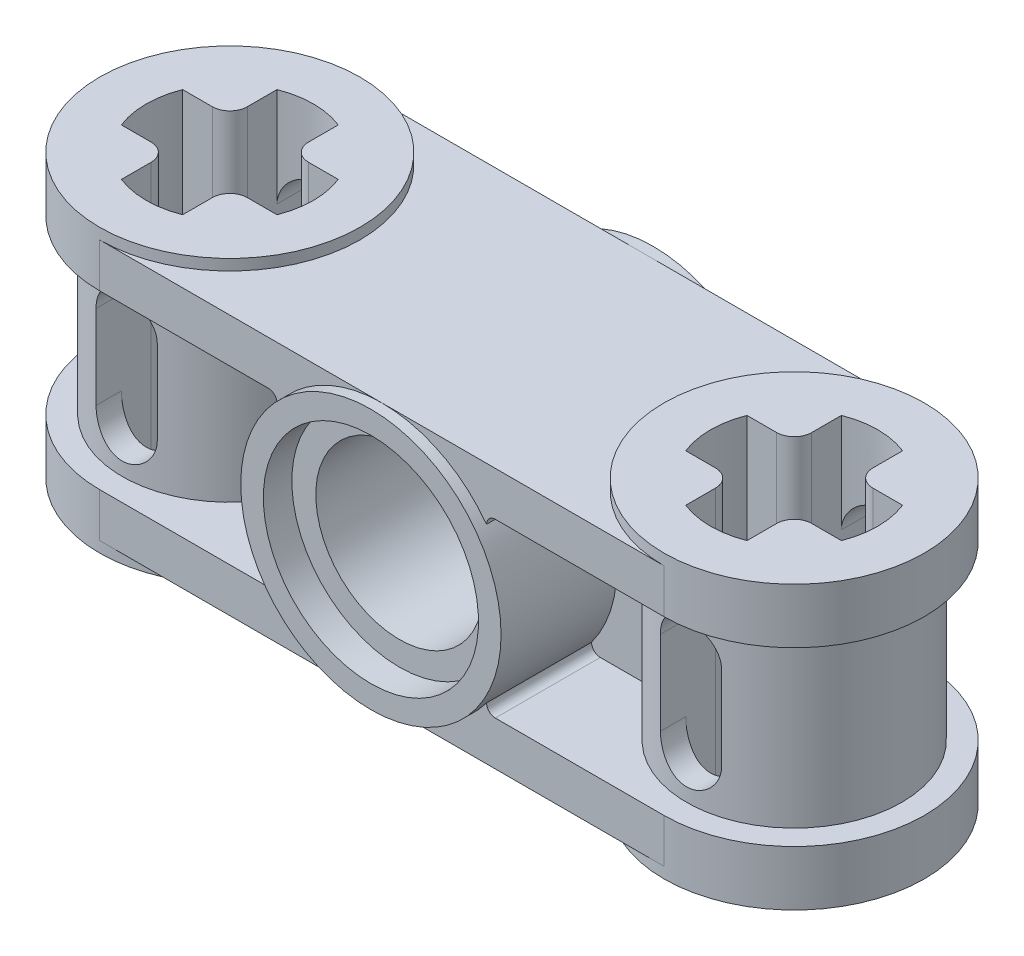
ISO-10303-21;
HEADER;
FILE_DESCRIPTION(('STEP AP214'),'2;1');
FILE_NAME('part.step','',(''),(''),'','','');
FILE_SCHEMA(('AUTOMOTIVE_DESIGN { 1 0 10303 214 1 1 1 1 }'));
ENDSEC;
DATA;
#1=APPLICATION_CONTEXT('core data for automotive mechanical design processes');
#2=APPLICATION_PROTOCOL_DEFINITION('international standard','automotive_design',2000,#1);
#3=PRODUCT_CONTEXT('',#1,'mechanical');
#4=PRODUCT('Part','Part','',(#3));
#5=PRODUCT_RELATED_PRODUCT_CATEGORY('part','',(#4));
#6=PRODUCT_DEFINITION_FORMATION('','',#4);
#7=PRODUCT_DEFINITION_CONTEXT('part definition',#1,'design');
#8=PRODUCT_DEFINITION('design','',#6,#7);
#9=PRODUCT_DEFINITION_SHAPE('','',#8);
#10=(LENGTH_UNIT() NAMED_UNIT(*) SI_UNIT(.MILLI.,.METRE.));
#11=(NAMED_UNIT(*) PLANE_ANGLE_UNIT() SI_UNIT($,.RADIAN.));
#12=(NAMED_UNIT(*) SI_UNIT($,.STERADIAN.) SOLID_ANGLE_UNIT());
#13=UNCERTAINTY_MEASURE_WITH_UNIT(LENGTH_MEASURE(1.E-05),#10,'distance_accuracy_value','');
#14=(GEOMETRIC_REPRESENTATION_CONTEXT(3) GLOBAL_UNCERTAINTY_ASSIGNED_CONTEXT((#13)) GLOBAL_UNIT_ASSIGNED_CONTEXT((#10,
#11,#12)) REPRESENTATION_CONTEXT('',''));
#15=CARTESIAN_POINT('',(0.,0.,0.));
#16=DIRECTION('',(0.,0.,1.));
#17=DIRECTION('',(1.,0.,0.));
#18=AXIS2_PLACEMENT_3D('',#15,#16,#17);
#19=CARTESIAN_POINT('',(-3.198,0.5180206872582,-3.2175));
#20=DIRECTION('',(0.,0.,1.));
#21=DIRECTION('',(1.,0.,0.));
#22=AXIS2_PLACEMENT_3D('',#19,#20,#21);
#23=PLANE('',#22);
#24=CARTESIAN_POINT('',(0.,3.72,-3.21749999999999));
#25=DIRECTION('',(0.,0.,1.));
#26=DIRECTION('',(1.,0.,0.));
#27=AXIS2_PLACEMENT_3D('',#24,#25,#26);
#28=CIRCLE('',#27,2.39);
#29=CARTESIAN_POINT('',(2.39,3.72,-3.21749999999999));
#30=VERTEX_POINT('',#29);
#31=EDGE_CURVE('E1004',#30,#30,#28,.F.);
#32=ORIENTED_EDGE('',*,*,#31,.F.);
#33=EDGE_LOOP('',(#32));
#34=FACE_BOUND('',#33,.T.);
#35=CARTESIAN_POINT('',(0.,3.72,-3.21750000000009));
#36=DIRECTION('',(0.,0.,1.));
#37=DIRECTION('',(1.,0.,0.));
#38=AXIS2_PLACEMENT_3D('',#35,#36,#37);
#39=CIRCLE('',#38,3.075);
#40=CARTESIAN_POINT('',(3.075,3.72,-3.21750000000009));
#41=VERTEX_POINT('',#40);
#42=EDGE_CURVE('E537',#41,#41,#39,.T.);
#43=ORIENTED_EDGE('',*,*,#42,.F.);
#44=EDGE_LOOP('',(#43));
#45=FACE_BOUND('',#44,.T.);
#46=ADVANCED_FACE('F16',(#34,#45),#23,.F.);
#47=CARTESIAN_POINT('',(-6.69,-0.312499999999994,-1.375));
#48=DIRECTION('',(0.,1.,0.));
#49=DIRECTION('',(0.,0.,1.));
#50=AXIS2_PLACEMENT_3D('',#47,#48,#49);
#51=CYLINDRICAL_SURFACE('',#50,0.499999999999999);
#52=CARTESIAN_POINT('',(-6.69,-0.312499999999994,-1.375));
#53=DIRECTION('',(0.,1.,0.));
#54=DIRECTION('',(0.,0.,1.));
#55=AXIS2_PLACEMENT_3D('',#52,#53,#54);
#56=CIRCLE('',#55,0.499999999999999);
#57=CARTESIAN_POINT('',(-6.69,-0.312499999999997,-0.875));
#58=VERTEX_POINT('',#57);
#59=CARTESIAN_POINT('',(-7.19,-0.312499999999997,-1.37499999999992));
#60=VERTEX_POINT('',#59);
#61=EDGE_CURVE('E20',#58,#60,#56,.F.);
#62=ORIENTED_EDGE('',*,*,#61,.F.);
#63=DIRECTION('',(0.,1.,0.));
#64=VECTOR('',#63,1.);
#65=CARTESIAN_POINT('',(-6.69000000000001,3.72,-0.875));
#66=LINE('',#65,#64);
#67=CARTESIAN_POINT('',(-6.69,7.75249999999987,-0.875));
#68=VERTEX_POINT('',#67);
#69=EDGE_CURVE('E496',#58,#68,#66,.T.);
#70=ORIENTED_EDGE('',*,*,#69,.T.);
#71=CARTESIAN_POINT('',(-6.69,7.75249999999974,-1.375));
#72=DIRECTION('',(0.,1.,0.));
#73=DIRECTION('',(0.,0.,1.));
#74=AXIS2_PLACEMENT_3D('',#71,#72,#73);
#75=CIRCLE('',#74,0.499999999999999);
#76=CARTESIAN_POINT('',(-7.19,7.75249999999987,-1.37499999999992));
#77=VERTEX_POINT('',#76);
#78=EDGE_CURVE('E1054',#77,#68,#75,.T.);
#79=ORIENTED_EDGE('',*,*,#78,.F.);
#80=DIRECTION('',(0.,-1.,0.));
#81=VECTOR('',#80,1.);
#82=CARTESIAN_POINT('',(-7.19,3.72,-1.37499999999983));
#83=LINE('',#82,#81);
#84=EDGE_CURVE('E499',#77,#60,#83,.T.);
#85=ORIENTED_EDGE('',*,*,#84,.T.);
#86=EDGE_LOOP('',(#62,#70,#79,#85));
#87=FACE_BOUND('',#86,.T.);
#88=ADVANCED_FACE('F494',(#87),#51,.T.);
#89=CARTESIAN_POINT('',(-9.44,-0.312499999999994,-1.375));
#90=DIRECTION('',(0.,1.,0.));
#91=DIRECTION('',(0.,0.,1.));
#92=AXIS2_PLACEMENT_3D('',#89,#90,#91);
#93=CYLINDRICAL_SURFACE('',#92,0.5);
#94=CARTESIAN_POINT('',(-9.44,-0.312499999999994,-1.375));
#95=DIRECTION('',(0.,1.,0.));
#96=DIRECTION('',(0.,0.,1.));
#97=AXIS2_PLACEMENT_3D('',#94,#95,#96);
#98=CIRCLE('',#97,0.5);
#99=CARTESIAN_POINT('',(-8.94,-0.312499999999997,-1.375));
#100=VERTEX_POINT('',#99);
#101=CARTESIAN_POINT('',(-9.44000000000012,-0.312499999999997,-0.875));
#102=VERTEX_POINT('',#101);
#103=EDGE_CURVE('E502',#100,#102,#98,.F.);
#104=ORIENTED_EDGE('',*,*,#103,.F.);
#105=DIRECTION('',(0.,1.,0.));
#106=VECTOR('',#105,1.);
#107=CARTESIAN_POINT('',(-8.94,3.72,-1.375));
#108=LINE('',#107,#106);
#109=CARTESIAN_POINT('',(-8.94,7.75249999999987,-1.375));
#110=VERTEX_POINT('',#109);
#111=EDGE_CURVE('E994',#100,#110,#108,.T.);
#112=ORIENTED_EDGE('',*,*,#111,.T.);
#113=CARTESIAN_POINT('',(-9.44,7.75249999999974,-1.375));
#114=DIRECTION('',(0.,1.,0.));
#115=DIRECTION('',(0.,0.,1.));
#116=AXIS2_PLACEMENT_3D('',#113,#114,#115);
#117=CIRCLE('',#116,0.5);
#118=CARTESIAN_POINT('',(-9.44000000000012,7.75249999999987,-0.875));
#119=VERTEX_POINT('',#118);
#120=EDGE_CURVE('E1055',#119,#110,#117,.T.);
#121=ORIENTED_EDGE('',*,*,#120,.F.);
#122=DIRECTION('',(0.,-1.,0.));
#123=VECTOR('',#122,1.);
#124=CARTESIAN_POINT('',(-9.44000000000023,3.72,-0.875));
#125=LINE('',#124,#123);
#126=EDGE_CURVE('E533',#119,#102,#125,.T.);
#127=ORIENTED_EDGE('',*,*,#126,.T.);
#128=EDGE_LOOP('',(#104,#112,#121,#127));
#129=FACE_BOUND('',#128,.T.);
#130=ADVANCED_FACE('F1074',(#129),#93,.T.);
#131=CARTESIAN_POINT('',(-8.065,4.90300500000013,0.));
#132=DIRECTION('',(0.,1.,0.));
#133=DIRECTION('',(0.,0.,1.));
#134=AXIS2_PLACEMENT_3D('',#131,#132,#133);
#135=CYLINDRICAL_SURFACE('',#134,2.39);
#136=CARTESIAN_POINT('',(-8.065,7.75249999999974,0.));
#137=DIRECTION('',(0.,1.,0.));
#138=DIRECTION('',(0.,0.,1.));
#139=AXIS2_PLACEMENT_3D('',#136,#137,#138);
#140=CIRCLE('',#139,2.39);
#141=CARTESIAN_POINT('',(-8.94,7.75249999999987,-2.22406722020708));
#142=VERTEX_POINT('',#141);
#143=CARTESIAN_POINT('',(-7.19,7.75249999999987,-2.22406722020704));
#144=VERTEX_POINT('',#143);
#145=EDGE_CURVE('E1045',#142,#144,#140,.F.);
#146=ORIENTED_EDGE('',*,*,#145,.F.);
#147=DIRECTION('',(0.,-1.,0.));
#148=VECTOR('',#147,1.);
#149=CARTESIAN_POINT('',(-8.94,3.72,-2.224067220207));
#150=LINE('',#149,#148);
#151=CARTESIAN_POINT('',(-8.94,4.92000000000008,-2.22406722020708));
#152=VERTEX_POINT('',#151);
#153=EDGE_CURVE('E985',#142,#152,#150,.T.);
#154=ORIENTED_EDGE('',*,*,#153,.T.);
#155=CARTESIAN_POINT('',(-7.19,4.92000000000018,-2.22406722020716));
#156=CARTESIAN_POINT('',(-7.18999917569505,4.94372382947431,-2.22406451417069));
#157=CARTESIAN_POINT('',(-7.19096545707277,4.96743536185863,-2.22444728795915));
#158=CARTESIAN_POINT('',(-7.19481387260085,5.01467112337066,-2.22595654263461));
#159=CARTESIAN_POINT('',(-7.19769539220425,5.03819541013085,-2.22708278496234));
#160=CARTESIAN_POINT('',(-7.20915340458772,5.10806623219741,-2.23152352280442));
#161=CARTESIAN_POINT('',(-7.22054372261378,5.15391659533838,-2.23590049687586));
#162=CARTESIAN_POINT('',(-7.25039608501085,5.24287714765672,-2.24694673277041));
#163=CARTESIAN_POINT('',(-7.2688526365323,5.28598943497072,-2.25361421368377));
#164=CARTESIAN_POINT('',(-7.3122684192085,5.36854970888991,-2.26848419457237));
#165=CARTESIAN_POINT('',(-7.33723267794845,5.40799483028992,-2.27668787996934));
#166=CARTESIAN_POINT('',(-7.39420861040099,5.48392603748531,-2.2941364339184));
#167=CARTESIAN_POINT('',(-7.42647605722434,5.52021338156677,-2.3034108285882));
#168=CARTESIAN_POINT('',(-7.49659971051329,5.58700163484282,-2.3217090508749));
#169=CARTESIAN_POINT('',(-7.53445697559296,5.61750144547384,-2.33073283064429));
#170=CARTESIAN_POINT('',(-7.616190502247,5.67279887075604,-2.3478642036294));
#171=CARTESIAN_POINT('',(-7.66022145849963,5.69738096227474,-2.3559328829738));
#172=CARTESIAN_POINT('',(-7.75213979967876,5.73870632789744,-2.36988922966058));
#173=CARTESIAN_POINT('',(-7.8000257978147,5.75545240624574,-2.37577767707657));
#174=CARTESIAN_POINT('',(-7.89619752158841,5.77993609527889,-2.38449983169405));
#175=CARTESIAN_POINT('',(-7.94438507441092,5.78801716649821,-2.38744964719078));
#176=CARTESIAN_POINT('',(-8.04151746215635,5.79604014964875,-2.39037788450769));
#177=CARTESIAN_POINT('',(-8.09046207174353,5.79598443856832,-2.39035717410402));
#178=CARTESIAN_POINT('',(-8.18526293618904,5.78793911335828,-2.38742151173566));
#179=CARTESIAN_POINT('',(-8.23115593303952,5.78032403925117,-2.38464319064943));
#180=CARTESIAN_POINT('',(-8.32096021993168,5.75800394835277,-2.37668204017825));
#181=CARTESIAN_POINT('',(-8.36487139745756,5.74329852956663,-2.37149907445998));
#182=CARTESIAN_POINT('',(-8.45021063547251,5.70703158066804,-2.3591523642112));
#183=CARTESIAN_POINT('',(-8.49159416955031,5.68537494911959,-2.35196133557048));
#184=CARTESIAN_POINT('',(-8.57024057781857,5.63590287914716,-2.33633089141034));
#185=CARTESIAN_POINT('',(-8.6075021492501,5.60808550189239,-2.32789108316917));
#186=CARTESIAN_POINT('',(-8.67905606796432,5.54526128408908,-2.31008015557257));
#187=CARTESIAN_POINT('',(-8.71306574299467,5.50993932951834,-2.30068334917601));
#188=CARTESIAN_POINT('',(-8.7747873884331,5.43402392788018,-2.28239802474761));
#189=CARTESIAN_POINT('',(-8.80249699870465,5.39342851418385,-2.27350969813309));
#190=CARTESIAN_POINT('',(-8.8513433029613,5.30704332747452,-2.25708751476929));
#191=CARTESIAN_POINT('',(-8.87233136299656,5.2611631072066,-2.24958566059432));
#192=CARTESIAN_POINT('',(-8.90615549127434,5.1661963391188,-2.23716049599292));
#193=CARTESIAN_POINT('',(-8.91900504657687,5.11711524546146,-2.23223292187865));
#194=CARTESIAN_POINT('',(-8.93167106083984,5.04294908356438,-2.22732992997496));
#195=CARTESIAN_POINT('',(-8.93479190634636,5.01846842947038,-2.2261108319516));
#196=CARTESIAN_POINT('',(-8.93895568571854,4.96932986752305,-2.22447838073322));
#197=CARTESIAN_POINT('',(-8.94000074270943,4.94467216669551,-2.2240642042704));
#198=CARTESIAN_POINT('',(-8.94,4.92000000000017,-2.22406722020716));
#199=B_SPLINE_CURVE_WITH_KNOTS('',3,(#155,#156,#157,#158,#159,#160,#161,#162,#163,#164,#165,
#166,#167,#168,#169,#170,#171,#172,#173,#174,#175,#176,#177,#178,#179,#180,#181,#182,#183,#184,
#185,#186,#187,#188,#189,#190,#191,#192,#193,#194,#195,#196,#197,#198),.UNSPECIFIED.,.F.,.F.,(4,
2,2,2,2,2,2,2,2,2,2,2,2,2,2,2,2,2,2,2,2,4),(0.,0.0711248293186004,0.1422268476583,
0.283821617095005,0.425306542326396,0.566901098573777,0.714552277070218,0.862231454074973,
1.01467146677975,1.16705688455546,1.31314929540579,1.45919902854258,1.59835639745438,
1.73752165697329,1.87867841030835,2.01987964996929,2.16897912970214,2.31813437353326,
2.47039067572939,2.62239399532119,2.69643257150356,2.7703953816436),.UNSPECIFIED.);
#200=CARTESIAN_POINT('',(-7.19,4.92000000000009,-2.22406722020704));
#201=VERTEX_POINT('',#200);
#202=EDGE_CURVE('E513',#201,#152,#199,.T.);
#203=ORIENTED_EDGE('',*,*,#202,.F.);
#204=DIRECTION('',(0.,1.,0.));
#205=VECTOR('',#204,1.);
#206=CARTESIAN_POINT('',(-7.19,3.72,-2.22406722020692));
#207=LINE('',#206,#205);
#208=EDGE_CURVE('E526',#201,#144,#207,.T.);
#209=ORIENTED_EDGE('',*,*,#208,.T.);
#210=EDGE_LOOP('',(#146,#154,#203,#209));
#211=FACE_BOUND('',#210,.T.);
#212=ADVANCED_FACE('F1044',(#211),#135,.F.);
#213=CARTESIAN_POINT('',(-9.44,-0.312499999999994,1.375));
#214=DIRECTION('',(0.,1.,0.));
#215=DIRECTION('',(0.,0.,1.));
#216=AXIS2_PLACEMENT_3D('',#213,#214,#215);
#217=CYLINDRICAL_SURFACE('',#216,0.5);
#218=CARTESIAN_POINT('',(-9.44,-0.312499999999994,1.375));
#219=DIRECTION('',(0.,1.,0.));
#220=DIRECTION('',(0.,0.,1.));
#221=AXIS2_PLACEMENT_3D('',#218,#219,#220);
#222=CIRCLE('',#221,0.5);
#223=CARTESIAN_POINT('',(-9.44000000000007,-0.312499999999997,0.875));
#224=VERTEX_POINT('',#223);
#225=CARTESIAN_POINT('',(-8.94,-0.312499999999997,1.375));
#226=VERTEX_POINT('',#225);
#227=EDGE_CURVE('E1094',#224,#226,#222,.F.);
#228=ORIENTED_EDGE('',*,*,#227,.F.);
#229=DIRECTION('',(0.,1.,0.));
#230=VECTOR('',#229,1.);
#231=CARTESIAN_POINT('',(-9.44000000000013,3.72,0.875));
#232=LINE('',#231,#230);
#233=CARTESIAN_POINT('',(-9.44000000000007,7.75249999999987,0.875));
#234=VERTEX_POINT('',#233);
#235=EDGE_CURVE('E538',#224,#234,#232,.T.);
#236=ORIENTED_EDGE('',*,*,#235,.T.);
#237=CARTESIAN_POINT('',(-9.44,7.75249999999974,1.375));
#238=DIRECTION('',(0.,1.,0.));
#239=DIRECTION('',(0.,0.,1.));
#240=AXIS2_PLACEMENT_3D('',#237,#238,#239);
#241=CIRCLE('',#240,0.5);
#242=CARTESIAN_POINT('',(-8.94,7.75249999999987,1.375));
#243=VERTEX_POINT('',#242);
#244=EDGE_CURVE('E1083',#243,#234,#241,.T.);
#245=ORIENTED_EDGE('',*,*,#244,.F.);
#246=DIRECTION('',(0.,-1.,0.));
#247=VECTOR('',#246,1.);
#248=CARTESIAN_POINT('',(-8.94,3.72,1.375));
#249=LINE('',#248,#247);
#250=EDGE_CURVE('E987',#243,#226,#249,.T.);
#251=ORIENTED_EDGE('',*,*,#250,.T.);
#252=EDGE_LOOP('',(#228,#236,#245,#251));
#253=FACE_BOUND('',#252,.T.);
#254=ADVANCED_FACE('F1109',(#253),#217,.T.);
#255=CARTESIAN_POINT('',(-8.065,4.90300500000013,0.));
#256=DIRECTION('',(0.,1.,0.));
#257=DIRECTION('',(0.,0.,1.));
#258=AXIS2_PLACEMENT_3D('',#255,#256,#257);
#259=CYLINDRICAL_SURFACE('',#258,2.39);
#260=CARTESIAN_POINT('',(-8.065,7.75249999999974,0.));
#261=DIRECTION('',(0.,1.,0.));
#262=DIRECTION('',(0.,0.,1.));
#263=AXIS2_PLACEMENT_3D('',#260,#261,#262);
#264=CIRCLE('',#263,2.39);
#265=CARTESIAN_POINT('',(-7.19,7.75249999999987,2.22406722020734));
#266=VERTEX_POINT('',#265);
#267=CARTESIAN_POINT('',(-8.94,7.75249999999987,2.22406722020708));
#268=VERTEX_POINT('',#267);
#269=EDGE_CURVE('E518',#266,#268,#264,.F.);
#270=ORIENTED_EDGE('',*,*,#269,.F.);
#271=DIRECTION('',(0.,-1.,0.));
#272=VECTOR('',#271,1.);
#273=CARTESIAN_POINT('',(-7.19,3.72,2.22406722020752));
#274=LINE('',#273,#272);
#275=CARTESIAN_POINT('',(-7.19,4.92000000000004,2.22406722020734));
#276=VERTEX_POINT('',#275);
#277=EDGE_CURVE('E948',#266,#276,#274,.T.);
#278=ORIENTED_EDGE('',*,*,#277,.T.);
#279=CARTESIAN_POINT('',(-8.94,4.92000000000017,2.22406722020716));
#280=CARTESIAN_POINT('',(-8.94000082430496,4.94372382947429,2.22406451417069));
#281=CARTESIAN_POINT('',(-8.93903454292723,4.96743536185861,2.22444728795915));
#282=CARTESIAN_POINT('',(-8.93518612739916,5.01467112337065,2.22595654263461));
#283=CARTESIAN_POINT('',(-8.93230460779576,5.03819541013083,2.22708278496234));
#284=CARTESIAN_POINT('',(-8.92084659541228,5.10806623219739,2.23152352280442));
#285=CARTESIAN_POINT('',(-8.90945627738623,5.15391659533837,2.23590049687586));
#286=CARTESIAN_POINT('',(-8.87960391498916,5.2428771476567,2.2469467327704));
#287=CARTESIAN_POINT('',(-8.86114736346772,5.28598943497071,2.25361421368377));
#288=CARTESIAN_POINT('',(-8.81773158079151,5.3685497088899,2.26848419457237));
#289=CARTESIAN_POINT('',(-8.79276732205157,5.4079948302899,2.27668787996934));
#290=CARTESIAN_POINT('',(-8.73579138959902,5.4839260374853,2.2941364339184));
#291=CARTESIAN_POINT('',(-8.70352394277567,5.52021338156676,2.30341082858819));
#292=CARTESIAN_POINT('',(-8.63340028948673,5.58700163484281,2.3217090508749));
#293=CARTESIAN_POINT('',(-8.59554302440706,5.61750144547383,2.33073283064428));
#294=CARTESIAN_POINT('',(-8.51380949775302,5.67279887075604,2.3478642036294));
#295=CARTESIAN_POINT('',(-8.46977854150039,5.69738096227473,2.3559328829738));
#296=CARTESIAN_POINT('',(-8.37786020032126,5.73870632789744,2.36988922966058));
#297=CARTESIAN_POINT('',(-8.32997420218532,5.75545240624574,2.37577767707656));
#298=CARTESIAN_POINT('',(-8.23380247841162,5.77993609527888,2.38449983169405));
#299=CARTESIAN_POINT('',(-8.18561492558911,5.7880171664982,2.38744964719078));
#300=CARTESIAN_POINT('',(-8.08848253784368,5.79604014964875,2.39037788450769));
#301=CARTESIAN_POINT('',(-8.03953792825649,5.79598443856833,2.39035717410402));
#302=CARTESIAN_POINT('',(-7.94473706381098,5.78793911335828,2.38742151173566));
#303=CARTESIAN_POINT('',(-7.8988440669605,5.78032403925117,2.38464319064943));
#304=CARTESIAN_POINT('',(-7.80903978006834,5.75800394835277,2.37668204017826));
#305=CARTESIAN_POINT('',(-7.76512860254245,5.74329852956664,2.37149907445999));
#306=CARTESIAN_POINT('',(-7.6797893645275,5.70703158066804,2.3591523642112));
#307=CARTESIAN_POINT('',(-7.63840583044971,5.68537494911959,2.35196133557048));
#308=CARTESIAN_POINT('',(-7.55975942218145,5.63590287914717,2.33633089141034));
#309=CARTESIAN_POINT('',(-7.52249785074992,5.6080855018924,2.32789108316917));
#310=CARTESIAN_POINT('',(-7.4509439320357,5.54526128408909,2.31008015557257));
#311=CARTESIAN_POINT('',(-7.41693425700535,5.50993932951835,2.30068334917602));
#312=CARTESIAN_POINT('',(-7.35521261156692,5.43402392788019,2.28239802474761));
#313=CARTESIAN_POINT('',(-7.32750300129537,5.39342851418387,2.27350969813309));
#314=CARTESIAN_POINT('',(-7.27865669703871,5.30704332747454,2.2570875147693));
#315=CARTESIAN_POINT('',(-7.25766863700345,5.26116310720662,2.24958566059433));
#316=CARTESIAN_POINT('',(-7.22384450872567,5.16619633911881,2.23716049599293));
#317=CARTESIAN_POINT('',(-7.21099495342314,5.11711524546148,2.23223292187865));
#318=CARTESIAN_POINT('',(-7.19832893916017,5.04294908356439,2.22732992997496));
#319=CARTESIAN_POINT('',(-7.19520809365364,5.01846842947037,2.2261108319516));
#320=CARTESIAN_POINT('',(-7.19104431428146,4.96932986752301,2.22447838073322));
#321=CARTESIAN_POINT('',(-7.18999925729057,4.94467216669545,2.2240642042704));
#322=CARTESIAN_POINT('',(-7.19,4.92000000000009,2.22406722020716));
#323=B_SPLINE_CURVE_WITH_KNOTS('',3,(#279,#280,#281,#282,#283,#284,#285,#286,#287,#288,#289,
#290,#291,#292,#293,#294,#295,#296,#297,#298,#299,#300,#301,#302,#303,#304,#305,#306,#307,#308,
#309,#310,#311,#312,#313,#314,#315,#316,#317,#318,#319,#320,#321,#322),.UNSPECIFIED.,.F.,.F.,(4,
2,2,2,2,2,2,2,2,2,2,2,2,2,2,2,2,2,2,2,2,4),(0.,0.0711248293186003,0.1422268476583,
0.283821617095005,0.425306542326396,0.566901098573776,0.714552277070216,0.86223145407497,
1.01467146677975,1.16705688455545,1.31314929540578,1.45919902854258,1.59835639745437,
1.73752165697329,1.87867841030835,2.01987964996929,2.16897912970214,2.31813437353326,
2.47039067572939,2.62239399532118,2.6964325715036,2.77039538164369),.UNSPECIFIED.);
#324=CARTESIAN_POINT('',(-8.94,4.92000000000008,2.22406722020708));
#325=VERTEX_POINT('',#324);
#326=EDGE_CURVE('E964',#325,#276,#323,.T.);
#327=ORIENTED_EDGE('',*,*,#326,.F.);
#328=DIRECTION('',(0.,1.,0.));
#329=VECTOR('',#328,1.);
#330=CARTESIAN_POINT('',(-8.94,3.72,2.224067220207));
#331=LINE('',#330,#329);
#332=EDGE_CURVE('E963',#325,#268,#331,.T.);
#333=ORIENTED_EDGE('',*,*,#332,.T.);
#334=EDGE_LOOP('',(#270,#278,#327,#333));
#335=FACE_BOUND('',#334,.T.);
#336=ADVANCED_FACE('F1422',(#335),#259,.F.);
#337=CARTESIAN_POINT('',(-6.69,-0.312499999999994,1.375));
#338=DIRECTION('',(0.,1.,0.));
#339=DIRECTION('',(0.,0.,1.));
#340=AXIS2_PLACEMENT_3D('',#337,#338,#339);
#341=CYLINDRICAL_SURFACE('',#340,0.5);
#342=CARTESIAN_POINT('',(-6.69,-0.312499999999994,1.375));
#343=DIRECTION('',(0.,1.,0.));
#344=DIRECTION('',(0.,0.,1.));
#345=AXIS2_PLACEMENT_3D('',#342,#343,#344);
#346=CIRCLE('',#345,0.5);
#347=CARTESIAN_POINT('',(-7.19,-0.312499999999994,1.37500000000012));
#348=VERTEX_POINT('',#347);
#349=CARTESIAN_POINT('',(-6.68999999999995,-0.312499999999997,0.875));
#350=VERTEX_POINT('',#349);
#351=EDGE_CURVE('E1092',#348,#350,#346,.F.);
#352=ORIENTED_EDGE('',*,*,#351,.F.);
#353=DIRECTION('',(0.,1.,0.));
#354=VECTOR('',#353,1.);
#355=CARTESIAN_POINT('',(-7.19,3.72,1.37500000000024));
#356=LINE('',#355,#354);
#357=CARTESIAN_POINT('',(-7.19,7.75249999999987,1.37500000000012));
#358=VERTEX_POINT('',#357);
#359=EDGE_CURVE('E988',#348,#358,#356,.T.);
#360=ORIENTED_EDGE('',*,*,#359,.T.);
#361=CARTESIAN_POINT('',(-6.69,7.75249999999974,1.375));
#362=DIRECTION('',(0.,1.,0.));
#363=DIRECTION('',(0.,0.,1.));
#364=AXIS2_PLACEMENT_3D('',#361,#362,#363);
#365=CIRCLE('',#364,0.5);
#366=CARTESIAN_POINT('',(-6.68999999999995,7.75249999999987,0.875));
#367=VERTEX_POINT('',#366);
#368=EDGE_CURVE('E522',#367,#358,#365,.T.);
#369=ORIENTED_EDGE('',*,*,#368,.F.);
#370=DIRECTION('',(0.,-1.,0.));
#371=VECTOR('',#370,1.);
#372=CARTESIAN_POINT('',(-6.6899999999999,3.72,0.875));
#373=LINE('',#372,#371);
#374=EDGE_CURVE('E528',#367,#350,#373,.T.);
#375=ORIENTED_EDGE('',*,*,#374,.T.);
#376=EDGE_LOOP('',(#352,#360,#369,#375));
#377=FACE_BOUND('',#376,.T.);
#378=ADVANCED_FACE('F1132',(#377),#341,.T.);
#379=CARTESIAN_POINT('',(0.,3.72,-3.21749999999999));
#380=DIRECTION('',(0.,0.,1.));
#381=DIRECTION('',(1.,0.,0.));
#382=AXIS2_PLACEMENT_3D('',#379,#380,#381);
#383=CYLINDRICAL_SURFACE('',#382,2.39);
#384=ORIENTED_EDGE('',*,*,#31,.T.);
#385=EDGE_LOOP('',(#384));
#386=FACE_BOUND('',#385,.T.);
#387=CARTESIAN_POINT('',(0.,3.72,3.2174999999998));
#388=DIRECTION('',(0.,0.,1.));
#389=DIRECTION('',(1.,0.,0.));
#390=AXIS2_PLACEMENT_3D('',#387,#388,#389);
#391=CIRCLE('',#390,2.39);
#392=CARTESIAN_POINT('',(2.39,3.72,3.2174999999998));
#393=VERTEX_POINT('',#392);
#394=EDGE_CURVE('E1457',#393,#393,#391,.F.);
#395=ORIENTED_EDGE('',*,*,#394,.F.);
#396=EDGE_LOOP('',(#395));
#397=FACE_BOUND('',#396,.T.);
#398=ADVANCED_FACE('F1499',(#386,#397),#383,.F.);
#399=CARTESIAN_POINT('',(-8.065,7.4399999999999,0.));
#400=DIRECTION('',(0.,1.,0.));
#401=DIRECTION('',(0.,0.,1.));
#402=AXIS2_PLACEMENT_3D('',#399,#400,#401);
#403=CYLINDRICAL_SURFACE('',#402,3.72);
#404=CARTESIAN_POINT('',(-8.065,7.75249999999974,0.));
#405=DIRECTION('',(0.,1.,0.));
#406=DIRECTION('',(0.,0.,1.));
#407=AXIS2_PLACEMENT_3D('',#404,#405,#406);
#408=CIRCLE('',#407,3.72);
#409=CARTESIAN_POINT('',(-8.065,7.75249999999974,3.72));
#410=VERTEX_POINT('',#409);
#411=EDGE_CURVE('E991',#410,#410,#408,.T.);
#412=ORIENTED_EDGE('',*,*,#411,.F.);
#413=EDGE_LOOP('',(#412));
#414=FACE_BOUND('',#413,.T.);
#415=CARTESIAN_POINT('',(-8.065,7.4399999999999,0.));
#416=DIRECTION('',(0.,1.,0.));
#417=DIRECTION('',(0.,0.,1.));
#418=AXIS2_PLACEMENT_3D('',#415,#416,#417);
#419=CIRCLE('',#418,3.72);
#420=CARTESIAN_POINT('',(-8.065,7.43999999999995,-3.72));
#421=VERTEX_POINT('',#420);
#422=CARTESIAN_POINT('',(-8.06499999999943,7.43999999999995,3.72));
#423=VERTEX_POINT('',#422);
#424=EDGE_CURVE('E1392',#421,#423,#419,.F.);
#425=ORIENTED_EDGE('',*,*,#424,.F.);
#426=DIRECTION('',(0.,1.,0.));
#427=VECTOR('',#426,1.);
#428=CARTESIAN_POINT('',(-8.065,3.72,-3.72));
#429=LINE('',#428,#427);
#430=CARTESIAN_POINT('',(-8.065,6.17982889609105,-3.72));
#431=VERTEX_POINT('',#430);
#432=EDGE_CURVE('E998',#431,#421,#429,.T.);
#433=ORIENTED_EDGE('',*,*,#432,.F.);
#434=CARTESIAN_POINT('',(-8.065,6.17982889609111,0.));
#435=DIRECTION('',(0.,1.,0.));
#436=DIRECTION('',(0.,0.,1.));
#437=AXIS2_PLACEMENT_3D('',#434,#435,#436);
#438=CIRCLE('',#437,3.72);
#439=CARTESIAN_POINT('',(-8.06499999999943,6.17982889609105,3.72));
#440=VERTEX_POINT('',#439);
#441=EDGE_CURVE('E1405',#440,#431,#438,.F.);
#442=ORIENTED_EDGE('',*,*,#441,.F.);
#443=DIRECTION('',(0.,-1.,0.));
#444=VECTOR('',#443,1.);
#445=CARTESIAN_POINT('',(-8.06499999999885,3.72,3.72));
#446=LINE('',#445,#444);
#447=EDGE_CURVE('E1002',#423,#440,#446,.T.);
#448=ORIENTED_EDGE('',*,*,#447,.F.);
#449=EDGE_LOOP('',(#425,#433,#442,#448));
#450=FACE_BOUND('',#449,.T.);
#451=ADVANCED_FACE('F1502',(#414,#450),#403,.T.);
#452=CARTESIAN_POINT('',(0.,3.72,-4.03249999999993));
#453=DIRECTION('',(0.,0.,1.));
#454=DIRECTION('',(1.,0.,0.));
#455=AXIS2_PLACEMENT_3D('',#452,#453,#454);
#456=CYLINDRICAL_SURFACE('',#455,3.075);
#457=ORIENTED_EDGE('',*,*,#42,.T.);
#458=EDGE_LOOP('',(#457));
#459=FACE_BOUND('',#458,.T.);
#460=CARTESIAN_POINT('',(0.,3.72,-4.03249999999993));
#461=DIRECTION('',(0.,0.,1.));
#462=DIRECTION('',(1.,0.,0.));
#463=AXIS2_PLACEMENT_3D('',#460,#461,#462);
#464=CIRCLE('',#463,3.075);
#465=CARTESIAN_POINT('',(3.075,3.72,-4.03249999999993));
#466=VERTEX_POINT('',#465);
#467=EDGE_CURVE('E907',#466,#466,#464,.F.);
#468=ORIENTED_EDGE('',*,*,#467,.T.);
#469=EDGE_LOOP('',(#468));
#470=FACE_BOUND('',#469,.T.);
#471=ADVANCED_FACE('F1505',(#459,#470),#456,.F.);
#472=CARTESIAN_POINT('',(-9.408578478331,-0.4738,-0.875));
#473=DIRECTION('',(0.,0.,-1.));
#474=DIRECTION('',(-1.,0.,0.));
#475=AXIS2_PLACEMENT_3D('',#472,#473,#474);
#476=PLANE('',#475);
#477=DIRECTION('',(0.,1.,0.));
#478=VECTOR('',#477,1.);
#479=CARTESIAN_POINT('',(-10.2890672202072,3.72,-0.874999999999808));
#480=LINE('',#479,#478);
#481=CARTESIAN_POINT('',(-10.2890672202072,-0.312499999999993,-0.874999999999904));
#482=VERTEX_POINT('',#481);
#483=CARTESIAN_POINT('',(-10.2890672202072,7.75249999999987,-0.874999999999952));
#484=VERTEX_POINT('',#483);
#485=EDGE_CURVE('E904',#482,#484,#480,.T.);
#486=ORIENTED_EDGE('',*,*,#485,.F.);
#487=DIRECTION('',(-1.,0.,0.));
#488=VECTOR('',#487,1.);
#489=CARTESIAN_POINT('',(-9.8645336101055,-0.3125,-0.875));
#490=LINE('',#489,#488);
#491=EDGE_CURVE('E536',#102,#482,#490,.T.);
#492=ORIENTED_EDGE('',*,*,#491,.F.);
#493=ORIENTED_EDGE('',*,*,#126,.F.);
#494=DIRECTION('',(1.,0.,0.));
#495=VECTOR('',#494,1.);
#496=CARTESIAN_POINT('',(0.,7.7525,-0.875));
#497=LINE('',#496,#495);
#498=EDGE_CURVE('E1077',#484,#119,#497,.T.);
#499=ORIENTED_EDGE('',*,*,#498,.F.);
#500=EDGE_LOOP('',(#486,#492,#493,#499));
#501=FACE_BOUND('',#500,.T.);
#502=ADVANCED_FACE('F1099',(#501),#476,.F.);
#503=CARTESIAN_POINT('',(-10.32048874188,-0.4738,0.875));
#504=DIRECTION('',(0.,0.,1.));
#505=DIRECTION('',(1.,0.,0.));
#506=AXIS2_PLACEMENT_3D('',#503,#504,#505);
#507=PLANE('',#506);
#508=DIRECTION('',(0.,-1.,0.));
#509=VECTOR('',#508,1.);
#510=CARTESIAN_POINT('',(-10.2890672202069,3.72,0.875000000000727));
#511=LINE('',#510,#509);
#512=CARTESIAN_POINT('',(-10.289067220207,7.75249999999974,0.875000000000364));
#513=VERTEX_POINT('',#512);
#514=CARTESIAN_POINT('',(-10.289067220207,-0.312499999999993,0.875000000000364));
#515=VERTEX_POINT('',#514);
#516=EDGE_CURVE('E900',#513,#515,#511,.T.);
#517=ORIENTED_EDGE('',*,*,#516,.F.);
#518=DIRECTION('',(-1.,0.,0.));
#519=VECTOR('',#518,1.);
#520=CARTESIAN_POINT('',(0.,7.7525,0.875));
#521=LINE('',#520,#519);
#522=EDGE_CURVE('E1079',#234,#513,#521,.T.);
#523=ORIENTED_EDGE('',*,*,#522,.F.);
#524=ORIENTED_EDGE('',*,*,#235,.F.);
#525=DIRECTION('',(1.,0.,0.));
#526=VECTOR('',#525,1.);
#527=CARTESIAN_POINT('',(-9.8645336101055,-0.3125,0.875));
#528=LINE('',#527,#526);
#529=EDGE_CURVE('E532',#515,#224,#528,.T.);
#530=ORIENTED_EDGE('',*,*,#529,.F.);
#531=EDGE_LOOP('',(#517,#523,#524,#530));
#532=FACE_BOUND('',#531,.T.);
#533=ADVANCED_FACE('F1107',(#532),#507,.F.);
#534=CARTESIAN_POINT('',(-6.721421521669,-0.4738,0.875));
#535=DIRECTION('',(0.,0.,1.));
#536=DIRECTION('',(1.,0.,0.));
#537=AXIS2_PLACEMENT_3D('',#534,#535,#536);
#538=PLANE('',#537);
#539=DIRECTION('',(0.,1.,0.));
#540=VECTOR('',#539,1.);
#541=CARTESIAN_POINT('',(-5.84093277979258,3.72,0.874999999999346));
#542=LINE('',#541,#540);
#543=CARTESIAN_POINT('',(-5.84093277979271,-0.312499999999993,0.874999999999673));
#544=VERTEX_POINT('',#543);
#545=CARTESIAN_POINT('',(-5.84093277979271,7.75249999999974,0.874999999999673));
#546=VERTEX_POINT('',#545);
#547=EDGE_CURVE('E890',#544,#546,#542,.T.);
#548=ORIENTED_EDGE('',*,*,#547,.F.);
#549=DIRECTION('',(1.,0.,0.));
#550=VECTOR('',#549,1.);
#551=CARTESIAN_POINT('',(-6.2654663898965,-0.3125,0.875));
#552=LINE('',#551,#550);
#553=EDGE_CURVE('E531',#350,#544,#552,.T.);
#554=ORIENTED_EDGE('',*,*,#553,.F.);
#555=ORIENTED_EDGE('',*,*,#374,.F.);
#556=DIRECTION('',(-1.,0.,0.));
#557=VECTOR('',#556,1.);
#558=CARTESIAN_POINT('',(0.,7.7525,0.875));
#559=LINE('',#558,#557);
#560=EDGE_CURVE('E1135',#546,#367,#559,.T.);
#561=ORIENTED_EDGE('',*,*,#560,.F.);
#562=EDGE_LOOP('',(#548,#554,#555,#561));
#563=FACE_BOUND('',#562,.T.);
#564=ADVANCED_FACE('F1683',(#563),#538,.F.);
#565=CARTESIAN_POINT('',(-12.2564,7.7525,3.8688));
#566=DIRECTION('',(0.,1.,0.));
#567=DIRECTION('',(1.,0.,0.));
#568=AXIS2_PLACEMENT_3D('',#565,#566,#567);
#569=PLANE('',#568);
#570=ORIENTED_EDGE('',*,*,#269,.T.);
#571=DIRECTION('',(0.,0.,-1.));
#572=VECTOR('',#571,1.);
#573=CARTESIAN_POINT('',(-8.94,7.7525,0.));
#574=LINE('',#573,#572);
#575=EDGE_CURVE('E1028',#268,#243,#574,.T.);
#576=ORIENTED_EDGE('',*,*,#575,.T.);
#577=ORIENTED_EDGE('',*,*,#244,.T.);
#578=ORIENTED_EDGE('',*,*,#522,.T.);
#579=CARTESIAN_POINT('',(-8.065,7.75249999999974,0.));
#580=DIRECTION('',(0.,1.,0.));
#581=DIRECTION('',(0.,0.,1.));
#582=AXIS2_PLACEMENT_3D('',#579,#580,#581);
#583=CIRCLE('',#582,2.39);
#584=EDGE_CURVE('E903',#484,#513,#583,.T.);
#585=ORIENTED_EDGE('',*,*,#584,.F.);
#586=ORIENTED_EDGE('',*,*,#498,.T.);
#587=ORIENTED_EDGE('',*,*,#120,.T.);
#588=DIRECTION('',(0.,0.,-1.));
#589=VECTOR('',#588,1.);
#590=CARTESIAN_POINT('',(-8.94,7.7525,0.));
#591=LINE('',#590,#589);
#592=EDGE_CURVE('E1033',#110,#142,#591,.T.);
#593=ORIENTED_EDGE('',*,*,#592,.T.);
#594=ORIENTED_EDGE('',*,*,#145,.T.);
#595=DIRECTION('',(0.,0.,1.));
#596=VECTOR('',#595,1.);
#597=CARTESIAN_POINT('',(-7.19,7.7525,0.));
#598=LINE('',#597,#596);
#599=EDGE_CURVE('E1037',#144,#77,#598,.T.);
#600=ORIENTED_EDGE('',*,*,#599,.T.);
#601=ORIENTED_EDGE('',*,*,#78,.T.);
#602=DIRECTION('',(1.,0.,0.));
#603=VECTOR('',#602,1.);
#604=CARTESIAN_POINT('',(-6.2654663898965,7.7525,-0.875));
#605=LINE('',#604,#603);
#606=CARTESIAN_POINT('',(-5.84093277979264,7.75249999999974,-0.874999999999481));
#607=VERTEX_POINT('',#606);
#608=EDGE_CURVE('E514',#68,#607,#605,.T.);
#609=ORIENTED_EDGE('',*,*,#608,.T.);
#610=CARTESIAN_POINT('',(-8.065,7.75249999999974,0.));
#611=DIRECTION('',(0.,1.,0.));
#612=DIRECTION('',(0.,0.,1.));
#613=AXIS2_PLACEMENT_3D('',#610,#611,#612);
#614=CIRCLE('',#613,2.39);
#615=EDGE_CURVE('E889',#546,#607,#614,.T.);
#616=ORIENTED_EDGE('',*,*,#615,.F.);
#617=ORIENTED_EDGE('',*,*,#560,.T.);
#618=ORIENTED_EDGE('',*,*,#368,.T.);
#619=DIRECTION('',(0.,0.,1.));
#620=VECTOR('',#619,1.);
#621=CARTESIAN_POINT('',(-7.19,7.7525,0.));
#622=LINE('',#621,#620);
#623=EDGE_CURVE('E940',#358,#266,#622,.T.);
#624=ORIENTED_EDGE('',*,*,#623,.T.);
#625=EDGE_LOOP('',(#570,#576,#577,#578,#585,#586,#587,#593,#594,#600,#601,#609,#616,#617,#618,#624));
#626=FACE_BOUND('',#625,.T.);
#627=ORIENTED_EDGE('',*,*,#411,.T.);
#628=EDGE_LOOP('',(#627));
#629=FACE_BOUND('',#628,.T.);
#630=ADVANCED_FACE('F1049',(#626,#629),#569,.T.);
#631=CARTESIAN_POINT('',(-5.809511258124,-0.4738,-0.875));
#632=DIRECTION('',(0.,0.,-1.));
#633=DIRECTION('',(-1.,0.,0.));
#634=AXIS2_PLACEMENT_3D('',#631,#632,#633);
#635=PLANE('',#634);
#636=DIRECTION('',(0.,-1.,0.));
#637=VECTOR('',#636,1.);
#638=CARTESIAN_POINT('',(-5.84093277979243,3.72,-0.874999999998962));
#639=LINE('',#638,#637);
#640=CARTESIAN_POINT('',(-5.84093277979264,-0.312499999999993,-0.874999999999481));
#641=VERTEX_POINT('',#640);
#642=EDGE_CURVE('E887',#607,#641,#639,.T.);
#643=ORIENTED_EDGE('',*,*,#642,.F.);
#644=ORIENTED_EDGE('',*,*,#608,.F.);
#645=ORIENTED_EDGE('',*,*,#69,.F.);
#646=DIRECTION('',(-1.,0.,0.));
#647=VECTOR('',#646,1.);
#648=CARTESIAN_POINT('',(-6.2654663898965,-0.3125,-0.875));
#649=LINE('',#648,#647);
#650=EDGE_CURVE('E504',#641,#58,#649,.T.);
#651=ORIENTED_EDGE('',*,*,#650,.F.);
#652=EDGE_LOOP('',(#643,#644,#645,#651));
#653=FACE_BOUND('',#652,.T.);
#654=ADVANCED_FACE('F517',(#653),#635,.F.);
#655=CARTESIAN_POINT('',(-8.065,4.92,-3.08057398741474));
#656=DIRECTION('',(0.,0.,1.));
#657=DIRECTION('',(0.,-1.,0.));
#658=AXIS2_PLACEMENT_3D('',#655,#656,#657);
#659=CYLINDRICAL_SURFACE('',#658,0.875000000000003);
#660=ORIENTED_EDGE('',*,*,#202,.T.);
#661=DIRECTION('',(0.,0.,-1.));
#662=VECTOR('',#661,1.);
#663=CARTESIAN_POINT('',(-8.94,4.92,0.));
#664=LINE('',#663,#662);
#665=CARTESIAN_POINT('',(-8.93999999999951,4.92,-2.94788059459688));
#666=VERTEX_POINT('',#665);
#667=EDGE_CURVE('E983',#152,#666,#664,.T.);
#668=ORIENTED_EDGE('',*,*,#667,.T.);
#669=CARTESIAN_POINT('',(-8.94,4.91999999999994,-2.94788059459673));
#670=CARTESIAN_POINT('',(-8.94000043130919,4.94408183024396,-2.9478786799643));
#671=CARTESIAN_POINT('',(-8.93900519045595,4.9681515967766,-2.94817606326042));
#672=CARTESIAN_POINT('',(-8.93503866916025,5.01610863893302,-2.94934977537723));
#673=CARTESIAN_POINT('',(-8.93206779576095,5.03999595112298,-2.95022598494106));
#674=CARTESIAN_POINT('',(-8.92023957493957,5.11100846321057,-2.95368611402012));
#675=CARTESIAN_POINT('',(-8.90846639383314,5.15764171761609,-2.95710178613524));
#676=CARTESIAN_POINT('',(-8.87754195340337,5.24816421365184,-2.96574688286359));
#677=CARTESIAN_POINT('',(-8.85839265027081,5.29205417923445,-2.97097582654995));
#678=CARTESIAN_POINT('',(-8.8132886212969,5.37602725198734,-2.98265490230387));
#679=CARTESIAN_POINT('',(-8.78733116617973,5.416108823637,-2.98910552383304));
#680=CARTESIAN_POINT('',(-8.72856507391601,5.49243837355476,-3.00270489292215));
#681=CARTESIAN_POINT('',(-8.69559810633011,5.52856199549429,-3.00986728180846));
#682=CARTESIAN_POINT('',(-8.6240861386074,5.59485196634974,-3.02396660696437));
#683=CARTESIAN_POINT('',(-8.58554021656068,5.62501732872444,-3.03090350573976));
#684=CARTESIAN_POINT('',(-8.50308656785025,5.67906445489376,-3.0439244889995));
#685=CARTESIAN_POINT('',(-8.45909312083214,5.70282017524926,-3.04999050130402));
#686=CARTESIAN_POINT('',(-8.36753646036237,5.74254807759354,-3.06042742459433));
#687=CARTESIAN_POINT('',(-8.3199740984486,5.75852210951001,-3.06479873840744));
#688=CARTESIAN_POINT('',(-8.2239349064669,5.78182521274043,-3.07125707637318));
#689=CARTESIAN_POINT('',(-8.17551363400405,5.78936739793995,-3.07340031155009));
#690=CARTESIAN_POINT('',(-8.07804771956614,5.79626503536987,-3.07535831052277));
#691=CARTESIAN_POINT('',(-8.02900318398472,5.7956218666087,-3.07517346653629));
#692=CARTESIAN_POINT('',(-7.93317444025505,5.78631313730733,-3.07253647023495));
#693=CARTESIAN_POINT('',(-7.88636575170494,5.77787825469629,-3.07014951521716));
#694=CARTESIAN_POINT('',(-7.7948584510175,5.75360047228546,-3.06345466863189));
#695=CARTESIAN_POINT('',(-7.75015994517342,5.7377571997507,-3.05914668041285));
#696=CARTESIAN_POINT('',(-7.66357326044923,5.6989463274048,-3.04900051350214));
#697=CARTESIAN_POINT('',(-7.62172097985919,5.67590303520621,-3.04314618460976));
#698=CARTESIAN_POINT('',(-7.54240185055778,5.62340546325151,-3.03053320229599));
#699=CARTESIAN_POINT('',(-7.50493588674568,5.59394989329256,-3.02377436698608));
#700=CARTESIAN_POINT('',(-7.43407862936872,5.52825768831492,-3.00980294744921));
#701=CARTESIAN_POINT('',(-7.4008739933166,5.49182110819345,-3.00258275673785));
#702=CARTESIAN_POINT('',(-7.34099007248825,5.41381420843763,-2.98870914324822));
#703=CARTESIAN_POINT('',(-7.31431263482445,5.37224244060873,-2.98205588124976));
#704=CARTESIAN_POINT('',(-7.26806835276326,5.28468814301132,-2.97003412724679));
#705=CARTESIAN_POINT('',(-7.24856298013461,5.2386715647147,-2.96467687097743));
#706=CARTESIAN_POINT('',(-7.21765375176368,5.14384595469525,-2.95599245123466));
#707=CARTESIAN_POINT('',(-7.20623762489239,5.09504127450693,-2.9526622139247));
#708=CARTESIAN_POINT('',(-7.19604607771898,5.02482557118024,-2.94966971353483));
#709=CARTESIAN_POINT('',(-7.19377882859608,5.00391427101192,-2.94900012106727));
#710=CARTESIAN_POINT('',(-7.19075727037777,4.9620054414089,-2.94810559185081));
#711=CARTESIAN_POINT('',(-7.19000064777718,4.9410080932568,-2.94787997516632));
#712=CARTESIAN_POINT('',(-7.19,4.91999999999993,-2.94788059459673));
#713=B_SPLINE_CURVE_WITH_KNOTS('',3,(#669,#670,#671,#672,#673,#674,#675,#676,#677,#678,#679,
#680,#681,#682,#683,#684,#685,#686,#687,#688,#689,#690,#691,#692,#693,#694,#695,#696,#697,#698,
#699,#700,#701,#702,#703,#704,#705,#706,#707,#708,#709,#710,#711,#712),.UNSPECIFIED.,.F.,.F.,(4,
2,2,2,2,2,2,2,2,2,2,2,2,2,2,2,2,2,2,2,2,4),(0.,0.0721994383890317,0.144384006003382,
0.288286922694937,0.432151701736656,0.576074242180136,0.723679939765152,0.871310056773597,
1.02166080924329,1.17197580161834,1.31839907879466,1.46479768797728,1.6069963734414,
1.74920221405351,1.89295641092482,2.03673955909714,2.1855153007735,2.33433309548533,
2.48439821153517,2.63423519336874,2.69732005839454,2.76030823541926),.UNSPECIFIED.);
#714=CARTESIAN_POINT('',(-7.19000000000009,4.91999999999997,-2.94788059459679));
#715=VERTEX_POINT('',#714);
#716=EDGE_CURVE('E974',#666,#715,#713,.T.);
#717=ORIENTED_EDGE('',*,*,#716,.T.);
#718=DIRECTION('',(0.,0.,1.));
#719=VECTOR('',#718,1.);
#720=CARTESIAN_POINT('',(-7.19,4.92,0.));
#721=LINE('',#720,#719);
#722=EDGE_CURVE('E980',#715,#201,#721,.T.);
#723=ORIENTED_EDGE('',*,*,#722,.T.);
#724=EDGE_LOOP('',(#660,#668,#717,#723));
#725=FACE_BOUND('',#724,.T.);
#726=ADVANCED_FACE('F1168',(#725),#659,.F.);
#727=CARTESIAN_POINT('',(-7.19,-0.4738,3.065795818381));
#728=DIRECTION('',(1.,0.,0.));
#729=DIRECTION('',(0.,0.,-1.));
#730=AXIS2_PLACEMENT_3D('',#727,#728,#729);
#731=PLANE('',#730);
#732=DIRECTION('',(0.,0.,-1.));
#733=VECTOR('',#732,1.);
#734=CARTESIAN_POINT('',(-7.19,2.52000000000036,9.45264996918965E-08));
#735=LINE('',#734,#733);
#736=CARTESIAN_POINT('',(-7.18999999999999,2.52000000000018,-2.22406722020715));
#737=VERTEX_POINT('',#736);
#738=CARTESIAN_POINT('',(-7.19000000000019,2.52000000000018,-2.94788059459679));
#739=VERTEX_POINT('',#738);
#740=EDGE_CURVE('E966',#737,#739,#735,.T.);
#741=ORIENTED_EDGE('',*,*,#740,.F.);
#742=DIRECTION('',(0.,1.,0.));
#743=VECTOR('',#742,1.);
#744=CARTESIAN_POINT('',(-7.18999999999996,3.72,-2.22406722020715));
#745=LINE('',#744,#743);
#746=CARTESIAN_POINT('',(-7.18999999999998,-0.312499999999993,-2.22406722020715));
#747=VERTEX_POINT('',#746);
#748=EDGE_CURVE('E893',#747,#737,#745,.T.);
#749=ORIENTED_EDGE('',*,*,#748,.F.);
#750=DIRECTION('',(0.,0.,-1.));
#751=VECTOR('',#750,1.);
#752=CARTESIAN_POINT('',(-7.19,-0.3125,0.));
#753=LINE('',#752,#751);
#754=EDGE_CURVE('E970',#60,#747,#753,.T.);
#755=ORIENTED_EDGE('',*,*,#754,.F.);
#756=ORIENTED_EDGE('',*,*,#84,.F.);
#757=ORIENTED_EDGE('',*,*,#599,.F.);
#758=ORIENTED_EDGE('',*,*,#208,.F.);
#759=ORIENTED_EDGE('',*,*,#722,.F.);
#760=DIRECTION('',(0.,-1.,0.));
#761=VECTOR('',#760,1.);
#762=CARTESIAN_POINT('',(-7.19000000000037,3.72,-2.94788059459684));
#763=LINE('',#762,#761);
#764=EDGE_CURVE('E971',#715,#739,#763,.T.);
#765=ORIENTED_EDGE('',*,*,#764,.T.);
#766=EDGE_LOOP('',(#741,#749,#755,#756,#757,#758,#759,#765));
#767=FACE_BOUND('',#766,.T.);
#768=ADVANCED_FACE('F1057',(#767),#731,.F.);
#769=CARTESIAN_POINT('',(-8.065,2.52,-3.0817041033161));
#770=DIRECTION('',(0.,0.,1.));
#771=DIRECTION('',(0.,-1.,0.));
#772=AXIS2_PLACEMENT_3D('',#769,#770,#771);
#773=CYLINDRICAL_SURFACE('',#772,0.875000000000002);
#774=CARTESIAN_POINT('',(-7.19,2.51999999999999,-2.22406722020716));
#775=CARTESIAN_POINT('',(-7.18999917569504,2.49627617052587,-2.22406451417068));
#776=CARTESIAN_POINT('',(-7.19096545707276,2.47256463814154,-2.22444728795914));
#777=CARTESIAN_POINT('',(-7.19481387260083,2.42532887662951,-2.2259565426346));
#778=CARTESIAN_POINT('',(-7.19769539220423,2.40180458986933,-2.22708278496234));
#779=CARTESIAN_POINT('',(-7.20915340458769,2.33193376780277,-2.2315235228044));
#780=CARTESIAN_POINT('',(-7.22054372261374,2.28608340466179,-2.23590049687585));
#781=CARTESIAN_POINT('',(-7.25039608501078,2.19712285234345,-2.24694673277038));
#782=CARTESIAN_POINT('',(-7.26885263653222,2.15401056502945,-2.25361421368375));
#783=CARTESIAN_POINT('',(-7.31226841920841,2.07145029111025,-2.26848419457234));
#784=CARTESIAN_POINT('',(-7.33723267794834,2.03200516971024,-2.2766878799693));
#785=CARTESIAN_POINT('',(-7.39420861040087,1.95607396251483,-2.29413643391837));
#786=CARTESIAN_POINT('',(-7.42647605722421,1.91978661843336,-2.30341082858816));
#787=CARTESIAN_POINT('',(-7.49659971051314,1.85299836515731,-2.32170905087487));
#788=CARTESIAN_POINT('',(-7.53445697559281,1.82249855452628,-2.33073283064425));
#789=CARTESIAN_POINT('',(-7.61619050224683,1.76720112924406,-2.34786420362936));
#790=CARTESIAN_POINT('',(-7.66022145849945,1.74261903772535,-2.35593288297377));
#791=CARTESIAN_POINT('',(-7.75213979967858,1.70129367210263,-2.36988922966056));
#792=CARTESIAN_POINT('',(-7.80002579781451,1.68454759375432,-2.37577767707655));
#793=CARTESIAN_POINT('',(-7.89619752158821,1.66006390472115,-2.38449983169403));
#794=CARTESIAN_POINT('',(-7.94438507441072,1.65198283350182,-2.38744964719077));
#795=CARTESIAN_POINT('',(-8.04151746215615,1.64395985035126,-2.39037788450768));
#796=CARTESIAN_POINT('',(-8.09046207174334,1.64401556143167,-2.39035717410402));
#797=CARTESIAN_POINT('',(-8.18526293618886,1.65206088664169,-2.38742151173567));
#798=CARTESIAN_POINT('',(-8.23115593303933,1.65967596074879,-2.38464319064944));
#799=CARTESIAN_POINT('',(-8.3209602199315,1.68199605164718,-2.37668204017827));
#800=CARTESIAN_POINT('',(-8.36487139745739,1.69670147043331,-2.37149907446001));
#801=CARTESIAN_POINT('',(-8.45021063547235,1.73296841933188,-2.35915236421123));
#802=CARTESIAN_POINT('',(-8.49159416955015,1.75462505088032,-2.35196133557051));
#803=CARTESIAN_POINT('',(-8.57024057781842,1.80409712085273,-2.33633089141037));
#804=CARTESIAN_POINT('',(-8.60750214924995,1.8319144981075,-2.32789108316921));
#805=CARTESIAN_POINT('',(-8.67905606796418,1.89473871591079,-2.31008015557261));
#806=CARTESIAN_POINT('',(-8.71306574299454,1.93006067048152,-2.30068334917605));
#807=CARTESIAN_POINT('',(-8.77478738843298,2.00597607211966,-2.28239802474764));
#808=CARTESIAN_POINT('',(-8.80249699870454,2.04657148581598,-2.27350969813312));
#809=CARTESIAN_POINT('',(-8.85134330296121,2.1329566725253,-2.25708751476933));
#810=CARTESIAN_POINT('',(-8.87233136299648,2.17883689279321,-2.24958566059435));
#811=CARTESIAN_POINT('',(-8.90615549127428,2.27380366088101,-2.23716049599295));
#812=CARTESIAN_POINT('',(-8.91900504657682,2.32288475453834,-2.23223292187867));
#813=CARTESIAN_POINT('',(-8.93167106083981,2.39705091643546,-2.22732992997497));
#814=CARTESIAN_POINT('',(-8.93479190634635,2.42153157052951,-2.2261108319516));
#815=CARTESIAN_POINT('',(-8.93895568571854,2.47067013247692,-2.22447838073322));
#816=CARTESIAN_POINT('',(-8.94000074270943,2.49532783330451,-2.2240642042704));
#817=CARTESIAN_POINT('',(-8.94,2.5199999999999,-2.22406722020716));
#818=B_SPLINE_CURVE_WITH_KNOTS('',3,(#774,#775,#776,#777,#778,#779,#780,#781,#782,#783,#784,
#785,#786,#787,#788,#789,#790,#791,#792,#793,#794,#795,#796,#797,#798,#799,#800,#801,#802,#803,
#804,#805,#806,#807,#808,#809,#810,#811,#812,#813,#814,#815,#816,#817),.UNSPECIFIED.,.F.,.F.,(4,
2,2,2,2,2,2,2,2,2,2,2,2,2,2,2,2,2,2,2,2,4),(0.,0.0711248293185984,0.142226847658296,
0.283821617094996,0.425306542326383,0.56690109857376,0.714552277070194,0.862231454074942,
1.01467146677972,1.16705688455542,1.31314929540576,1.45919902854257,1.59835639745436,
1.73752165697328,1.87867841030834,2.01987964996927,2.16897912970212,2.31813437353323,
2.47039067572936,2.62239399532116,2.69643257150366,2.77039538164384),.UNSPECIFIED.);
#819=CARTESIAN_POINT('',(-8.94000000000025,2.52,-2.22406722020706));
#820=VERTEX_POINT('',#819);
#821=EDGE_CURVE('E897',#737,#820,#818,.T.);
#822=ORIENTED_EDGE('',*,*,#821,.F.);
#823=ORIENTED_EDGE('',*,*,#740,.T.);
#824=CARTESIAN_POINT('',(-7.19,2.52000000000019,-2.94788059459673));
#825=CARTESIAN_POINT('',(-7.18999956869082,2.49591816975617,-2.9478786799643));
#826=CARTESIAN_POINT('',(-7.19099480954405,2.47184840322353,-2.94817606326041));
#827=CARTESIAN_POINT('',(-7.19496133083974,2.42389136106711,-2.94934977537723));
#828=CARTESIAN_POINT('',(-7.19793220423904,2.40000404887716,-2.95022598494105));
#829=CARTESIAN_POINT('',(-7.20976042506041,2.32899153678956,-2.95368611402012));
#830=CARTESIAN_POINT('',(-7.22153360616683,2.28235828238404,-2.95710178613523));
#831=CARTESIAN_POINT('',(-7.25245804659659,2.19183578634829,-2.96574688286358));
#832=CARTESIAN_POINT('',(-7.27160734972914,2.14794582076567,-2.97097582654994));
#833=CARTESIAN_POINT('',(-7.31671137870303,2.06397274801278,-2.98265490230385));
#834=CARTESIAN_POINT('',(-7.34266883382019,2.02389117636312,-2.98910552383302));
#835=CARTESIAN_POINT('',(-7.4014349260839,1.94756162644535,-3.00270489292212));
#836=CARTESIAN_POINT('',(-7.43440189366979,1.91143800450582,-3.00986728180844));
#837=CARTESIAN_POINT('',(-7.50591386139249,1.84514803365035,-3.02396660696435));
#838=CARTESIAN_POINT('',(-7.54445978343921,1.81498267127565,-3.03090350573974));
#839=CARTESIAN_POINT('',(-7.62691343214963,1.76093554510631,-3.04392448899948));
#840=CARTESIAN_POINT('',(-7.67090687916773,1.73717982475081,-3.049990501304));
#841=CARTESIAN_POINT('',(-7.7624635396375,1.69745192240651,-3.06042742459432));
#842=CARTESIAN_POINT('',(-7.81002590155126,1.68147789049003,-3.06479873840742));
#843=CARTESIAN_POINT('',(-7.90606509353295,1.6581747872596,-3.07125707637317));
#844=CARTESIAN_POINT('',(-7.95448636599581,1.65063260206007,-3.07340031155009));
#845=CARTESIAN_POINT('',(-8.05195228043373,1.64373496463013,-3.07535831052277));
#846=CARTESIAN_POINT('',(-8.10099681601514,1.6443781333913,-3.07517346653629));
#847=CARTESIAN_POINT('',(-8.19682555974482,1.65368686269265,-3.07253647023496));
#848=CARTESIAN_POINT('',(-8.24363424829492,1.66212174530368,-3.07014951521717));
#849=CARTESIAN_POINT('',(-8.33514154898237,1.6863995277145,-3.0634546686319));
#850=CARTESIAN_POINT('',(-8.37984005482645,1.70224280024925,-3.05914668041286));
#851=CARTESIAN_POINT('',(-8.46642673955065,1.74105367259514,-3.04900051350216));
#852=CARTESIAN_POINT('',(-8.50827902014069,1.76409696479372,-3.04314618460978));
#853=CARTESIAN_POINT('',(-8.58759814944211,1.8165945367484,-3.03053320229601));
#854=CARTESIAN_POINT('',(-8.62506411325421,1.84605010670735,-3.02377436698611));
#855=CARTESIAN_POINT('',(-8.69592137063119,1.91174231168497,-3.00980294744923));
#856=CARTESIAN_POINT('',(-8.72912600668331,1.94817889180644,-3.00258275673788));
#857=CARTESIAN_POINT('',(-8.78900992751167,2.02618579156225,-2.98870914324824));
#858=CARTESIAN_POINT('',(-8.81568736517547,2.06775755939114,-2.98205588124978));
#859=CARTESIAN_POINT('',(-8.86193164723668,2.15531185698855,-2.97003412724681));
#860=CARTESIAN_POINT('',(-8.88143701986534,2.20132843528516,-2.96467687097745));
#861=CARTESIAN_POINT('',(-8.91234624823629,2.29615404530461,-2.95599245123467));
#862=CARTESIAN_POINT('',(-8.92376237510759,2.34495872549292,-2.95266221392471));
#863=CARTESIAN_POINT('',(-8.93395392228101,2.41517442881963,-2.94966971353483));
#864=CARTESIAN_POINT('',(-8.93622117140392,2.43608572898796,-2.94900012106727));
#865=CARTESIAN_POINT('',(-8.93924272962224,2.47799455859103,-2.94810559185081));
#866=CARTESIAN_POINT('',(-8.93999935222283,2.49899190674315,-2.94787997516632));
#867=CARTESIAN_POINT('',(-8.94,2.52000000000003,-2.94788059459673));
#868=B_SPLINE_CURVE_WITH_KNOTS('',3,(#824,#825,#826,#827,#828,#829,#830,#831,#832,#833,#834,
#835,#836,#837,#838,#839,#840,#841,#842,#843,#844,#845,#846,#847,#848,#849,#850,#851,#852,#853,
#854,#855,#856,#857,#858,#859,#860,#861,#862,#863,#864,#865,#866,#867),.UNSPECIFIED.,.F.,.F.,(4,
2,2,2,2,2,2,2,2,2,2,2,2,2,2,2,2,2,2,2,2,4),(0.,0.0721994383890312,0.144384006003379,
0.288286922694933,0.43215170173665,0.576074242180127,0.72367993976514,0.871310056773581,
1.02166080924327,1.17197580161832,1.31839907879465,1.46479768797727,1.60699637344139,
1.74920221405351,1.89295641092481,2.03673955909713,2.18551530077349,2.33433309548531,
2.48439821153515,2.63423519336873,2.69732005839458,2.76030823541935),.UNSPECIFIED.);
#869=CARTESIAN_POINT('',(-8.93999999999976,2.52000000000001,-2.94788059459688));
#870=VERTEX_POINT('',#869);
#871=EDGE_CURVE('E973',#739,#870,#868,.T.);
#872=ORIENTED_EDGE('',*,*,#871,.T.);
#873=DIRECTION('',(0.,0.,1.));
#874=VECTOR('',#873,1.);
#875=CARTESIAN_POINT('',(-8.94,2.52,0.));
#876=LINE('',#875,#874);
#877=EDGE_CURVE('E969',#870,#820,#876,.T.);
#878=ORIENTED_EDGE('',*,*,#877,.T.);
#879=EDGE_LOOP('',(#822,#823,#872,#878));
#880=FACE_BOUND('',#879,.T.);
#881=ADVANCED_FACE('F1162',(#880),#773,.F.);
#882=CARTESIAN_POINT('',(-8.94,-0.4738,-3.065795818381));
#883=DIRECTION('',(-1.,0.,0.));
#884=DIRECTION('',(0.,0.,1.));
#885=AXIS2_PLACEMENT_3D('',#882,#883,#884);
#886=PLANE('',#885);
#887=ORIENTED_EDGE('',*,*,#667,.F.);
#888=ORIENTED_EDGE('',*,*,#153,.F.);
#889=ORIENTED_EDGE('',*,*,#592,.F.);
#890=ORIENTED_EDGE('',*,*,#111,.F.);
#891=DIRECTION('',(0.,0.,1.));
#892=VECTOR('',#891,1.);
#893=CARTESIAN_POINT('',(-8.94,-0.3125,0.));
#894=LINE('',#893,#892);
#895=CARTESIAN_POINT('',(-8.94000000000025,-0.312499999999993,-2.22406722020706));
#896=VERTEX_POINT('',#895);
#897=EDGE_CURVE('E976',#896,#100,#894,.T.);
#898=ORIENTED_EDGE('',*,*,#897,.F.);
#899=DIRECTION('',(0.,-1.,0.));
#900=VECTOR('',#899,1.);
#901=CARTESIAN_POINT('',(-8.9400000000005,3.72,-2.22406722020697));
#902=LINE('',#901,#900);
#903=EDGE_CURVE('E894',#820,#896,#902,.T.);
#904=ORIENTED_EDGE('',*,*,#903,.F.);
#905=ORIENTED_EDGE('',*,*,#877,.F.);
#906=DIRECTION('',(0.,1.,0.));
#907=VECTOR('',#906,1.);
#908=CARTESIAN_POINT('',(-8.93999999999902,3.72,-2.94788059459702));
#909=LINE('',#908,#907);
#910=EDGE_CURVE('E977',#870,#666,#909,.T.);
#911=ORIENTED_EDGE('',*,*,#910,.T.);
#912=EDGE_LOOP('',(#887,#888,#889,#890,#898,#904,#905,#911));
#913=FACE_BOUND('',#912,.T.);
#914=ADVANCED_FACE('F1069',(#913),#886,.F.);
#915=CARTESIAN_POINT('',(-8.065,4.92,2.21879678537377));
#916=DIRECTION('',(0.,0.,1.));
#917=DIRECTION('',(1.,0.,0.));
#918=AXIS2_PLACEMENT_3D('',#915,#916,#917);
#919=CYLINDRICAL_SURFACE('',#918,0.875000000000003);
#920=ORIENTED_EDGE('',*,*,#326,.T.);
#921=DIRECTION('',(0.,0.,1.));
#922=VECTOR('',#921,1.);
#923=CARTESIAN_POINT('',(-7.19,4.92,0.));
#924=LINE('',#923,#922);
#925=CARTESIAN_POINT('',(-7.19000000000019,4.92,2.94788059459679));
#926=VERTEX_POINT('',#925);
#927=EDGE_CURVE('E957',#276,#926,#924,.T.);
#928=ORIENTED_EDGE('',*,*,#927,.T.);
#929=CARTESIAN_POINT('',(-7.19,4.91999999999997,2.94788059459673));
#930=CARTESIAN_POINT('',(-7.18999956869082,4.94408183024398,2.9478786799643));
#931=CARTESIAN_POINT('',(-7.19099480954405,4.96815159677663,2.94817606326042));
#932=CARTESIAN_POINT('',(-7.19496133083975,5.01610863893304,2.94934977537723));
#933=CARTESIAN_POINT('',(-7.19793220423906,5.039995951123,2.95022598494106));
#934=CARTESIAN_POINT('',(-7.20976042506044,5.1110084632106,2.95368611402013));
#935=CARTESIAN_POINT('',(-7.22153360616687,5.15764171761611,2.95710178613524));
#936=CARTESIAN_POINT('',(-7.25245804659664,5.24816421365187,2.9657468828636));
#937=CARTESIAN_POINT('',(-7.27160734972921,5.29205417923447,2.97097582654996));
#938=CARTESIAN_POINT('',(-7.31671137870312,5.37602725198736,2.98265490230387));
#939=CARTESIAN_POINT('',(-7.34266883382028,5.41610882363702,2.98910552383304));
#940=CARTESIAN_POINT('',(-7.40143492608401,5.49243837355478,3.00270489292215));
#941=CARTESIAN_POINT('',(-7.43440189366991,5.5285619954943,3.00986728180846));
#942=CARTESIAN_POINT('',(-7.50591386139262,5.59485196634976,3.02396660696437));
#943=CARTESIAN_POINT('',(-7.54445978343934,5.62501732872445,3.03090350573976));
#944=CARTESIAN_POINT('',(-7.62691343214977,5.67906445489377,3.0439244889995));
#945=CARTESIAN_POINT('',(-7.67090687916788,5.70282017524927,3.04999050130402));
#946=CARTESIAN_POINT('',(-7.76246353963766,5.74254807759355,3.06042742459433));
#947=CARTESIAN_POINT('',(-7.81002590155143,5.75852210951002,3.06479873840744));
#948=CARTESIAN_POINT('',(-7.90606509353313,5.78182521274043,3.07125707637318));
#949=CARTESIAN_POINT('',(-7.95448636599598,5.78936739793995,3.07340031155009));
#950=CARTESIAN_POINT('',(-8.0519522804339,5.79626503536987,3.07535831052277));
#951=CARTESIAN_POINT('',(-8.10099681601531,5.7956218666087,3.07517346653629));
#952=CARTESIAN_POINT('',(-8.19682555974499,5.78631313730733,3.07253647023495));
#953=CARTESIAN_POINT('',(-8.24363424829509,5.77787825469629,3.07014951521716));
#954=CARTESIAN_POINT('',(-8.33514154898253,5.75360047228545,3.06345466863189));
#955=CARTESIAN_POINT('',(-8.37984005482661,5.73775719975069,3.05914668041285));
#956=CARTESIAN_POINT('',(-8.4664267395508,5.69894632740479,3.04900051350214));
#957=CARTESIAN_POINT('',(-8.50827902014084,5.6759030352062,3.04314618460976));
#958=CARTESIAN_POINT('',(-8.58759814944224,5.6234054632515,3.03053320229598));
#959=CARTESIAN_POINT('',(-8.62506411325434,5.59394989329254,3.02377436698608));
#960=CARTESIAN_POINT('',(-8.69592137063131,5.52825768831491,3.00980294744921));
#961=CARTESIAN_POINT('',(-8.72912600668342,5.49182110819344,3.00258275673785));
#962=CARTESIAN_POINT('',(-8.78900992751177,5.41381420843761,2.98870914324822));
#963=CARTESIAN_POINT('',(-8.81568736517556,5.37224244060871,2.98205588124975));
#964=CARTESIAN_POINT('',(-8.86193164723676,5.2846881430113,2.97003412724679));
#965=CARTESIAN_POINT('',(-8.88143701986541,5.23867156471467,2.96467687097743));
#966=CARTESIAN_POINT('',(-8.91234624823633,5.14384595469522,2.95599245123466));
#967=CARTESIAN_POINT('',(-8.92376237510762,5.09504127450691,2.9526622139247));
#968=CARTESIAN_POINT('',(-8.93395392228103,5.02482557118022,2.94966971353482));
#969=CARTESIAN_POINT('',(-8.93622117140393,5.00391427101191,2.94900012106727));
#970=CARTESIAN_POINT('',(-8.93924272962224,4.96200544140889,2.94810559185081));
#971=CARTESIAN_POINT('',(-8.93999935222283,4.94100809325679,2.94787997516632));
#972=CARTESIAN_POINT('',(-8.94,4.91999999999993,2.94788059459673));
#973=B_SPLINE_CURVE_WITH_KNOTS('',3,(#929,#930,#931,#932,#933,#934,#935,#936,#937,#938,#939,
#940,#941,#942,#943,#944,#945,#946,#947,#948,#949,#950,#951,#952,#953,#954,#955,#956,#957,#958,
#959,#960,#961,#962,#963,#964,#965,#966,#967,#968,#969,#970,#971,#972),.UNSPECIFIED.,.F.,.F.,(4,
2,2,2,2,2,2,2,2,2,2,2,2,2,2,2,2,2,2,2,2,4),(0.,0.0721994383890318,0.144384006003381,
0.288286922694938,0.432151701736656,0.576074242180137,0.723679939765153,0.871310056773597,
1.02166080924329,1.17197580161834,1.31839907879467,1.46479768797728,1.60699637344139,
1.74920221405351,1.89295641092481,2.03673955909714,2.1855153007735,2.33433309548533,
2.48439821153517,2.63423519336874,2.69732005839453,2.76030823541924),.UNSPECIFIED.);
#974=CARTESIAN_POINT('',(-8.93999999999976,4.91999999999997,2.94788059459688));
#975=VERTEX_POINT('',#974);
#976=EDGE_CURVE('E953',#926,#975,#973,.T.);
#977=ORIENTED_EDGE('',*,*,#976,.T.);
#978=DIRECTION('',(0.,0.,-1.));
#979=VECTOR('',#978,1.);
#980=CARTESIAN_POINT('',(-8.94,4.92,0.));
#981=LINE('',#980,#979);
#982=EDGE_CURVE('E960',#975,#325,#981,.T.);
#983=ORIENTED_EDGE('',*,*,#982,.T.);
#984=EDGE_LOOP('',(#920,#928,#977,#983));
#985=FACE_BOUND('',#984,.T.);
#986=ADVANCED_FACE('F1171',(#985),#919,.F.);
#987=CARTESIAN_POINT('',(-8.94,-0.4738,-3.065795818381));
#988=DIRECTION('',(-1.,0.,0.));
#989=DIRECTION('',(0.,0.,1.));
#990=AXIS2_PLACEMENT_3D('',#987,#988,#989);
#991=PLANE('',#990);
#992=ORIENTED_EDGE('',*,*,#250,.F.);
#993=ORIENTED_EDGE('',*,*,#575,.F.);
#994=ORIENTED_EDGE('',*,*,#332,.F.);
#995=ORIENTED_EDGE('',*,*,#982,.F.);
#996=DIRECTION('',(0.,-1.,0.));
#997=VECTOR('',#996,1.);
#998=CARTESIAN_POINT('',(-8.93999999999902,3.72,2.94788059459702));
#999=LINE('',#998,#997);
#1000=CARTESIAN_POINT('',(-8.93999999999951,2.51999999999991,2.94788059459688));
#1001=VERTEX_POINT('',#1000);
#1002=EDGE_CURVE('E950',#975,#1001,#999,.T.);
#1003=ORIENTED_EDGE('',*,*,#1002,.T.);
#1004=DIRECTION('',(0.,0.,1.));
#1005=VECTOR('',#1004,1.);
#1006=CARTESIAN_POINT('',(-8.94,2.51999999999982,9.45264996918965E-08));
#1007=LINE('',#1006,#1005);
#1008=CARTESIAN_POINT('',(-8.9399999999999,2.51999999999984,2.22406722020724));
#1009=VERTEX_POINT('',#1008);
#1010=EDGE_CURVE('E945',#1009,#1001,#1007,.T.);
#1011=ORIENTED_EDGE('',*,*,#1010,.F.);
#1012=DIRECTION('',(0.,1.,0.));
#1013=VECTOR('',#1012,1.);
#1014=CARTESIAN_POINT('',(-8.93999999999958,3.72,2.22406722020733));
#1015=LINE('',#1014,#1013);
#1016=CARTESIAN_POINT('',(-8.93999999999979,-0.312499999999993,2.22406722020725));
#1017=VERTEX_POINT('',#1016);
#1018=EDGE_CURVE('E882',#1017,#1009,#1015,.T.);
#1019=ORIENTED_EDGE('',*,*,#1018,.F.);
#1020=DIRECTION('',(0.,0.,1.));
#1021=VECTOR('',#1020,1.);
#1022=CARTESIAN_POINT('',(-8.94,-0.3125,0.));
#1023=LINE('',#1022,#1021);
#1024=EDGE_CURVE('E949',#226,#1017,#1023,.T.);
#1025=ORIENTED_EDGE('',*,*,#1024,.F.);
#1026=EDGE_LOOP('',(#992,#993,#994,#995,#1003,#1011,#1019,#1025));
#1027=FACE_BOUND('',#1026,.T.);
#1028=ADVANCED_FACE('F1115',(#1027),#991,.F.);
#1029=CARTESIAN_POINT('',(-8.065,2.52,2.21878930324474));
#1030=DIRECTION('',(0.,0.,1.));
#1031=DIRECTION('',(1.,0.,0.));
#1032=AXIS2_PLACEMENT_3D('',#1029,#1030,#1031);
#1033=CYLINDRICAL_SURFACE('',#1032,0.875000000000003);
#1034=CARTESIAN_POINT('',(-8.94,2.51999999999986,2.22406722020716));
#1035=CARTESIAN_POINT('',(-8.94000082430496,2.49627617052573,2.22406451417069));
#1036=CARTESIAN_POINT('',(-8.93903454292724,2.47256463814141,2.22444728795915));
#1037=CARTESIAN_POINT('',(-8.93518612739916,2.42532887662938,2.22595654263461));
#1038=CARTESIAN_POINT('',(-8.93230460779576,2.40180458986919,2.22708278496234));
#1039=CARTESIAN_POINT('',(-8.92084659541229,2.33193376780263,2.23152352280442));
#1040=CARTESIAN_POINT('',(-8.90945627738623,2.28608340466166,2.23590049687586));
#1041=CARTESIAN_POINT('',(-8.87960391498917,2.19712285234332,2.2469467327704));
#1042=CARTESIAN_POINT('',(-8.86114736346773,2.15401056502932,2.25361421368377));
#1043=CARTESIAN_POINT('',(-8.81773158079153,2.07145029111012,2.26848419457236));
#1044=CARTESIAN_POINT('',(-8.79276732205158,2.03200516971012,2.27668787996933));
#1045=CARTESIAN_POINT('',(-8.73579138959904,1.95607396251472,2.2941364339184));
#1046=CARTESIAN_POINT('',(-8.70352394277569,1.91978661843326,2.30341082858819));
#1047=CARTESIAN_POINT('',(-8.63340028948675,1.85299836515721,2.32170905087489));
#1048=CARTESIAN_POINT('',(-8.59554302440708,1.82249855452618,2.33073283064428));
#1049=CARTESIAN_POINT('',(-8.51380949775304,1.76720112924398,2.34786420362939));
#1050=CARTESIAN_POINT('',(-8.46977854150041,1.74261903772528,2.3559328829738));
#1051=CARTESIAN_POINT('',(-8.37786020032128,1.70129367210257,2.36988922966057));
#1052=CARTESIAN_POINT('',(-8.32997420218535,1.68454759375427,2.37577767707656));
#1053=CARTESIAN_POINT('',(-8.23380247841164,1.66006390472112,2.38449983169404));
#1054=CARTESIAN_POINT('',(-8.18561492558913,1.6519828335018,2.38744964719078));
#1055=CARTESIAN_POINT('',(-8.0884825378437,1.64395985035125,2.39037788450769));
#1056=CARTESIAN_POINT('',(-8.03953792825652,1.64401556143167,2.39035717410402));
#1057=CARTESIAN_POINT('',(-7.944737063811,1.65206088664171,2.38742151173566));
#1058=CARTESIAN_POINT('',(-7.89884406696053,1.65967596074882,2.38464319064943));
#1059=CARTESIAN_POINT('',(-7.80903978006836,1.68199605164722,2.37668204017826));
#1060=CARTESIAN_POINT('',(-7.76512860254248,1.69670147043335,2.37149907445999));
#1061=CARTESIAN_POINT('',(-7.67978936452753,1.73296841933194,2.3591523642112));
#1062=CARTESIAN_POINT('',(-7.63840583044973,1.75462505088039,2.35196133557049));
#1063=CARTESIAN_POINT('',(-7.55975942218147,1.80409712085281,2.33633089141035));
#1064=CARTESIAN_POINT('',(-7.52249785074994,1.83191449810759,2.32789108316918));
#1065=CARTESIAN_POINT('',(-7.45094393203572,1.89473871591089,2.31008015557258));
#1066=CARTESIAN_POINT('',(-7.41693425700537,1.93006067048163,2.30068334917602));
#1067=CARTESIAN_POINT('',(-7.35521261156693,2.00597607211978,2.28239802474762));
#1068=CARTESIAN_POINT('',(-7.32750300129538,2.04657148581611,2.27350969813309));
#1069=CARTESIAN_POINT('',(-7.27865669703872,2.13295667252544,2.2570875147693));
#1070=CARTESIAN_POINT('',(-7.25766863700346,2.17883689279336,2.24958566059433));
#1071=CARTESIAN_POINT('',(-7.22384450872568,2.27380366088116,2.23716049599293));
#1072=CARTESIAN_POINT('',(-7.21099495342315,2.32288475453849,2.23223292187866));
#1073=CARTESIAN_POINT('',(-7.19832893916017,2.39705091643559,2.22732992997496));
#1074=CARTESIAN_POINT('',(-7.19520809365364,2.42153157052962,2.2261108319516));
#1075=CARTESIAN_POINT('',(-7.19104431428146,2.470670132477,2.22447838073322));
#1076=CARTESIAN_POINT('',(-7.18999925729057,2.49532783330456,2.2240642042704));
#1077=CARTESIAN_POINT('',(-7.19,2.51999999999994,2.22406722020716));
#1078=B_SPLINE_CURVE_WITH_KNOTS('',3,(#1034,#1035,#1036,#1037,#1038,#1039,#1040,#1041,#1042,
#1043,#1044,#1045,#1046,#1047,#1048,#1049,#1050,#1051,#1052,#1053,#1054,#1055,#1056,#1057,#1058,
#1059,#1060,#1061,#1062,#1063,#1064,#1065,#1066,#1067,#1068,#1069,#1070,#1071,#1072,#1073,#1074,
#1075,#1076,#1077),.UNSPECIFIED.,.F.,.F.,(4,2,2,2,2,2,2,2,2,2,2,2,2,2,2,2,2,2,2,2,2,4),(0.,
0.0711248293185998,0.1422268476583,0.283821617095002,0.425306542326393,0.566901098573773,
0.714552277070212,0.862231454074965,1.01467146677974,1.16705688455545,1.31314929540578,
1.45919902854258,1.59835639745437,1.73752165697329,1.87867841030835,2.01987964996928,
2.16897912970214,2.31813437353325,2.47039067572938,2.62239399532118,2.69643257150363,
2.77039538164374),.UNSPECIFIED.);
#1079=CARTESIAN_POINT('',(-7.18999999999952,2.52,2.22406722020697));
#1080=VERTEX_POINT('',#1079);
#1081=EDGE_CURVE('E883',#1009,#1080,#1078,.T.);
#1082=ORIENTED_EDGE('',*,*,#1081,.F.);
#1083=ORIENTED_EDGE('',*,*,#1010,.T.);
#1084=CARTESIAN_POINT('',(-8.94,2.51999999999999,2.94788059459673));
#1085=CARTESIAN_POINT('',(-8.94000043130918,2.49591816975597,2.9478786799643));
#1086=CARTESIAN_POINT('',(-8.93900519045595,2.47184840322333,2.94817606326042));
#1087=CARTESIAN_POINT('',(-8.93503866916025,2.42389136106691,2.94934977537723));
#1088=CARTESIAN_POINT('',(-8.93206779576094,2.40000404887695,2.95022598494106));
#1089=CARTESIAN_POINT('',(-8.92023957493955,2.32899153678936,2.95368611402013));
#1090=CARTESIAN_POINT('',(-8.90846639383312,2.28235828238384,2.95710178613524));
#1091=CARTESIAN_POINT('',(-8.87754195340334,2.19183578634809,2.9657468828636));
#1092=CARTESIAN_POINT('',(-8.85839265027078,2.14794582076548,2.97097582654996));
#1093=CARTESIAN_POINT('',(-8.81328862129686,2.0639727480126,2.98265490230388));
#1094=CARTESIAN_POINT('',(-8.7873311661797,2.02389117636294,2.98910552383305));
#1095=CARTESIAN_POINT('',(-8.72856507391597,1.94756162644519,3.00270489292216));
#1096=CARTESIAN_POINT('',(-8.69559810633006,1.91143800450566,3.00986728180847));
#1097=CARTESIAN_POINT('',(-8.62408613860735,1.84514803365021,3.02396660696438));
#1098=CARTESIAN_POINT('',(-8.58554021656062,1.81498267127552,3.03090350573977));
#1099=CARTESIAN_POINT('',(-8.50308656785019,1.7609355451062,3.04392448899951));
#1100=CARTESIAN_POINT('',(-8.45909312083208,1.73717982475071,3.04999050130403));
#1101=CARTESIAN_POINT('',(-8.3675364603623,1.69745192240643,3.06042742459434));
#1102=CARTESIAN_POINT('',(-8.31997409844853,1.68147789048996,3.06479873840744));
#1103=CARTESIAN_POINT('',(-8.22393490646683,1.65817478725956,3.07125707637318));
#1104=CARTESIAN_POINT('',(-8.17551363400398,1.65063260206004,3.0734003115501));
#1105=CARTESIAN_POINT('',(-8.07804771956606,1.64373496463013,3.07535831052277));
#1106=CARTESIAN_POINT('',(-8.02900318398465,1.64437813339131,3.07517346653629));
#1107=CARTESIAN_POINT('',(-7.93317444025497,1.65368686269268,3.07253647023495));
#1108=CARTESIAN_POINT('',(-7.88636575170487,1.66212174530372,3.07014951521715));
#1109=CARTESIAN_POINT('',(-7.79485845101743,1.68639952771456,3.06345466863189));
#1110=CARTESIAN_POINT('',(-7.75015994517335,1.70224280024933,3.05914668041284));
#1111=CARTESIAN_POINT('',(-7.66357326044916,1.74105367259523,3.04900051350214));
#1112=CARTESIAN_POINT('',(-7.62172097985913,1.76409696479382,3.04314618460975));
#1113=CARTESIAN_POINT('',(-7.54240185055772,1.81659453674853,3.03053320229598));
#1114=CARTESIAN_POINT('',(-7.50493588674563,1.84605010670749,3.02377436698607));
#1115=CARTESIAN_POINT('',(-7.43407862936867,1.91174231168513,3.0098029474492));
#1116=CARTESIAN_POINT('',(-7.40087399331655,1.9481788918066,3.00258275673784));
#1117=CARTESIAN_POINT('',(-7.34099007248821,2.02618579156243,2.98870914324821));
#1118=CARTESIAN_POINT('',(-7.31431263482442,2.06775755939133,2.98205588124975));
#1119=CARTESIAN_POINT('',(-7.26806835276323,2.15531185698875,2.97003412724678));
#1120=CARTESIAN_POINT('',(-7.24856298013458,2.20132843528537,2.96467687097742));
#1121=CARTESIAN_POINT('',(-7.21765375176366,2.29615404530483,2.95599245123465));
#1122=CARTESIAN_POINT('',(-7.20623762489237,2.34495872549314,2.95266221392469));
#1123=CARTESIAN_POINT('',(-7.19604607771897,2.41517442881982,2.94966971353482));
#1124=CARTESIAN_POINT('',(-7.19377882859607,2.43608572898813,2.94900012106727));
#1125=CARTESIAN_POINT('',(-7.19075727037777,2.47799455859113,2.94810559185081));
#1126=CARTESIAN_POINT('',(-7.19000064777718,2.49899190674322,2.94787997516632));
#1127=CARTESIAN_POINT('',(-7.19,2.52000000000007,2.94788059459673));
#1128=B_SPLINE_CURVE_WITH_KNOTS('',3,(#1084,#1085,#1086,#1087,#1088,#1089,#1090,#1091,#1092,
#1093,#1094,#1095,#1096,#1097,#1098,#1099,#1100,#1101,#1102,#1103,#1104,#1105,#1106,#1107,#1108,
#1109,#1110,#1111,#1112,#1113,#1114,#1115,#1116,#1117,#1118,#1119,#1120,#1121,#1122,#1123,#1124,
#1125,#1126,#1127),.UNSPECIFIED.,.F.,.F.,(4,2,2,2,2,2,2,2,2,2,2,2,2,2,2,2,2,2,2,2,2,4),(0.,
0.0721994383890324,0.144384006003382,0.28828692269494,0.43215170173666,0.57607424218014,
0.723679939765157,0.871310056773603,1.0216608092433,1.17197580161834,1.31839907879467,
1.46479768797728,1.6069963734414,1.74920221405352,1.89295641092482,2.03673955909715,
2.18551530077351,2.33433309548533,2.48439821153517,2.63423519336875,2.69732005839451,
2.7603082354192),.UNSPECIFIED.);
#1129=CARTESIAN_POINT('',(-7.19000000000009,2.52000000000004,2.94788059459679));
#1130=VERTEX_POINT('',#1129);
#1131=EDGE_CURVE('E952',#1001,#1130,#1128,.T.);
#1132=ORIENTED_EDGE('',*,*,#1131,.T.);
#1133=DIRECTION('',(0.,0.,-1.));
#1134=VECTOR('',#1133,1.);
#1135=CARTESIAN_POINT('',(-7.19,2.52,0.));
#1136=LINE('',#1135,#1134);
#1137=EDGE_CURVE('E954',#1130,#1080,#1136,.T.);
#1138=ORIENTED_EDGE('',*,*,#1137,.T.);
#1139=EDGE_LOOP('',(#1082,#1083,#1132,#1138));
#1140=FACE_BOUND('',#1139,.T.);
#1141=ADVANCED_FACE('F1204',(#1140),#1033,.F.);
#1142=CARTESIAN_POINT('',(-7.19,-0.4738,3.065795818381));
#1143=DIRECTION('',(1.,0.,0.));
#1144=DIRECTION('',(0.,0.,-1.));
#1145=AXIS2_PLACEMENT_3D('',#1142,#1143,#1144);
#1146=PLANE('',#1145);
#1147=ORIENTED_EDGE('',*,*,#359,.F.);
#1148=DIRECTION('',(0.,0.,-1.));
#1149=VECTOR('',#1148,1.);
#1150=CARTESIAN_POINT('',(-7.19,-0.3125,0.));
#1151=LINE('',#1150,#1149);
#1152=CARTESIAN_POINT('',(-7.18999999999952,-0.312499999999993,2.22406722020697));
#1153=VERTEX_POINT('',#1152);
#1154=EDGE_CURVE('E956',#1153,#348,#1151,.T.);
#1155=ORIENTED_EDGE('',*,*,#1154,.F.);
#1156=DIRECTION('',(0.,-1.,0.));
#1157=VECTOR('',#1156,1.);
#1158=CARTESIAN_POINT('',(-7.18999999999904,3.72,2.22406722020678));
#1159=LINE('',#1158,#1157);
#1160=EDGE_CURVE('E879',#1080,#1153,#1159,.T.);
#1161=ORIENTED_EDGE('',*,*,#1160,.F.);
#1162=ORIENTED_EDGE('',*,*,#1137,.F.);
#1163=DIRECTION('',(0.,1.,0.));
#1164=VECTOR('',#1163,1.);
#1165=CARTESIAN_POINT('',(-7.19000000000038,3.72,2.94788059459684));
#1166=LINE('',#1165,#1164);
#1167=EDGE_CURVE('E876',#1130,#926,#1166,.T.);
#1168=ORIENTED_EDGE('',*,*,#1167,.T.);
#1169=ORIENTED_EDGE('',*,*,#927,.F.);
#1170=ORIENTED_EDGE('',*,*,#277,.F.);
#1171=ORIENTED_EDGE('',*,*,#623,.F.);
#1172=EDGE_LOOP('',(#1147,#1155,#1161,#1162,#1168,#1169,#1170,#1171));
#1173=FACE_BOUND('',#1172,.T.);
#1174=ADVANCED_FACE('F1125',(#1173),#1146,.F.);
#1175=CARTESIAN_POINT('',(6.721421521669,-0.4738,-0.875));
#1176=DIRECTION('',(0.,0.,-1.));
#1177=DIRECTION('',(-1.,0.,0.));
#1178=AXIS2_PLACEMENT_3D('',#1175,#1176,#1177);
#1179=PLANE('',#1178);
#1180=DIRECTION('',(0.,1.,0.));
#1181=VECTOR('',#1180,1.);
#1182=CARTESIAN_POINT('',(5.84093277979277,3.72,-0.874999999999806));
#1183=LINE('',#1182,#1181);
#1184=CARTESIAN_POINT('',(5.84093277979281,-0.312499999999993,-0.874999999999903));
#1185=VERTEX_POINT('',#1184);
#1186=CARTESIAN_POINT('',(5.84093277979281,7.75249999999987,-0.874999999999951));
#1187=VERTEX_POINT('',#1186);
#1188=EDGE_CURVE('E868',#1185,#1187,#1183,.T.);
#1189=ORIENTED_EDGE('',*,*,#1188,.F.);
#1190=DIRECTION('',(-1.,0.,0.));
#1191=VECTOR('',#1190,1.);
#1192=CARTESIAN_POINT('',(6.2654663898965,-0.3125,-0.875));
#1193=LINE('',#1192,#1191);
#1194=CARTESIAN_POINT('',(6.69,-0.312499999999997,-0.875));
#1195=VERTEX_POINT('',#1194);
#1196=EDGE_CURVE('E938',#1195,#1185,#1193,.T.);
#1197=ORIENTED_EDGE('',*,*,#1196,.F.);
#1198=DIRECTION('',(0.,1.,0.));
#1199=VECTOR('',#1198,1.);
#1200=CARTESIAN_POINT('',(6.69,3.72,-0.875));
#1201=LINE('',#1200,#1199);
#1202=CARTESIAN_POINT('',(6.69,7.75249999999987,-0.875));
#1203=VERTEX_POINT('',#1202);
#1204=EDGE_CURVE('E920',#1195,#1203,#1201,.T.);
#1205=ORIENTED_EDGE('',*,*,#1204,.T.);
#1206=DIRECTION('',(1.,0.,0.));
#1207=VECTOR('',#1206,1.);
#1208=CARTESIAN_POINT('',(0.,7.7525,-0.875));
#1209=LINE('',#1208,#1207);
#1210=EDGE_CURVE('E1407',#1187,#1203,#1209,.T.);
#1211=ORIENTED_EDGE('',*,*,#1210,.F.);
#1212=EDGE_LOOP('',(#1189,#1197,#1205,#1211));
#1213=FACE_BOUND('',#1212,.T.);
#1214=ADVANCED_FACE('F1611',(#1213),#1179,.F.);
#1215=CARTESIAN_POINT('',(5.809511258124,-0.4738,0.875));
#1216=DIRECTION('',(0.,0.,1.));
#1217=DIRECTION('',(1.,0.,0.));
#1218=AXIS2_PLACEMENT_3D('',#1215,#1216,#1217);
#1219=PLANE('',#1218);
#1220=DIRECTION('',(0.,-1.,0.));
#1221=VECTOR('',#1220,1.);
#1222=CARTESIAN_POINT('',(5.84093277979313,3.72,0.875000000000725));
#1223=LINE('',#1222,#1221);
#1224=CARTESIAN_POINT('',(5.84093277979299,7.75249999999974,0.875000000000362));
#1225=VERTEX_POINT('',#1224);
#1226=CARTESIAN_POINT('',(5.84093277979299,-0.312499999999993,0.875000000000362));
#1227=VERTEX_POINT('',#1226);
#1228=EDGE_CURVE('E857',#1225,#1227,#1223,.T.);
#1229=ORIENTED_EDGE('',*,*,#1228,.F.);
#1230=DIRECTION('',(-1.,0.,0.));
#1231=VECTOR('',#1230,1.);
#1232=CARTESIAN_POINT('',(0.,7.7525,0.875));
#1233=LINE('',#1232,#1231);
#1234=CARTESIAN_POINT('',(6.68999999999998,7.75249999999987,0.875));
#1235=VERTEX_POINT('',#1234);
#1236=EDGE_CURVE('E935',#1235,#1225,#1233,.T.);
#1237=ORIENTED_EDGE('',*,*,#1236,.F.);
#1238=DIRECTION('',(0.,-1.,0.));
#1239=VECTOR('',#1238,1.);
#1240=CARTESIAN_POINT('',(6.68999999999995,3.72,0.875000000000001));
#1241=LINE('',#1240,#1239);
#1242=CARTESIAN_POINT('',(6.68999999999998,-0.312499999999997,0.875));
#1243=VERTEX_POINT('',#1242);
#1244=EDGE_CURVE('E1018',#1235,#1243,#1241,.T.);
#1245=ORIENTED_EDGE('',*,*,#1244,.T.);
#1246=DIRECTION('',(1.,0.,0.));
#1247=VECTOR('',#1246,1.);
#1248=CARTESIAN_POINT('',(6.2654663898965,-0.3125,0.875));
#1249=LINE('',#1248,#1247);
#1250=EDGE_CURVE('E936',#1227,#1243,#1249,.T.);
#1251=ORIENTED_EDGE('',*,*,#1250,.F.);
#1252=EDGE_LOOP('',(#1229,#1237,#1245,#1251));
#1253=FACE_BOUND('',#1252,.T.);
#1254=ADVANCED_FACE('F1604',(#1253),#1219,.F.);
#1255=CARTESIAN_POINT('',(9.408578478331,-0.4738,0.875));
#1256=DIRECTION('',(0.,0.,1.));
#1257=DIRECTION('',(1.,0.,0.));
#1258=AXIS2_PLACEMENT_3D('',#1255,#1256,#1257);
#1259=PLANE('',#1258);
#1260=DIRECTION('',(0.,1.,0.));
#1261=VECTOR('',#1260,1.);
#1262=CARTESIAN_POINT('',(10.2890672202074,3.72,0.874999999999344));
#1263=LINE('',#1262,#1261);
#1264=CARTESIAN_POINT('',(10.2890672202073,-0.312499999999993,0.874999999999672));
#1265=VERTEX_POINT('',#1264);
#1266=CARTESIAN_POINT('',(10.2890672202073,7.75249999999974,0.874999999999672));
#1267=VERTEX_POINT('',#1266);
#1268=EDGE_CURVE('E854',#1265,#1267,#1263,.T.);
#1269=ORIENTED_EDGE('',*,*,#1268,.F.);
#1270=DIRECTION('',(1.,0.,0.));
#1271=VECTOR('',#1270,1.);
#1272=CARTESIAN_POINT('',(9.8645336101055,-0.3125,0.875));
#1273=LINE('',#1272,#1271);
#1274=CARTESIAN_POINT('',(9.44,-0.312499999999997,0.875));
#1275=VERTEX_POINT('',#1274);
#1276=EDGE_CURVE('E933',#1275,#1265,#1273,.T.);
#1277=ORIENTED_EDGE('',*,*,#1276,.F.);
#1278=DIRECTION('',(0.,1.,0.));
#1279=VECTOR('',#1278,1.);
#1280=CARTESIAN_POINT('',(9.44,3.72,0.875));
#1281=LINE('',#1280,#1279);
#1282=CARTESIAN_POINT('',(9.44,7.75249999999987,0.875));
#1283=VERTEX_POINT('',#1282);
#1284=EDGE_CURVE('E1013',#1275,#1283,#1281,.T.);
#1285=ORIENTED_EDGE('',*,*,#1284,.T.);
#1286=DIRECTION('',(-1.,0.,0.));
#1287=VECTOR('',#1286,1.);
#1288=CARTESIAN_POINT('',(0.,7.7525,0.875));
#1289=LINE('',#1288,#1287);
#1290=EDGE_CURVE('E1413',#1267,#1283,#1289,.T.);
#1291=ORIENTED_EDGE('',*,*,#1290,.F.);
#1292=EDGE_LOOP('',(#1269,#1277,#1285,#1291));
#1293=FACE_BOUND('',#1292,.T.);
#1294=ADVANCED_FACE('F1582',(#1293),#1259,.F.);
#1295=CARTESIAN_POINT('',(-12.2564,7.7525,3.8688));
#1296=DIRECTION('',(0.,1.,0.));
#1297=DIRECTION('',(1.,0.,0.));
#1298=AXIS2_PLACEMENT_3D('',#1295,#1296,#1297);
#1299=PLANE('',#1298);
#1300=CARTESIAN_POINT('',(8.065,7.75249999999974,0.));
#1301=DIRECTION('',(0.,1.,0.));
#1302=DIRECTION('',(0.,0.,1.));
#1303=AXIS2_PLACEMENT_3D('',#1300,#1301,#1302);
#1304=CIRCLE('',#1303,2.39);
#1305=CARTESIAN_POINT('',(7.19,7.75249999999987,2.22406722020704));
#1306=VERTEX_POINT('',#1305);
#1307=CARTESIAN_POINT('',(8.94,7.75249999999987,2.22406722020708));
#1308=VERTEX_POINT('',#1307);
#1309=EDGE_CURVE('E1016',#1306,#1308,#1304,.T.);
#1310=ORIENTED_EDGE('',*,*,#1309,.F.);
#1311=DIRECTION('',(0.,0.,-1.));
#1312=VECTOR('',#1311,1.);
#1313=CARTESIAN_POINT('',(7.19,7.7525,0.));
#1314=LINE('',#1313,#1312);
#1315=CARTESIAN_POINT('',(7.19,7.75249999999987,1.37499999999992));
#1316=VERTEX_POINT('',#1315);
#1317=EDGE_CURVE('E932',#1306,#1316,#1314,.T.);
#1318=ORIENTED_EDGE('',*,*,#1317,.T.);
#1319=CARTESIAN_POINT('',(6.69,7.75249999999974,1.375));
#1320=DIRECTION('',(0.,1.,0.));
#1321=DIRECTION('',(0.,0.,1.));
#1322=AXIS2_PLACEMENT_3D('',#1319,#1320,#1321);
#1323=CIRCLE('',#1322,0.499999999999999);
#1324=EDGE_CURVE('E929',#1316,#1235,#1323,.T.);
#1325=ORIENTED_EDGE('',*,*,#1324,.T.);
#1326=ORIENTED_EDGE('',*,*,#1236,.T.);
#1327=CARTESIAN_POINT('',(8.065,7.75249999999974,0.));
#1328=DIRECTION('',(0.,1.,0.));
#1329=DIRECTION('',(0.,0.,1.));
#1330=AXIS2_PLACEMENT_3D('',#1327,#1328,#1329);
#1331=CIRCLE('',#1330,2.39);
#1332=EDGE_CURVE('E867',#1187,#1225,#1331,.T.);
#1333=ORIENTED_EDGE('',*,*,#1332,.F.);
#1334=ORIENTED_EDGE('',*,*,#1210,.T.);
#1335=CARTESIAN_POINT('',(6.69,7.75249999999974,-1.375));
#1336=DIRECTION('',(0.,1.,0.));
#1337=DIRECTION('',(0.,0.,1.));
#1338=AXIS2_PLACEMENT_3D('',#1335,#1336,#1337);
#1339=CIRCLE('',#1338,0.5);
#1340=CARTESIAN_POINT('',(7.19,7.75249999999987,-1.37500000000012));
#1341=VERTEX_POINT('',#1340);
#1342=EDGE_CURVE('E1469',#1203,#1341,#1339,.T.);
#1343=ORIENTED_EDGE('',*,*,#1342,.T.);
#1344=DIRECTION('',(0.,0.,-1.));
#1345=VECTOR('',#1344,1.);
#1346=CARTESIAN_POINT('',(7.19,7.7525,0.));
#1347=LINE('',#1346,#1345);
#1348=CARTESIAN_POINT('',(7.19,7.75249999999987,-2.22406722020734));
#1349=VERTEX_POINT('',#1348);
#1350=EDGE_CURVE('E1409',#1341,#1349,#1347,.T.);
#1351=ORIENTED_EDGE('',*,*,#1350,.T.);
#1352=CARTESIAN_POINT('',(8.065,7.75249999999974,0.));
#1353=DIRECTION('',(0.,1.,0.));
#1354=DIRECTION('',(0.,0.,1.));
#1355=AXIS2_PLACEMENT_3D('',#1352,#1353,#1354);
#1356=CIRCLE('',#1355,2.39);
#1357=CARTESIAN_POINT('',(8.94,7.75249999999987,-2.22406722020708));
#1358=VERTEX_POINT('',#1357);
#1359=EDGE_CURVE('E1472',#1358,#1349,#1356,.T.);
#1360=ORIENTED_EDGE('',*,*,#1359,.F.);
#1361=DIRECTION('',(0.,0.,1.));
#1362=VECTOR('',#1361,1.);
#1363=CARTESIAN_POINT('',(8.94,7.7525,0.));
#1364=LINE('',#1363,#1362);
#1365=CARTESIAN_POINT('',(8.94,7.75249999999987,-1.375));
#1366=VERTEX_POINT('',#1365);
#1367=EDGE_CURVE('E1411',#1358,#1366,#1364,.T.);
#1368=ORIENTED_EDGE('',*,*,#1367,.T.);
#1369=CARTESIAN_POINT('',(9.44,7.75249999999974,-1.375));
#1370=DIRECTION('',(0.,1.,0.));
#1371=DIRECTION('',(0.,0.,1.));
#1372=AXIS2_PLACEMENT_3D('',#1369,#1370,#1371);
#1373=CIRCLE('',#1372,0.5);
#1374=CARTESIAN_POINT('',(9.44000000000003,7.75249999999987,-0.875));
#1375=VERTEX_POINT('',#1374);
#1376=EDGE_CURVE('E1012',#1366,#1375,#1373,.T.);
#1377=ORIENTED_EDGE('',*,*,#1376,.T.);
#1378=DIRECTION('',(1.,0.,0.));
#1379=VECTOR('',#1378,1.);
#1380=CARTESIAN_POINT('',(9.8645336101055,7.7525,-0.875));
#1381=LINE('',#1380,#1379);
#1382=CARTESIAN_POINT('',(10.2890672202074,7.75249999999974,-0.87499999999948));
#1383=VERTEX_POINT('',#1382);
#1384=EDGE_CURVE('E930',#1375,#1383,#1381,.T.);
#1385=ORIENTED_EDGE('',*,*,#1384,.T.);
#1386=CARTESIAN_POINT('',(8.065,7.75249999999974,0.));
#1387=DIRECTION('',(0.,1.,0.));
#1388=DIRECTION('',(0.,0.,1.));
#1389=AXIS2_PLACEMENT_3D('',#1386,#1387,#1388);
#1390=CIRCLE('',#1389,2.39);
#1391=EDGE_CURVE('E853',#1267,#1383,#1390,.T.);
#1392=ORIENTED_EDGE('',*,*,#1391,.F.);
#1393=ORIENTED_EDGE('',*,*,#1290,.T.);
#1394=CARTESIAN_POINT('',(9.44,7.75249999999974,1.375));
#1395=DIRECTION('',(0.,1.,0.));
#1396=DIRECTION('',(0.,0.,1.));
#1397=AXIS2_PLACEMENT_3D('',#1394,#1395,#1396);
#1398=CIRCLE('',#1397,0.5);
#1399=CARTESIAN_POINT('',(8.94,7.75249999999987,1.375));
#1400=VERTEX_POINT('',#1399);
#1401=EDGE_CURVE('E1480',#1283,#1400,#1398,.T.);
#1402=ORIENTED_EDGE('',*,*,#1401,.T.);
#1403=DIRECTION('',(0.,0.,1.));
#1404=VECTOR('',#1403,1.);
#1405=CARTESIAN_POINT('',(8.94,7.7525,0.));
#1406=LINE('',#1405,#1404);
#1407=EDGE_CURVE('E1415',#1400,#1308,#1406,.T.);
#1408=ORIENTED_EDGE('',*,*,#1407,.T.);
#1409=EDGE_LOOP('',(#1310,#1318,#1325,#1326,#1333,#1334,#1343,#1351,#1360,#1368,#1377,#1385,
#1392,#1393,#1402,#1408));
#1410=FACE_BOUND('',#1409,.T.);
#1411=CARTESIAN_POINT('',(8.065,7.75249999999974,0.));
#1412=DIRECTION('',(0.,1.,0.));
#1413=DIRECTION('',(0.,0.,1.));
#1414=AXIS2_PLACEMENT_3D('',#1411,#1412,#1413);
#1415=CIRCLE('',#1414,3.72);
#1416=CARTESIAN_POINT('',(8.065,7.75249999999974,3.72));
#1417=VERTEX_POINT('',#1416);
#1418=EDGE_CURVE('E919',#1417,#1417,#1415,.T.);
#1419=ORIENTED_EDGE('',*,*,#1418,.T.);
#1420=EDGE_LOOP('',(#1419));
#1421=FACE_BOUND('',#1420,.T.);
#1422=ADVANCED_FACE('F1568',(#1410,#1421),#1299,.T.);
#1423=CARTESIAN_POINT('',(10.32048874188,-0.4738,-0.875));
#1424=DIRECTION('',(0.,0.,-1.));
#1425=DIRECTION('',(-1.,0.,0.));
#1426=AXIS2_PLACEMENT_3D('',#1423,#1424,#1425);
#1427=PLANE('',#1426);
#1428=DIRECTION('',(0.,-1.,0.));
#1429=VECTOR('',#1428,1.);
#1430=CARTESIAN_POINT('',(10.2890672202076,3.72,-0.87499999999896));
#1431=LINE('',#1430,#1429);
#1432=CARTESIAN_POINT('',(10.2890672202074,-0.312499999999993,-0.87499999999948));
#1433=VERTEX_POINT('',#1432);
#1434=EDGE_CURVE('E850',#1383,#1433,#1431,.T.);
#1435=ORIENTED_EDGE('',*,*,#1434,.F.);
#1436=ORIENTED_EDGE('',*,*,#1384,.F.);
#1437=DIRECTION('',(0.,-1.,0.));
#1438=VECTOR('',#1437,1.);
#1439=CARTESIAN_POINT('',(9.44000000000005,3.72,-0.874999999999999));
#1440=LINE('',#1439,#1438);
#1441=CARTESIAN_POINT('',(9.44000000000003,-0.312499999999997,-0.875));
#1442=VERTEX_POINT('',#1441);
#1443=EDGE_CURVE('E1008',#1375,#1442,#1440,.T.);
#1444=ORIENTED_EDGE('',*,*,#1443,.T.);
#1445=DIRECTION('',(-1.,0.,0.));
#1446=VECTOR('',#1445,1.);
#1447=CARTESIAN_POINT('',(9.8645336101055,-0.3125,-0.875));
#1448=LINE('',#1447,#1446);
#1449=EDGE_CURVE('E927',#1433,#1442,#1448,.T.);
#1450=ORIENTED_EDGE('',*,*,#1449,.F.);
#1451=EDGE_LOOP('',(#1435,#1436,#1444,#1450));
#1452=FACE_BOUND('',#1451,.T.);
#1453=ADVANCED_FACE('F1214',(#1452),#1427,.F.);
#1454=CARTESIAN_POINT('',(6.69,-0.312499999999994,1.375));
#1455=DIRECTION('',(0.,1.,0.));
#1456=DIRECTION('',(0.,0.,1.));
#1457=AXIS2_PLACEMENT_3D('',#1454,#1455,#1456);
#1458=CYLINDRICAL_SURFACE('',#1457,0.499999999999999);
#1459=CARTESIAN_POINT('',(6.69,-0.312499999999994,1.375));
#1460=DIRECTION('',(0.,1.,0.));
#1461=DIRECTION('',(0.,0.,1.));
#1462=AXIS2_PLACEMENT_3D('',#1459,#1460,#1461);
#1463=CIRCLE('',#1462,0.499999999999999);
#1464=CARTESIAN_POINT('',(7.19,-0.312499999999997,1.37499999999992));
#1465=VERTEX_POINT('',#1464);
#1466=EDGE_CURVE('E1021',#1243,#1465,#1463,.F.);
#1467=ORIENTED_EDGE('',*,*,#1466,.F.);
#1468=ORIENTED_EDGE('',*,*,#1244,.F.);
#1469=ORIENTED_EDGE('',*,*,#1324,.F.);
#1470=DIRECTION('',(0.,-1.,0.));
#1471=VECTOR('',#1470,1.);
#1472=CARTESIAN_POINT('',(7.19,3.72,1.37499999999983));
#1473=LINE('',#1472,#1471);
#1474=EDGE_CURVE('E843',#1316,#1465,#1473,.T.);
#1475=ORIENTED_EDGE('',*,*,#1474,.T.);
#1476=EDGE_LOOP('',(#1467,#1468,#1469,#1475));
#1477=FACE_BOUND('',#1476,.T.);
#1478=ADVANCED_FACE('F1209',(#1477),#1458,.T.);
#1479=CARTESIAN_POINT('',(9.44,-0.312499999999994,1.375));
#1480=DIRECTION('',(0.,1.,0.));
#1481=DIRECTION('',(0.,0.,1.));
#1482=AXIS2_PLACEMENT_3D('',#1479,#1480,#1481);
#1483=CYLINDRICAL_SURFACE('',#1482,0.5);
#1484=CARTESIAN_POINT('',(9.44,-0.312499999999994,1.375));
#1485=DIRECTION('',(0.,1.,0.));
#1486=DIRECTION('',(0.,0.,1.));
#1487=AXIS2_PLACEMENT_3D('',#1484,#1485,#1486);
#1488=CIRCLE('',#1487,0.5);
#1489=CARTESIAN_POINT('',(8.94,-0.312499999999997,1.375));
#1490=VERTEX_POINT('',#1489);
#1491=EDGE_CURVE('E1017',#1490,#1275,#1488,.F.);
#1492=ORIENTED_EDGE('',*,*,#1491,.F.);
#1493=DIRECTION('',(0.,1.,0.));
#1494=VECTOR('',#1493,1.);
#1495=CARTESIAN_POINT('',(8.94,3.72,1.375));
#1496=LINE('',#1495,#1494);
#1497=EDGE_CURVE('E846',#1490,#1400,#1496,.T.);
#1498=ORIENTED_EDGE('',*,*,#1497,.T.);
#1499=ORIENTED_EDGE('',*,*,#1401,.F.);
#1500=ORIENTED_EDGE('',*,*,#1284,.F.);
#1501=EDGE_LOOP('',(#1492,#1498,#1499,#1500));
#1502=FACE_BOUND('',#1501,.T.);
#1503=ADVANCED_FACE('F1213',(#1502),#1483,.T.);
#1504=CARTESIAN_POINT('',(8.065,4.90300500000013,0.));
#1505=DIRECTION('',(0.,1.,0.));
#1506=DIRECTION('',(0.,0.,1.));
#1507=AXIS2_PLACEMENT_3D('',#1504,#1505,#1506);
#1508=CYLINDRICAL_SURFACE('',#1507,2.39);
#1509=ORIENTED_EDGE('',*,*,#1309,.T.);
#1510=DIRECTION('',(0.,-1.,0.));
#1511=VECTOR('',#1510,1.);
#1512=CARTESIAN_POINT('',(8.94,3.72,2.224067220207));
#1513=LINE('',#1512,#1511);
#1514=CARTESIAN_POINT('',(8.94,4.92000000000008,2.22406722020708));
#1515=VERTEX_POINT('',#1514);
#1516=EDGE_CURVE('E839',#1308,#1515,#1513,.T.);
#1517=ORIENTED_EDGE('',*,*,#1516,.T.);
#1518=CARTESIAN_POINT('',(7.19,4.92000000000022,2.22406722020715));
#1519=CARTESIAN_POINT('',(7.18999917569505,4.94372382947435,2.22406451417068));
#1520=CARTESIAN_POINT('',(7.19096545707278,4.96743536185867,2.22444728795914));
#1521=CARTESIAN_POINT('',(7.19481387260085,5.0146711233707,2.2259565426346));
#1522=CARTESIAN_POINT('',(7.19769539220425,5.03819541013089,2.22708278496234));
#1523=CARTESIAN_POINT('',(7.20915340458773,5.10806623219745,2.23152352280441));
#1524=CARTESIAN_POINT('',(7.22054372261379,5.15391659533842,2.23590049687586));
#1525=CARTESIAN_POINT('',(7.25039608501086,5.24287714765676,2.24694673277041));
#1526=CARTESIAN_POINT('',(7.26885263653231,5.28598943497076,2.25361421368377));
#1527=CARTESIAN_POINT('',(7.31226841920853,5.36854970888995,2.26848419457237));
#1528=CARTESIAN_POINT('',(7.33723267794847,5.40799483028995,2.27668787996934));
#1529=CARTESIAN_POINT('',(7.39420861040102,5.48392603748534,2.29413643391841));
#1530=CARTESIAN_POINT('',(7.42647605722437,5.52021338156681,2.3034108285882));
#1531=CARTESIAN_POINT('',(7.49659971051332,5.58700163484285,2.3217090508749));
#1532=CARTESIAN_POINT('',(7.534456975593,5.61750144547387,2.33073283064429));
#1533=CARTESIAN_POINT('',(7.61619050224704,5.67279887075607,2.3478642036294));
#1534=CARTESIAN_POINT('',(7.66022145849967,5.69738096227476,2.3559328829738));
#1535=CARTESIAN_POINT('',(7.75213979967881,5.73870632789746,2.36988922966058));
#1536=CARTESIAN_POINT('',(7.80002579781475,5.75545240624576,2.37577767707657));
#1537=CARTESIAN_POINT('',(7.89619752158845,5.7799360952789,2.38449983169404));
#1538=CARTESIAN_POINT('',(7.94438507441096,5.78801716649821,2.38744964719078));
#1539=CARTESIAN_POINT('',(8.04151746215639,5.79604014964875,2.39037788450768));
#1540=CARTESIAN_POINT('',(8.09046207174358,5.79598443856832,2.39035717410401));
#1541=CARTESIAN_POINT('',(8.18526293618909,5.78793911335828,2.38742151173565));
#1542=CARTESIAN_POINT('',(8.23115593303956,5.78032403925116,2.38464319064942));
#1543=CARTESIAN_POINT('',(8.32096021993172,5.75800394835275,2.37668204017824));
#1544=CARTESIAN_POINT('',(8.36487139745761,5.74329852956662,2.37149907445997));
#1545=CARTESIAN_POINT('',(8.45021063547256,5.70703158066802,2.35915236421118));
#1546=CARTESIAN_POINT('',(8.49159416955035,5.68537494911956,2.35196133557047));
#1547=CARTESIAN_POINT('',(8.57024057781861,5.63590287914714,2.33633089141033));
#1548=CARTESIAN_POINT('',(8.60750214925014,5.60808550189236,2.32789108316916));
#1549=CARTESIAN_POINT('',(8.67905606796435,5.54526128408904,2.31008015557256));
#1550=CARTESIAN_POINT('',(8.7130657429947,5.5099393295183,2.300683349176));
#1551=CARTESIAN_POINT('',(8.77478738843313,5.43402392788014,2.28239802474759));
#1552=CARTESIAN_POINT('',(8.80249699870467,5.39342851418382,2.27350969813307));
#1553=CARTESIAN_POINT('',(8.85134330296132,5.30704332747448,2.25708751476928));
#1554=CARTESIAN_POINT('',(8.87233136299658,5.26116310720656,2.24958566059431));
#1555=CARTESIAN_POINT('',(8.90615549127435,5.16619633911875,2.23716049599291));
#1556=CARTESIAN_POINT('',(8.91900504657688,5.11711524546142,2.23223292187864));
#1557=CARTESIAN_POINT('',(8.93167106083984,5.04294908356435,2.22732992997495));
#1558=CARTESIAN_POINT('',(8.93479190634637,5.01846842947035,2.22611083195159));
#1559=CARTESIAN_POINT('',(8.93895568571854,4.96932986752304,2.22447838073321));
#1560=CARTESIAN_POINT('',(8.94000074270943,4.94467216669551,2.2240642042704));
#1561=CARTESIAN_POINT('',(8.94,4.92000000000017,2.22406722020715));
#1562=B_SPLINE_CURVE_WITH_KNOTS('',3,(#1518,#1519,#1520,#1521,#1522,#1523,#1524,#1525,#1526,
#1527,#1528,#1529,#1530,#1531,#1532,#1533,#1534,#1535,#1536,#1537,#1538,#1539,#1540,#1541,#1542,
#1543,#1544,#1545,#1546,#1547,#1548,#1549,#1550,#1551,#1552,#1553,#1554,#1555,#1556,#1557,#1558,
#1559,#1560,#1561),.UNSPECIFIED.,.F.,.F.,(4,2,2,2,2,2,2,2,2,2,2,2,2,2,2,2,2,2,2,2,2,4),(0.,
0.0711248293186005,0.142226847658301,0.283821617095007,0.4253065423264,0.566901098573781,
0.714552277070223,0.86223145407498,1.01467146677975,1.16705688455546,1.31314929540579,
1.45919902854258,1.59835639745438,1.73752165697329,1.87867841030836,2.01987964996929,
2.16897912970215,2.31813437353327,2.4703906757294,2.62239399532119,2.69643257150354,
2.77039538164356),.UNSPECIFIED.);
#1563=CARTESIAN_POINT('',(7.19,4.92000000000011,2.22406722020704));
#1564=VERTEX_POINT('',#1563);
#1565=EDGE_CURVE('E688',#1564,#1515,#1562,.T.);
#1566=ORIENTED_EDGE('',*,*,#1565,.F.);
#1567=DIRECTION('',(0.,1.,0.));
#1568=VECTOR('',#1567,1.);
#1569=CARTESIAN_POINT('',(7.19,3.72,2.22406722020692));
#1570=LINE('',#1569,#1568);
#1571=EDGE_CURVE('E836',#1564,#1306,#1570,.T.);
#1572=ORIENTED_EDGE('',*,*,#1571,.T.);
#1573=EDGE_LOOP('',(#1509,#1517,#1566,#1572));
#1574=FACE_BOUND('',#1573,.T.);
#1575=ADVANCED_FACE('F1217',(#1574),#1508,.F.);
#1576=CARTESIAN_POINT('',(9.44,-0.312499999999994,-1.375));
#1577=DIRECTION('',(0.,1.,0.));
#1578=DIRECTION('',(0.,0.,1.));
#1579=AXIS2_PLACEMENT_3D('',#1576,#1577,#1578);
#1580=CYLINDRICAL_SURFACE('',#1579,0.5);
#1581=CARTESIAN_POINT('',(9.44,-0.312499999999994,-1.375));
#1582=DIRECTION('',(0.,1.,0.));
#1583=DIRECTION('',(0.,0.,1.));
#1584=AXIS2_PLACEMENT_3D('',#1581,#1582,#1583);
#1585=CIRCLE('',#1584,0.5);
#1586=CARTESIAN_POINT('',(8.94,-0.312499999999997,-1.375));
#1587=VERTEX_POINT('',#1586);
#1588=EDGE_CURVE('E1011',#1442,#1587,#1585,.F.);
#1589=ORIENTED_EDGE('',*,*,#1588,.F.);
#1590=ORIENTED_EDGE('',*,*,#1443,.F.);
#1591=ORIENTED_EDGE('',*,*,#1376,.F.);
#1592=DIRECTION('',(0.,-1.,0.));
#1593=VECTOR('',#1592,1.);
#1594=CARTESIAN_POINT('',(8.94,3.72,-1.375));
#1595=LINE('',#1594,#1593);
#1596=EDGE_CURVE('E652',#1366,#1587,#1595,.T.);
#1597=ORIENTED_EDGE('',*,*,#1596,.T.);
#1598=EDGE_LOOP('',(#1589,#1590,#1591,#1597));
#1599=FACE_BOUND('',#1598,.T.);
#1600=ADVANCED_FACE('F1222',(#1599),#1580,.T.);
#1601=CARTESIAN_POINT('',(8.065,4.90300500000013,0.));
#1602=DIRECTION('',(0.,1.,0.));
#1603=DIRECTION('',(0.,0.,1.));
#1604=AXIS2_PLACEMENT_3D('',#1601,#1602,#1603);
#1605=CYLINDRICAL_SURFACE('',#1604,2.39);
#1606=ORIENTED_EDGE('',*,*,#1359,.T.);
#1607=DIRECTION('',(0.,-1.,0.));
#1608=VECTOR('',#1607,1.);
#1609=CARTESIAN_POINT('',(7.19,3.72,-2.22406722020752));
#1610=LINE('',#1609,#1608);
#1611=CARTESIAN_POINT('',(7.19,4.92000000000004,-2.22406722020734));
#1612=VERTEX_POINT('',#1611);
#1613=EDGE_CURVE('E808',#1349,#1612,#1610,.T.);
#1614=ORIENTED_EDGE('',*,*,#1613,.T.);
#1615=CARTESIAN_POINT('',(8.94,4.9200000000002,-2.22406722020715));
#1616=CARTESIAN_POINT('',(8.94000082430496,4.94372382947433,-2.22406451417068));
#1617=CARTESIAN_POINT('',(8.93903454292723,4.96743536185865,-2.22444728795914));
#1618=CARTESIAN_POINT('',(8.93518612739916,5.01467112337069,-2.2259565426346));
#1619=CARTESIAN_POINT('',(8.93230460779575,5.03819541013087,-2.22708278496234));
#1620=CARTESIAN_POINT('',(8.92084659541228,5.10806623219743,-2.23152352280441));
#1621=CARTESIAN_POINT('',(8.90945627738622,5.15391659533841,-2.23590049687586));
#1622=CARTESIAN_POINT('',(8.87960391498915,5.24287714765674,-2.2469467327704));
#1623=CARTESIAN_POINT('',(8.8611473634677,5.28598943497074,-2.25361421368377));
#1624=CARTESIAN_POINT('',(8.81773158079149,5.36854970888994,-2.26848419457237));
#1625=CARTESIAN_POINT('',(8.79276732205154,5.40799483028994,-2.27668787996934));
#1626=CARTESIAN_POINT('',(8.735791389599,5.48392603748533,-2.2941364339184));
#1627=CARTESIAN_POINT('',(8.70352394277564,5.5202133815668,-2.3034108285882));
#1628=CARTESIAN_POINT('',(8.6334002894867,5.58700163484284,-2.3217090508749));
#1629=CARTESIAN_POINT('',(8.59554302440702,5.61750144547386,-2.33073283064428));
#1630=CARTESIAN_POINT('',(8.51380949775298,5.67279887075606,-2.3478642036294));
#1631=CARTESIAN_POINT('',(8.46977854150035,5.69738096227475,-2.3559328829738));
#1632=CARTESIAN_POINT('',(8.37786020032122,5.73870632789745,-2.36988922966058));
#1633=CARTESIAN_POINT('',(8.32997420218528,5.75545240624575,-2.37577767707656));
#1634=CARTESIAN_POINT('',(8.23380247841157,5.77993609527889,-2.38449983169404));
#1635=CARTESIAN_POINT('',(8.18561492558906,5.78801716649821,-2.38744964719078));
#1636=CARTESIAN_POINT('',(8.08848253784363,5.79604014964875,-2.39037788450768));
#1637=CARTESIAN_POINT('',(8.03953792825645,5.79598443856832,-2.39035717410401));
#1638=CARTESIAN_POINT('',(7.94473706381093,5.78793911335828,-2.38742151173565));
#1639=CARTESIAN_POINT('',(7.89884406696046,5.78032403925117,-2.38464319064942));
#1640=CARTESIAN_POINT('',(7.8090397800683,5.75800394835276,-2.37668204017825));
#1641=CARTESIAN_POINT('',(7.76512860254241,5.74329852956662,-2.37149907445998));
#1642=CARTESIAN_POINT('',(7.67978936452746,5.70703158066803,-2.35915236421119));
#1643=CARTESIAN_POINT('',(7.63840583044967,5.68537494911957,-2.35196133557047));
#1644=CARTESIAN_POINT('',(7.55975942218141,5.63590287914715,-2.33633089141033));
#1645=CARTESIAN_POINT('',(7.52249785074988,5.60808550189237,-2.32789108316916));
#1646=CARTESIAN_POINT('',(7.45094393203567,5.54526128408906,-2.31008015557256));
#1647=CARTESIAN_POINT('',(7.41693425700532,5.50993932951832,-2.300683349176));
#1648=CARTESIAN_POINT('',(7.35521261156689,5.43402392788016,-2.2823980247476));
#1649=CARTESIAN_POINT('',(7.32750300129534,5.39342851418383,-2.27350969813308));
#1650=CARTESIAN_POINT('',(7.27865669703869,5.30704332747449,-2.25708751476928));
#1651=CARTESIAN_POINT('',(7.25766863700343,5.26116310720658,-2.24958566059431));
#1652=CARTESIAN_POINT('',(7.22384450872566,5.16619633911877,-2.23716049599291));
#1653=CARTESIAN_POINT('',(7.21099495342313,5.11711524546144,-2.23223292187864));
#1654=CARTESIAN_POINT('',(7.19832893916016,5.04294908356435,-2.22732992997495));
#1655=CARTESIAN_POINT('',(7.19520809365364,5.01846842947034,-2.22611083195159));
#1656=CARTESIAN_POINT('',(7.19104431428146,4.96932986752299,-2.22447838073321));
#1657=CARTESIAN_POINT('',(7.18999925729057,4.94467216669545,-2.22406420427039));
#1658=CARTESIAN_POINT('',(7.19,4.92000000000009,-2.22406722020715));
#1659=B_SPLINE_CURVE_WITH_KNOTS('',3,(#1615,#1616,#1617,#1618,#1619,#1620,#1621,#1622,#1623,
#1624,#1625,#1626,#1627,#1628,#1629,#1630,#1631,#1632,#1633,#1634,#1635,#1636,#1637,#1638,#1639,
#1640,#1641,#1642,#1643,#1644,#1645,#1646,#1647,#1648,#1649,#1650,#1651,#1652,#1653,#1654,#1655,
#1656,#1657,#1658),.UNSPECIFIED.,.F.,.F.,(4,2,2,2,2,2,2,2,2,2,2,2,2,2,2,2,2,2,2,2,2,4),(0.,
0.0711248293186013,0.142226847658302,0.283821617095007,0.425306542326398,0.56690109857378,
0.714552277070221,0.862231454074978,1.01467146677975,1.16705688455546,1.31314929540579,
1.45919902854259,1.59835639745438,1.73752165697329,1.87867841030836,2.01987964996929,
2.16897912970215,2.31813437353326,2.4703906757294,2.62239399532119,2.69643257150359,
2.77039538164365),.UNSPECIFIED.);
#1660=CARTESIAN_POINT('',(8.94,4.9200000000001,-2.22406722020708));
#1661=VERTEX_POINT('',#1660);
#1662=EDGE_CURVE('E655',#1661,#1612,#1659,.T.);
#1663=ORIENTED_EDGE('',*,*,#1662,.F.);
#1664=DIRECTION('',(0.,1.,0.));
#1665=VECTOR('',#1664,1.);
#1666=CARTESIAN_POINT('',(8.94,3.72,-2.224067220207));
#1667=LINE('',#1666,#1665);
#1668=EDGE_CURVE('E821',#1661,#1358,#1667,.T.);
#1669=ORIENTED_EDGE('',*,*,#1668,.T.);
#1670=EDGE_LOOP('',(#1606,#1614,#1663,#1669));
#1671=FACE_BOUND('',#1670,.T.);
#1672=ADVANCED_FACE('F1225',(#1671),#1605,.F.);
#1673=CARTESIAN_POINT('',(6.69,-0.312499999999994,-1.375));
#1674=DIRECTION('',(0.,1.,0.));
#1675=DIRECTION('',(0.,0.,1.));
#1676=AXIS2_PLACEMENT_3D('',#1673,#1674,#1675);
#1677=CYLINDRICAL_SURFACE('',#1676,0.5);
#1678=CARTESIAN_POINT('',(6.69,-0.312499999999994,-1.375));
#1679=DIRECTION('',(0.,1.,0.));
#1680=DIRECTION('',(0.,0.,1.));
#1681=AXIS2_PLACEMENT_3D('',#1678,#1679,#1680);
#1682=CIRCLE('',#1681,0.5);
#1683=CARTESIAN_POINT('',(7.19,-0.312499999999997,-1.37500000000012));
#1684=VERTEX_POINT('',#1683);
#1685=EDGE_CURVE('E1007',#1684,#1195,#1682,.F.);
#1686=ORIENTED_EDGE('',*,*,#1685,.F.);
#1687=DIRECTION('',(0.,1.,0.));
#1688=VECTOR('',#1687,1.);
#1689=CARTESIAN_POINT('',(7.19,3.72,-1.37500000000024));
#1690=LINE('',#1689,#1688);
#1691=EDGE_CURVE('E861',#1684,#1341,#1690,.T.);
#1692=ORIENTED_EDGE('',*,*,#1691,.T.);
#1693=ORIENTED_EDGE('',*,*,#1342,.F.);
#1694=ORIENTED_EDGE('',*,*,#1204,.F.);
#1695=EDGE_LOOP('',(#1686,#1692,#1693,#1694));
#1696=FACE_BOUND('',#1695,.T.);
#1697=ADVANCED_FACE('F1230',(#1696),#1677,.T.);
#1698=CARTESIAN_POINT('',(8.065,6.17982889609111,0.));
#1699=DIRECTION('',(0.,1.,0.));
#1700=DIRECTION('',(0.,0.,1.));
#1701=AXIS2_PLACEMENT_3D('',#1698,#1699,#1700);
#1702=CYLINDRICAL_SURFACE('',#1701,3.72);
#1703=DIRECTION('',(0.,-1.,0.));
#1704=VECTOR('',#1703,1.);
#1705=CARTESIAN_POINT('',(8.065,3.72,-3.72));
#1706=LINE('',#1705,#1704);
#1707=CARTESIAN_POINT('',(8.0650000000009,7.43999999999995,-3.72));
#1708=VERTEX_POINT('',#1707);
#1709=CARTESIAN_POINT('',(8.065,6.17982889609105,-3.72));
#1710=VERTEX_POINT('',#1709);
#1711=EDGE_CURVE('E912',#1708,#1710,#1706,.T.);
#1712=ORIENTED_EDGE('',*,*,#1711,.F.);
#1713=CARTESIAN_POINT('',(8.065,7.4399999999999,0.));
#1714=DIRECTION('',(0.,1.,0.));
#1715=DIRECTION('',(0.,0.,1.));
#1716=AXIS2_PLACEMENT_3D('',#1713,#1714,#1715);
#1717=CIRCLE('',#1716,3.72);
#1718=CARTESIAN_POINT('',(8.06500000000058,7.43999999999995,3.72));
#1719=VERTEX_POINT('',#1718);
#1720=EDGE_CURVE('E1390',#1719,#1708,#1717,.F.);
#1721=ORIENTED_EDGE('',*,*,#1720,.F.);
#1722=DIRECTION('',(0.,1.,0.));
#1723=VECTOR('',#1722,1.);
#1724=CARTESIAN_POINT('',(8.06500000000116,3.72,3.72));
#1725=LINE('',#1724,#1723);
#1726=CARTESIAN_POINT('',(8.06500000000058,6.17982889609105,3.72));
#1727=VERTEX_POINT('',#1726);
#1728=EDGE_CURVE('E917',#1727,#1719,#1725,.T.);
#1729=ORIENTED_EDGE('',*,*,#1728,.F.);
#1730=CARTESIAN_POINT('',(8.065,6.17982889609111,0.));
#1731=DIRECTION('',(0.,1.,0.));
#1732=DIRECTION('',(0.,0.,1.));
#1733=AXIS2_PLACEMENT_3D('',#1730,#1731,#1732);
#1734=CIRCLE('',#1733,3.72);
#1735=EDGE_CURVE('E653',#1727,#1710,#1734,.T.);
#1736=ORIENTED_EDGE('',*,*,#1735,.T.);
#1737=EDGE_LOOP('',(#1712,#1721,#1729,#1736));
#1738=FACE_BOUND('',#1737,.T.);
#1739=ORIENTED_EDGE('',*,*,#1418,.F.);
#1740=EDGE_LOOP('',(#1739));
#1741=FACE_BOUND('',#1740,.T.);
#1742=ADVANCED_FACE('F1234',(#1738,#1741),#1702,.T.);
#1743=CARTESIAN_POINT('',(8.3876,-0.1488,-3.72));
#1744=DIRECTION('',(0.,0.,-1.));
#1745=DIRECTION('',(-1.,0.,0.));
#1746=AXIS2_PLACEMENT_3D('',#1743,#1744,#1745);
#1747=PLANE('',#1746);
#1748=CARTESIAN_POINT('',(-3.2425,5.929828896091,-3.71999999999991));
#1749=DIRECTION('',(0.,0.,-1.));
#1750=DIRECTION('',(-1.,0.,0.));
#1751=AXIS2_PLACEMENT_3D('',#1748,#1749,#1750);
#1752=CIRCLE('',#1751,0.249999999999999);
#1753=CARTESIAN_POINT('',(-3.24250000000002,6.179828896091,-3.71999999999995));
#1754=VERTEX_POINT('',#1753);
#1755=CARTESIAN_POINT('',(-2.99249999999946,5.92982889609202,-3.71999999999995));
#1756=VERTEX_POINT('',#1755);
#1757=EDGE_CURVE('E1001',#1754,#1756,#1752,.T.);
#1758=ORIENTED_EDGE('',*,*,#1757,.F.);
#1759=DIRECTION('',(1.,0.,0.));
#1760=VECTOR('',#1759,1.);
#1761=CARTESIAN_POINT('',(-7.5156136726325,6.179828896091,-3.72));
#1762=LINE('',#1761,#1760);
#1763=EDGE_CURVE('E944',#431,#1754,#1762,.T.);
#1764=ORIENTED_EDGE('',*,*,#1763,.F.);
#1765=ORIENTED_EDGE('',*,*,#432,.T.);
#1766=DIRECTION('',(-1.,0.,0.));
#1767=VECTOR('',#1766,1.);
#1768=CARTESIAN_POINT('',(0.,7.44,-3.72));
#1769=LINE('',#1768,#1767);
#1770=CARTESIAN_POINT('',(8.98808344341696E-13,7.44,-3.71999999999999));
#1771=VERTEX_POINT('',#1770);
#1772=EDGE_CURVE('E1401',#1771,#421,#1769,.T.);
#1773=ORIENTED_EDGE('',*,*,#1772,.F.);
#1774=CARTESIAN_POINT('',(0.,3.72,-3.71999999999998));
#1775=DIRECTION('',(0.,0.,1.));
#1776=DIRECTION('',(1.,0.,0.));
#1777=AXIS2_PLACEMENT_3D('',#1774,#1775,#1776);
#1778=CIRCLE('',#1777,3.72);
#1779=EDGE_CURVE('E789',#1771,#1756,#1778,.T.);
#1780=ORIENTED_EDGE('',*,*,#1779,.T.);
#1781=EDGE_LOOP('',(#1758,#1764,#1765,#1773,#1780));
#1782=FACE_BOUND('',#1781,.T.);
#1783=ADVANCED_FACE('F1238',(#1782),#1747,.T.);
#1784=CARTESIAN_POINT('',(-3.2425,5.929828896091,-0.720000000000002));
#1785=DIRECTION('',(0.,0.,-1.));
#1786=DIRECTION('',(-1.,0.,0.));
#1787=AXIS2_PLACEMENT_3D('',#1784,#1785,#1786);
#1788=CYLINDRICAL_SURFACE('',#1787,0.249999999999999);
#1789=CARTESIAN_POINT('',(-3.2425,5.929828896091,-0.720000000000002));
#1790=DIRECTION('',(0.,0.,-1.));
#1791=DIRECTION('',(-1.,0.,0.));
#1792=AXIS2_PLACEMENT_3D('',#1789,#1790,#1791);
#1793=CIRCLE('',#1792,0.249999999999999);
#1794=CARTESIAN_POINT('',(-3.24250000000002,6.179828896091,-0.720000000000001));
#1795=VERTEX_POINT('',#1794);
#1796=CARTESIAN_POINT('',(-2.99249999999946,5.92982889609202,-0.720000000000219));
#1797=VERTEX_POINT('',#1796);
#1798=EDGE_CURVE('E1202',#1795,#1797,#1793,.T.);
#1799=ORIENTED_EDGE('',*,*,#1798,.F.);
#1800=DIRECTION('',(0.,0.,1.));
#1801=VECTOR('',#1800,1.);
#1802=CARTESIAN_POINT('',(-3.24250000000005,6.179828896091,0.));
#1803=LINE('',#1802,#1801);
#1804=EDGE_CURVE('E941',#1754,#1795,#1803,.T.);
#1805=ORIENTED_EDGE('',*,*,#1804,.F.);
#1806=ORIENTED_EDGE('',*,*,#1757,.T.);
#1807=DIRECTION('',(0.,0.,1.));
#1808=VECTOR('',#1807,1.);
#1809=CARTESIAN_POINT('',(-2.99249999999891,5.92982889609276,0.));
#1810=LINE('',#1809,#1808);
#1811=EDGE_CURVE('E788',#1756,#1797,#1810,.T.);
#1812=ORIENTED_EDGE('',*,*,#1811,.T.);
#1813=EDGE_LOOP('',(#1799,#1805,#1806,#1812));
#1814=FACE_BOUND('',#1813,.T.);
#1815=ADVANCED_FACE('F1240',(#1814),#1788,.F.);
#1816=CARTESIAN_POINT('',(3.2425,5.929828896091,-3.72));
#1817=DIRECTION('',(0.,0.,1.));
#1818=DIRECTION('',(0.,-1.,0.));
#1819=AXIS2_PLACEMENT_3D('',#1816,#1817,#1818);
#1820=CYLINDRICAL_SURFACE('',#1819,0.249999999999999);
#1821=CARTESIAN_POINT('',(3.2425,5.929828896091,-0.720000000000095));
#1822=DIRECTION('',(0.,0.,1.));
#1823=DIRECTION('',(0.,-1.,0.));
#1824=AXIS2_PLACEMENT_3D('',#1821,#1822,#1823);
#1825=CIRCLE('',#1824,0.249999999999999);
#1826=CARTESIAN_POINT('',(3.24250000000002,6.179828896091,-0.720000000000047));
#1827=VERTEX_POINT('',#1826);
#1828=CARTESIAN_POINT('',(2.99250000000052,5.92982889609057,-0.720000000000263));
#1829=VERTEX_POINT('',#1828);
#1830=EDGE_CURVE('E916',#1827,#1829,#1825,.T.);
#1831=ORIENTED_EDGE('',*,*,#1830,.T.);
#1832=DIRECTION('',(0.,0.,-1.));
#1833=VECTOR('',#1832,1.);
#1834=CARTESIAN_POINT('',(2.99250000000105,5.92982889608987,0.));
#1835=LINE('',#1834,#1833);
#1836=CARTESIAN_POINT('',(2.99250000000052,5.92982889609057,-3.71999999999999));
#1837=VERTEX_POINT('',#1836);
#1838=EDGE_CURVE('E785',#1829,#1837,#1835,.T.);
#1839=ORIENTED_EDGE('',*,*,#1838,.T.);
#1840=CARTESIAN_POINT('',(3.2425,5.929828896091,-3.72));
#1841=DIRECTION('',(0.,0.,1.));
#1842=DIRECTION('',(0.,-1.,0.));
#1843=AXIS2_PLACEMENT_3D('',#1840,#1841,#1842);
#1844=CIRCLE('',#1843,0.249999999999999);
#1845=CARTESIAN_POINT('',(3.24250000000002,6.179828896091,-3.72));
#1846=VERTEX_POINT('',#1845);
#1847=EDGE_CURVE('E915',#1846,#1837,#1844,.T.);
#1848=ORIENTED_EDGE('',*,*,#1847,.F.);
#1849=DIRECTION('',(0.,0.,1.));
#1850=VECTOR('',#1849,1.);
#1851=CARTESIAN_POINT('',(3.24250000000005,6.179828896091,0.));
#1852=LINE('',#1851,#1850);
#1853=EDGE_CURVE('E790',#1846,#1827,#1852,.T.);
#1854=ORIENTED_EDGE('',*,*,#1853,.T.);
#1855=EDGE_LOOP('',(#1831,#1839,#1848,#1854));
#1856=FACE_BOUND('',#1855,.T.);
#1857=ADVANCED_FACE('F1243',(#1856),#1820,.F.);
#1858=CARTESIAN_POINT('',(8.3876,-0.1488,-3.72));
#1859=DIRECTION('',(0.,0.,-1.));
#1860=DIRECTION('',(-1.,0.,0.));
#1861=AXIS2_PLACEMENT_3D('',#1858,#1859,#1860);
#1862=PLANE('',#1861);
#1863=CARTESIAN_POINT('',(0.,3.72,-3.71999999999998));
#1864=DIRECTION('',(0.,0.,1.));
#1865=DIRECTION('',(1.,0.,0.));
#1866=AXIS2_PLACEMENT_3D('',#1863,#1864,#1865);
#1867=CIRCLE('',#1866,3.72);
#1868=EDGE_CURVE('E782',#1837,#1771,#1867,.T.);
#1869=ORIENTED_EDGE('',*,*,#1868,.T.);
#1870=DIRECTION('',(-1.,0.,0.));
#1871=VECTOR('',#1870,1.);
#1872=CARTESIAN_POINT('',(0.,7.44,-3.72));
#1873=LINE('',#1872,#1871);
#1874=EDGE_CURVE('E943',#1708,#1771,#1873,.T.);
#1875=ORIENTED_EDGE('',*,*,#1874,.F.);
#1876=ORIENTED_EDGE('',*,*,#1711,.T.);
#1877=DIRECTION('',(-1.,0.,0.));
#1878=VECTOR('',#1877,1.);
#1879=CARTESIAN_POINT('',(7.5156136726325,6.179828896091,-3.72));
#1880=LINE('',#1879,#1878);
#1881=EDGE_CURVE('E796',#1710,#1846,#1880,.T.);
#1882=ORIENTED_EDGE('',*,*,#1881,.T.);
#1883=ORIENTED_EDGE('',*,*,#1847,.T.);
#1884=EDGE_LOOP('',(#1869,#1875,#1876,#1882,#1883));
#1885=FACE_BOUND('',#1884,.T.);
#1886=ADVANCED_FACE('F1246',(#1885),#1862,.T.);
#1887=CARTESIAN_POINT('',(-3.198,0.5180206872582,3.2175));
#1888=DIRECTION('',(0.,0.,1.));
#1889=DIRECTION('',(1.,0.,0.));
#1890=AXIS2_PLACEMENT_3D('',#1887,#1888,#1889);
#1891=PLANE('',#1890);
#1892=ORIENTED_EDGE('',*,*,#394,.T.);
#1893=EDGE_LOOP('',(#1892));
#1894=FACE_BOUND('',#1893,.T.);
#1895=CARTESIAN_POINT('',(0.,3.72,3.21750000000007));
#1896=DIRECTION('',(0.,0.,1.));
#1897=DIRECTION('',(0.,-1.,0.));
#1898=AXIS2_PLACEMENT_3D('',#1895,#1896,#1897);
#1899=CIRCLE('',#1898,3.075);
#1900=CARTESIAN_POINT('',(0.,0.645000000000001,3.21750000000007));
#1901=VERTEX_POINT('',#1900);
#1902=EDGE_CURVE('E779',#1901,#1901,#1899,.F.);
#1903=ORIENTED_EDGE('',*,*,#1902,.F.);
#1904=EDGE_LOOP('',(#1903));
#1905=FACE_BOUND('',#1904,.T.);
#1906=ADVANCED_FACE('F1713',(#1894,#1905),#1891,.T.);
#1907=CARTESIAN_POINT('',(-11.95965189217,6.179828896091,-3.8688));
#1908=DIRECTION('',(0.,-1.,0.));
#1909=DIRECTION('',(1.,0.,0.));
#1910=AXIS2_PLACEMENT_3D('',#1907,#1908,#1909);
#1911=PLANE('',#1910);
#1912=DIRECTION('',(0.,0.,-1.));
#1913=VECTOR('',#1912,1.);
#1914=CARTESIAN_POINT('',(-3.24249999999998,6.179828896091,2.22));
#1915=LINE('',#1914,#1913);
#1916=CARTESIAN_POINT('',(-3.24249999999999,6.179828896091,3.72));
#1917=VERTEX_POINT('',#1916);
#1918=CARTESIAN_POINT('',(-3.24249999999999,6.179828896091,0.720000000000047));
#1919=VERTEX_POINT('',#1918);
#1920=EDGE_CURVE('E772',#1917,#1919,#1915,.T.);
#1921=ORIENTED_EDGE('',*,*,#1920,.F.);
#1922=DIRECTION('',(1.,0.,0.));
#1923=VECTOR('',#1922,1.);
#1924=CARTESIAN_POINT('',(0.,6.179828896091,3.72));
#1925=LINE('',#1924,#1923);
#1926=EDGE_CURVE('E768',#440,#1917,#1925,.T.);
#1927=ORIENTED_EDGE('',*,*,#1926,.F.);
#1928=ORIENTED_EDGE('',*,*,#441,.T.);
#1929=ORIENTED_EDGE('',*,*,#1763,.T.);
#1930=ORIENTED_EDGE('',*,*,#1804,.T.);
#1931=DIRECTION('',(1.,0.,0.));
#1932=VECTOR('',#1931,1.);
#1933=CARTESIAN_POINT('',(-4.0339904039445,6.179828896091,-0.72));
#1934=LINE('',#1933,#1932);
#1935=CARTESIAN_POINT('',(-5.075480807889,6.1798288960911,-0.72));
#1936=VERTEX_POINT('',#1935);
#1937=EDGE_CURVE('E875',#1936,#1795,#1934,.T.);
#1938=ORIENTED_EDGE('',*,*,#1937,.F.);
#1939=CARTESIAN_POINT('',(-8.065,6.17982889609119,0.));
#1940=DIRECTION('',(0.,1.,0.));
#1941=DIRECTION('',(0.,0.,1.));
#1942=AXIS2_PLACEMENT_3D('',#1939,#1940,#1941);
#1943=CIRCLE('',#1942,3.075);
#1944=CARTESIAN_POINT('',(-5.075480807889,6.1798288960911,0.72));
#1945=VERTEX_POINT('',#1944);
#1946=EDGE_CURVE('E886',#1936,#1945,#1943,.T.);
#1947=ORIENTED_EDGE('',*,*,#1946,.T.);
#1948=DIRECTION('',(1.,0.,0.));
#1949=VECTOR('',#1948,1.);
#1950=CARTESIAN_POINT('',(-4.0339904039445,6.179828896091,0.72));
#1951=LINE('',#1950,#1949);
#1952=EDGE_CURVE('E775',#1945,#1919,#1951,.T.);
#1953=ORIENTED_EDGE('',*,*,#1952,.T.);
#1954=EDGE_LOOP('',(#1921,#1927,#1928,#1929,#1930,#1938,#1947,#1953));
#1955=FACE_BOUND('',#1954,.T.);
#1956=ADVANCED_FACE('F1438',(#1955),#1911,.T.);
#1957=CARTESIAN_POINT('',(-8.3876,7.44,3.8688));
#1958=DIRECTION('',(0.,1.,0.));
#1959=DIRECTION('',(1.,0.,0.));
#1960=AXIS2_PLACEMENT_3D('',#1957,#1958,#1959);
#1961=PLANE('',#1960);
#1962=DIRECTION('',(-1.,0.,0.));
#1963=VECTOR('',#1962,1.);
#1964=CARTESIAN_POINT('',(0.,7.44,3.72));
#1965=LINE('',#1964,#1963);
#1966=CARTESIAN_POINT('',(8.99675706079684E-13,7.44,3.71999999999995));
#1967=VERTEX_POINT('',#1966);
#1968=EDGE_CURVE('E1322',#1719,#1967,#1965,.T.);
#1969=ORIENTED_EDGE('',*,*,#1968,.F.);
#1970=ORIENTED_EDGE('',*,*,#1720,.T.);
#1971=ORIENTED_EDGE('',*,*,#1874,.T.);
#1972=ORIENTED_EDGE('',*,*,#1772,.T.);
#1973=ORIENTED_EDGE('',*,*,#424,.T.);
#1974=DIRECTION('',(-1.,0.,0.));
#1975=VECTOR('',#1974,1.);
#1976=CARTESIAN_POINT('',(0.,7.44,3.72));
#1977=LINE('',#1976,#1975);
#1978=EDGE_CURVE('E767',#1967,#423,#1977,.T.);
#1979=ORIENTED_EDGE('',*,*,#1978,.F.);
#1980=EDGE_LOOP('',(#1969,#1970,#1971,#1972,#1973,#1979));
#1981=FACE_BOUND('',#1980,.T.);
#1982=ADVANCED_FACE('F1254',(#1981),#1961,.T.);
#1983=CARTESIAN_POINT('',(-3.8688,-0.1488,-4.0325));
#1984=DIRECTION('',(0.,0.,1.));
#1985=DIRECTION('',(1.,0.,0.));
#1986=AXIS2_PLACEMENT_3D('',#1983,#1984,#1985);
#1987=PLANE('',#1986);
#1988=ORIENTED_EDGE('',*,*,#467,.F.);
#1989=EDGE_LOOP('',(#1988));
#1990=FACE_BOUND('',#1989,.T.);
#1991=CARTESIAN_POINT('',(0.,3.72,-4.03249999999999));
#1992=DIRECTION('',(0.,0.,1.));
#1993=DIRECTION('',(1.,0.,0.));
#1994=AXIS2_PLACEMENT_3D('',#1991,#1992,#1993);
#1995=CIRCLE('',#1994,3.72);
#1996=CARTESIAN_POINT('',(3.72,3.72,-4.03249999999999));
#1997=VERTEX_POINT('',#1996);
#1998=EDGE_CURVE('E756',#1997,#1997,#1995,.F.);
#1999=ORIENTED_EDGE('',*,*,#1998,.T.);
#2000=EDGE_LOOP('',(#1999));
#2001=FACE_BOUND('',#2000,.T.);
#2002=ADVANCED_FACE('F1248',(#1990,#2001),#1987,.F.);
#2003=CARTESIAN_POINT('',(-8.065,-0.312499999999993,0.));
#2004=DIRECTION('',(0.,1.,0.));
#2005=DIRECTION('',(0.,0.,1.));
#2006=AXIS2_PLACEMENT_3D('',#2003,#2004,#2005);
#2007=CYLINDRICAL_SURFACE('',#2006,2.39);
#2008=ORIENTED_EDGE('',*,*,#584,.T.);
#2009=ORIENTED_EDGE('',*,*,#516,.T.);
#2010=CARTESIAN_POINT('',(-8.065,-0.312499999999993,0.));
#2011=DIRECTION('',(0.,1.,0.));
#2012=DIRECTION('',(0.,0.,1.));
#2013=AXIS2_PLACEMENT_3D('',#2010,#2011,#2012);
#2014=CIRCLE('',#2013,2.39);
#2015=EDGE_CURVE('E753',#515,#482,#2014,.F.);
#2016=ORIENTED_EDGE('',*,*,#2015,.T.);
#2017=ORIENTED_EDGE('',*,*,#485,.T.);
#2018=EDGE_LOOP('',(#2008,#2009,#2016,#2017));
#2019=FACE_BOUND('',#2018,.T.);
#2020=ADVANCED_FACE('F1102',(#2019),#2007,.F.);
#2021=CARTESIAN_POINT('',(-8.065,-0.312499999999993,0.));
#2022=DIRECTION('',(0.,1.,0.));
#2023=DIRECTION('',(0.,0.,1.));
#2024=AXIS2_PLACEMENT_3D('',#2021,#2022,#2023);
#2025=CYLINDRICAL_SURFACE('',#2024,2.39);
#2026=CARTESIAN_POINT('',(-8.065,-0.312499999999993,0.));
#2027=DIRECTION('',(0.,1.,0.));
#2028=DIRECTION('',(0.,0.,1.));
#2029=AXIS2_PLACEMENT_3D('',#2026,#2027,#2028);
#2030=CIRCLE('',#2029,2.39);
#2031=EDGE_CURVE('E750',#896,#747,#2030,.F.);
#2032=ORIENTED_EDGE('',*,*,#2031,.T.);
#2033=ORIENTED_EDGE('',*,*,#748,.T.);
#2034=ORIENTED_EDGE('',*,*,#821,.T.);
#2035=ORIENTED_EDGE('',*,*,#903,.T.);
#2036=EDGE_LOOP('',(#2032,#2033,#2034,#2035));
#2037=FACE_BOUND('',#2036,.T.);
#2038=ADVANCED_FACE('F1062',(#2037),#2025,.F.);
#2039=CARTESIAN_POINT('',(-8.065,-0.312499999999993,0.));
#2040=DIRECTION('',(0.,1.,0.));
#2041=DIRECTION('',(0.,0.,1.));
#2042=AXIS2_PLACEMENT_3D('',#2039,#2040,#2041);
#2043=CYLINDRICAL_SURFACE('',#2042,2.39);
#2044=ORIENTED_EDGE('',*,*,#615,.T.);
#2045=ORIENTED_EDGE('',*,*,#642,.T.);
#2046=CARTESIAN_POINT('',(-8.065,-0.312499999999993,0.));
#2047=DIRECTION('',(0.,1.,0.));
#2048=DIRECTION('',(0.,0.,1.));
#2049=AXIS2_PLACEMENT_3D('',#2046,#2047,#2048);
#2050=CIRCLE('',#2049,2.39);
#2051=EDGE_CURVE('E509',#641,#544,#2050,.F.);
#2052=ORIENTED_EDGE('',*,*,#2051,.T.);
#2053=ORIENTED_EDGE('',*,*,#547,.T.);
#2054=EDGE_LOOP('',(#2044,#2045,#2052,#2053));
#2055=FACE_BOUND('',#2054,.T.);
#2056=ADVANCED_FACE('F1141',(#2055),#2043,.F.);
#2057=CARTESIAN_POINT('',(-8.065,-0.312499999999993,0.));
#2058=DIRECTION('',(0.,1.,0.));
#2059=DIRECTION('',(0.,0.,1.));
#2060=AXIS2_PLACEMENT_3D('',#2057,#2058,#2059);
#2061=CYLINDRICAL_SURFACE('',#2060,2.39);
#2062=CARTESIAN_POINT('',(-8.065,-0.312499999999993,0.));
#2063=DIRECTION('',(0.,1.,0.));
#2064=DIRECTION('',(0.,0.,1.));
#2065=AXIS2_PLACEMENT_3D('',#2062,#2063,#2064);
#2066=CIRCLE('',#2065,2.39);
#2067=EDGE_CURVE('E745',#1153,#1017,#2066,.F.);
#2068=ORIENTED_EDGE('',*,*,#2067,.T.);
#2069=ORIENTED_EDGE('',*,*,#1018,.T.);
#2070=ORIENTED_EDGE('',*,*,#1081,.T.);
#2071=ORIENTED_EDGE('',*,*,#1160,.T.);
#2072=EDGE_LOOP('',(#2068,#2069,#2070,#2071));
#2073=FACE_BOUND('',#2072,.T.);
#2074=ADVANCED_FACE('F1118',(#2073),#2061,.F.);
#2075=CARTESIAN_POINT('',(-8.065,1.26017110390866,0.));
#2076=DIRECTION('',(0.,1.,0.));
#2077=DIRECTION('',(0.,0.,1.));
#2078=AXIS2_PLACEMENT_3D('',#2075,#2076,#2077);
#2079=CYLINDRICAL_SURFACE('',#2078,3.075);
#2080=ORIENTED_EDGE('',*,*,#1131,.F.);
#2081=ORIENTED_EDGE('',*,*,#1002,.F.);
#2082=ORIENTED_EDGE('',*,*,#976,.F.);
#2083=ORIENTED_EDGE('',*,*,#1167,.F.);
#2084=EDGE_LOOP('',(#2080,#2081,#2082,#2083));
#2085=FACE_BOUND('',#2084,.T.);
#2086=ORIENTED_EDGE('',*,*,#871,.F.);
#2087=ORIENTED_EDGE('',*,*,#764,.F.);
#2088=ORIENTED_EDGE('',*,*,#716,.F.);
#2089=ORIENTED_EDGE('',*,*,#910,.F.);
#2090=EDGE_LOOP('',(#2086,#2087,#2088,#2089));
#2091=FACE_BOUND('',#2090,.T.);
#2092=ORIENTED_EDGE('',*,*,#1946,.F.);
#2093=DIRECTION('',(0.,1.,0.));
#2094=VECTOR('',#2093,1.);
#2095=CARTESIAN_POINT('',(-5.075480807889,3.72,-0.72));
#2096=LINE('',#2095,#2094);
#2097=CARTESIAN_POINT('',(-5.075480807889,1.26017110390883,-0.720000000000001));
#2098=VERTEX_POINT('',#2097);
#2099=EDGE_CURVE('E872',#2098,#1936,#2096,.T.);
#2100=ORIENTED_EDGE('',*,*,#2099,.F.);
#2101=CARTESIAN_POINT('',(-8.065,1.26017110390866,0.));
#2102=DIRECTION('',(0.,1.,0.));
#2103=DIRECTION('',(0.,0.,1.));
#2104=AXIS2_PLACEMENT_3D('',#2101,#2102,#2103);
#2105=CIRCLE('',#2104,3.075);
#2106=CARTESIAN_POINT('',(-5.075480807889,1.26017110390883,0.72));
#2107=VERTEX_POINT('',#2106);
#2108=EDGE_CURVE('E740',#2107,#2098,#2105,.F.);
#2109=ORIENTED_EDGE('',*,*,#2108,.F.);
#2110=DIRECTION('',(0.,1.,0.));
#2111=VECTOR('',#2110,1.);
#2112=CARTESIAN_POINT('',(-5.075480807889,3.72,0.72));
#2113=LINE('',#2112,#2111);
#2114=EDGE_CURVE('E778',#2107,#1945,#2113,.T.);
#2115=ORIENTED_EDGE('',*,*,#2114,.T.);
#2116=EDGE_LOOP('',(#2092,#2100,#2109,#2115));
#2117=FACE_BOUND('',#2116,.T.);
#2118=ADVANCED_FACE('F1188',(#2085,#2091,#2117),#2079,.T.);
#2119=CARTESIAN_POINT('',(-2.950840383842,1.161777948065,-0.72));
#2120=DIRECTION('',(0.,0.,-1.));
#2121=DIRECTION('',(-1.,0.,0.));
#2122=AXIS2_PLACEMENT_3D('',#2119,#2120,#2121);
#2123=PLANE('',#2122);
#2124=CARTESIAN_POINT('',(-3.2425,1.510171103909,-0.720000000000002));
#2125=DIRECTION('',(0.,0.,-1.));
#2126=DIRECTION('',(-1.,0.,0.));
#2127=AXIS2_PLACEMENT_3D('',#2124,#2125,#2126);
#2128=CIRCLE('',#2127,0.249999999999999);
#2129=CARTESIAN_POINT('',(-3.24250000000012,1.260171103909,-0.720000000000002));
#2130=VERTEX_POINT('',#2129);
#2131=CARTESIAN_POINT('',(-2.9925000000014,1.51017110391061,-0.720000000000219));
#2132=VERTEX_POINT('',#2131);
#2133=EDGE_CURVE('E871',#2130,#2132,#2128,.F.);
#2134=ORIENTED_EDGE('',*,*,#2133,.F.);
#2135=DIRECTION('',(1.,0.,0.));
#2136=VECTOR('',#2135,1.);
#2137=CARTESIAN_POINT('',(-7.5156136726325,1.260171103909,-0.720000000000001));
#2138=LINE('',#2137,#2136);
#2139=EDGE_CURVE('E743',#2098,#2130,#2138,.T.);
#2140=ORIENTED_EDGE('',*,*,#2139,.F.);
#2141=ORIENTED_EDGE('',*,*,#2099,.T.);
#2142=ORIENTED_EDGE('',*,*,#1937,.T.);
#2143=ORIENTED_EDGE('',*,*,#1798,.T.);
#2144=CARTESIAN_POINT('',(0.,3.72,-0.720000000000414));
#2145=DIRECTION('',(0.,0.,1.));
#2146=DIRECTION('',(1.,0.,0.));
#2147=AXIS2_PLACEMENT_3D('',#2144,#2145,#2146);
#2148=CIRCLE('',#2147,3.72);
#2149=EDGE_CURVE('E786',#1797,#2132,#2148,.T.);
#2150=ORIENTED_EDGE('',*,*,#2149,.T.);
#2151=EDGE_LOOP('',(#2134,#2140,#2141,#2142,#2143,#2150));
#2152=FACE_BOUND('',#2151,.T.);
#2153=ADVANCED_FACE('F1191',(#2152),#2123,.T.);
#2154=CARTESIAN_POINT('',(-3.2425,1.510171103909,-0.720000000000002));
#2155=DIRECTION('',(0.,0.,-1.));
#2156=DIRECTION('',(-1.,0.,0.));
#2157=AXIS2_PLACEMENT_3D('',#2154,#2155,#2156);
#2158=CYLINDRICAL_SURFACE('',#2157,0.249999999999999);
#2159=ORIENTED_EDGE('',*,*,#2133,.T.);
#2160=DIRECTION('',(0.,0.,-1.));
#2161=VECTOR('',#2160,1.);
#2162=CARTESIAN_POINT('',(-2.9925000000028,1.51017110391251,0.));
#2163=LINE('',#2162,#2161);
#2164=CARTESIAN_POINT('',(-2.99250000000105,1.51017110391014,-3.71999999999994));
#2165=VERTEX_POINT('',#2164);
#2166=EDGE_CURVE('E787',#2132,#2165,#2163,.T.);
#2167=ORIENTED_EDGE('',*,*,#2166,.T.);
#2168=CARTESIAN_POINT('',(-3.2425,1.510171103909,-3.71999999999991));
#2169=DIRECTION('',(0.,0.,-1.));
#2170=DIRECTION('',(-1.,0.,0.));
#2171=AXIS2_PLACEMENT_3D('',#2168,#2169,#2170);
#2172=CIRCLE('',#2171,0.249999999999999);
#2173=CARTESIAN_POINT('',(-3.24250000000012,1.260171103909,-3.71999999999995));
#2174=VERTEX_POINT('',#2173);
#2175=EDGE_CURVE('E1556',#2165,#2174,#2172,.T.);
#2176=ORIENTED_EDGE('',*,*,#2175,.T.);
#2177=DIRECTION('',(0.,0.,-1.));
#2178=VECTOR('',#2177,1.);
#2179=CARTESIAN_POINT('',(-3.24250000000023,1.260171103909,0.));
#2180=LINE('',#2179,#2178);
#2181=EDGE_CURVE('E739',#2130,#2174,#2180,.T.);
#2182=ORIENTED_EDGE('',*,*,#2181,.F.);
#2183=EDGE_LOOP('',(#2159,#2167,#2176,#2182));
#2184=FACE_BOUND('',#2183,.T.);
#2185=ADVANCED_FACE('F1194',(#2184),#2158,.F.);
#2186=CARTESIAN_POINT('',(8.065,-0.312499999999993,0.));
#2187=DIRECTION('',(0.,1.,0.));
#2188=DIRECTION('',(0.,0.,1.));
#2189=AXIS2_PLACEMENT_3D('',#2186,#2187,#2188);
#2190=CYLINDRICAL_SURFACE('',#2189,2.39);
#2191=ORIENTED_EDGE('',*,*,#1332,.T.);
#2192=ORIENTED_EDGE('',*,*,#1228,.T.);
#2193=CARTESIAN_POINT('',(8.065,-0.312499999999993,0.));
#2194=DIRECTION('',(0.,1.,0.));
#2195=DIRECTION('',(0.,0.,1.));
#2196=AXIS2_PLACEMENT_3D('',#2193,#2194,#2195);
#2197=CIRCLE('',#2196,2.39);
#2198=EDGE_CURVE('E736',#1227,#1185,#2197,.F.);
#2199=ORIENTED_EDGE('',*,*,#2198,.T.);
#2200=ORIENTED_EDGE('',*,*,#1188,.T.);
#2201=EDGE_LOOP('',(#2191,#2192,#2199,#2200));
#2202=FACE_BOUND('',#2201,.T.);
#2203=ADVANCED_FACE('F667',(#2202),#2190,.F.);
#2204=CARTESIAN_POINT('',(8.065,-0.312499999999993,0.));
#2205=DIRECTION('',(0.,1.,0.));
#2206=DIRECTION('',(0.,0.,1.));
#2207=AXIS2_PLACEMENT_3D('',#2204,#2205,#2206);
#2208=CYLINDRICAL_SURFACE('',#2207,2.39);
#2209=CARTESIAN_POINT('',(8.065,-0.312499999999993,0.));
#2210=DIRECTION('',(0.,1.,0.));
#2211=DIRECTION('',(0.,0.,1.));
#2212=AXIS2_PLACEMENT_3D('',#2209,#2210,#2211);
#2213=CIRCLE('',#2212,2.39);
#2214=CARTESIAN_POINT('',(7.19,-0.312499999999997,-2.22406722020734));
#2215=VERTEX_POINT('',#2214);
#2216=CARTESIAN_POINT('',(8.94,-0.312499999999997,-2.22406722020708));
#2217=VERTEX_POINT('',#2216);
#2218=EDGE_CURVE('E733',#2215,#2217,#2213,.F.);
#2219=ORIENTED_EDGE('',*,*,#2218,.T.);
#2220=DIRECTION('',(0.,1.,0.));
#2221=VECTOR('',#2220,1.);
#2222=CARTESIAN_POINT('',(8.94,3.72,-2.224067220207));
#2223=LINE('',#2222,#2221);
#2224=CARTESIAN_POINT('',(8.94,2.51999999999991,-2.22406722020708));
#2225=VERTEX_POINT('',#2224);
#2226=EDGE_CURVE('E822',#2217,#2225,#2223,.T.);
#2227=ORIENTED_EDGE('',*,*,#2226,.T.);
#2228=CARTESIAN_POINT('',(7.19,2.52000000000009,-2.22406722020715));
#2229=CARTESIAN_POINT('',(7.18999917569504,2.49627617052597,-2.22406451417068));
#2230=CARTESIAN_POINT('',(7.19096545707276,2.47256463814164,-2.22444728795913));
#2231=CARTESIAN_POINT('',(7.19481387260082,2.42532887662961,-2.22595654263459));
#2232=CARTESIAN_POINT('',(7.19769539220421,2.40180458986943,-2.22708278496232));
#2233=CARTESIAN_POINT('',(7.20915340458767,2.33193376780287,-2.23152352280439));
#2234=CARTESIAN_POINT('',(7.22054372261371,2.28608340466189,-2.23590049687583));
#2235=CARTESIAN_POINT('',(7.25039608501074,2.19712285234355,-2.24694673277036));
#2236=CARTESIAN_POINT('',(7.26885263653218,2.15401056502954,-2.25361421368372));
#2237=CARTESIAN_POINT('',(7.31226841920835,2.07145029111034,-2.26848419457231));
#2238=CARTESIAN_POINT('',(7.33723267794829,2.03200516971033,-2.27668787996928));
#2239=CARTESIAN_POINT('',(7.3942086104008,1.95607396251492,-2.29413643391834));
#2240=CARTESIAN_POINT('',(7.42647605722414,1.91978661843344,-2.30341082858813));
#2241=CARTESIAN_POINT('',(7.49659971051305,1.85299836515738,-2.32170905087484));
#2242=CARTESIAN_POINT('',(7.53445697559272,1.82249855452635,-2.33073283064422));
#2243=CARTESIAN_POINT('',(7.61619050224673,1.76720112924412,-2.34786420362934));
#2244=CARTESIAN_POINT('',(7.66022145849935,1.74261903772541,-2.35593288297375));
#2245=CARTESIAN_POINT('',(7.75213979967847,1.70129367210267,-2.36988922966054));
#2246=CARTESIAN_POINT('',(7.8000257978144,1.68454759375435,-2.37577767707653));
#2247=CARTESIAN_POINT('',(7.8961975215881,1.66006390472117,-2.38449983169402));
#2248=CARTESIAN_POINT('',(7.94438507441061,1.65198283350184,-2.38744964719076));
#2249=CARTESIAN_POINT('',(8.04151746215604,1.64395985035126,-2.39037788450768));
#2250=CARTESIAN_POINT('',(8.09046207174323,1.64401556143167,-2.39035717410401));
#2251=CARTESIAN_POINT('',(8.18526293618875,1.65206088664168,-2.38742151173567));
#2252=CARTESIAN_POINT('',(8.23115593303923,1.65967596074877,-2.38464319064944));
#2253=CARTESIAN_POINT('',(8.3209602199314,1.68199605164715,-2.37668204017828));
#2254=CARTESIAN_POINT('',(8.3648713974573,1.69670147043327,-2.37149907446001));
#2255=CARTESIAN_POINT('',(8.45021063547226,1.73296841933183,-2.35915236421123));
#2256=CARTESIAN_POINT('',(8.49159416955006,1.75462505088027,-2.35196133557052));
#2257=CARTESIAN_POINT('',(8.57024057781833,1.80409712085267,-2.33633089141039));
#2258=CARTESIAN_POINT('',(8.60750214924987,1.83191449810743,-2.32789108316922));
#2259=CARTESIAN_POINT('',(8.6790560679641,1.89473871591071,-2.31008015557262));
#2260=CARTESIAN_POINT('',(8.71306574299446,1.93006067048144,-2.30068334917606));
#2261=CARTESIAN_POINT('',(8.77478738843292,2.00597607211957,-2.28239802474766));
#2262=CARTESIAN_POINT('',(8.80249699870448,2.04657148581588,-2.27350969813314));
#2263=CARTESIAN_POINT('',(8.85134330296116,2.1329566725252,-2.25708751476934));
#2264=CARTESIAN_POINT('',(8.87233136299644,2.17883689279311,-2.24958566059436));
#2265=CARTESIAN_POINT('',(8.90615549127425,2.2738036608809,-2.23716049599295));
#2266=CARTESIAN_POINT('',(8.9190050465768,2.32288475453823,-2.23223292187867));
#2267=CARTESIAN_POINT('',(8.9316710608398,2.39705091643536,-2.22732992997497));
#2268=CARTESIAN_POINT('',(8.93479190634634,2.42153157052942,-2.2261108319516));
#2269=CARTESIAN_POINT('',(8.93895568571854,2.47067013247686,-2.22447838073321));
#2270=CARTESIAN_POINT('',(8.94000074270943,2.49532783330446,-2.2240642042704));
#2271=CARTESIAN_POINT('',(8.94,2.51999999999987,-2.22406722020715));
#2272=B_SPLINE_CURVE_WITH_KNOTS('',3,(#2228,#2229,#2230,#2231,#2232,#2233,#2234,#2235,#2236,
#2237,#2238,#2239,#2240,#2241,#2242,#2243,#2244,#2245,#2246,#2247,#2248,#2249,#2250,#2251,#2252,
#2253,#2254,#2255,#2256,#2257,#2258,#2259,#2260,#2261,#2262,#2263,#2264,#2265,#2266,#2267,#2268,
#2269,#2270,#2271),.UNSPECIFIED.,.F.,.F.,(4,2,2,2,2,2,2,2,2,2,2,2,2,2,2,2,2,2,2,2,2,4),(0.,
0.0711248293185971,0.142226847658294,0.283821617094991,0.425306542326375,0.566901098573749,
0.71455227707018,0.862231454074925,1.0146714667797,1.16705688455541,1.31314929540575,
1.45919902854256,1.59835639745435,1.73752165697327,1.87867841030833,2.01987964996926,
2.1689791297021,2.31813437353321,2.47039067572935,2.62239399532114,2.69643257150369,
2.7703953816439),.UNSPECIFIED.);
#2273=CARTESIAN_POINT('',(7.19,2.52000000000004,-2.22406722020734));
#2274=VERTEX_POINT('',#2273);
#2275=EDGE_CURVE('E643',#2274,#2225,#2272,.T.);
#2276=ORIENTED_EDGE('',*,*,#2275,.F.);
#2277=DIRECTION('',(0.,-1.,0.));
#2278=VECTOR('',#2277,1.);
#2279=CARTESIAN_POINT('',(7.19,3.72,-2.22406722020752));
#2280=LINE('',#2279,#2278);
#2281=EDGE_CURVE('E813',#2274,#2215,#2280,.T.);
#2282=ORIENTED_EDGE('',*,*,#2281,.T.);
#2283=EDGE_LOOP('',(#2219,#2227,#2276,#2282));
#2284=FACE_BOUND('',#2283,.T.);
#2285=ADVANCED_FACE('F661',(#2284),#2208,.F.);
#2286=CARTESIAN_POINT('',(8.065,-0.312499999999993,0.));
#2287=DIRECTION('',(0.,1.,0.));
#2288=DIRECTION('',(0.,0.,1.));
#2289=AXIS2_PLACEMENT_3D('',#2286,#2287,#2288);
#2290=CYLINDRICAL_SURFACE('',#2289,2.39);
#2291=ORIENTED_EDGE('',*,*,#1391,.T.);
#2292=ORIENTED_EDGE('',*,*,#1434,.T.);
#2293=CARTESIAN_POINT('',(8.065,-0.312499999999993,0.));
#2294=DIRECTION('',(0.,1.,0.));
#2295=DIRECTION('',(0.,0.,1.));
#2296=AXIS2_PLACEMENT_3D('',#2293,#2294,#2295);
#2297=CIRCLE('',#2296,2.39);
#2298=EDGE_CURVE('E729',#1433,#1265,#2297,.F.);
#2299=ORIENTED_EDGE('',*,*,#2298,.T.);
#2300=ORIENTED_EDGE('',*,*,#1268,.T.);
#2301=EDGE_LOOP('',(#2291,#2292,#2299,#2300));
#2302=FACE_BOUND('',#2301,.T.);
#2303=ADVANCED_FACE('F666',(#2302),#2290,.F.);
#2304=CARTESIAN_POINT('',(8.065,-0.312499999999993,0.));
#2305=DIRECTION('',(0.,1.,0.));
#2306=DIRECTION('',(0.,0.,1.));
#2307=AXIS2_PLACEMENT_3D('',#2304,#2305,#2306);
#2308=CYLINDRICAL_SURFACE('',#2307,2.39);
#2309=CARTESIAN_POINT('',(8.065,-0.312499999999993,0.));
#2310=DIRECTION('',(0.,1.,0.));
#2311=DIRECTION('',(0.,0.,1.));
#2312=AXIS2_PLACEMENT_3D('',#2309,#2310,#2311);
#2313=CIRCLE('',#2312,2.39);
#2314=CARTESIAN_POINT('',(8.94,-0.312499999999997,2.22406722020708));
#2315=VERTEX_POINT('',#2314);
#2316=CARTESIAN_POINT('',(7.19,-0.312499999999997,2.22406722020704));
#2317=VERTEX_POINT('',#2316);
#2318=EDGE_CURVE('E726',#2315,#2317,#2313,.F.);
#2319=ORIENTED_EDGE('',*,*,#2318,.T.);
#2320=DIRECTION('',(0.,1.,0.));
#2321=VECTOR('',#2320,1.);
#2322=CARTESIAN_POINT('',(7.19,3.72,2.22406722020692));
#2323=LINE('',#2322,#2321);
#2324=CARTESIAN_POINT('',(7.19,2.52000000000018,2.22406722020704));
#2325=VERTEX_POINT('',#2324);
#2326=EDGE_CURVE('E687',#2317,#2325,#2323,.T.);
#2327=ORIENTED_EDGE('',*,*,#2326,.T.);
#2328=CARTESIAN_POINT('',(8.94,2.51999999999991,2.22406722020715));
#2329=CARTESIAN_POINT('',(8.94000082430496,2.49627617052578,2.22406451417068));
#2330=CARTESIAN_POINT('',(8.93903454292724,2.47256463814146,2.22444728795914));
#2331=CARTESIAN_POINT('',(8.93518612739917,2.42532887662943,2.2259565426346));
#2332=CARTESIAN_POINT('',(8.93230460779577,2.40180458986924,2.22708278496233));
#2333=CARTESIAN_POINT('',(8.9208465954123,2.33193376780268,2.2315235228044));
#2334=CARTESIAN_POINT('',(8.90945627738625,2.28608340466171,2.23590049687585));
#2335=CARTESIAN_POINT('',(8.87960391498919,2.19712285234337,2.24694673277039));
#2336=CARTESIAN_POINT('',(8.86114736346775,2.15401056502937,2.25361421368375));
#2337=CARTESIAN_POINT('',(8.81773158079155,2.07145029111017,2.26848419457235));
#2338=CARTESIAN_POINT('',(8.79276732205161,2.03200516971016,2.27668787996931));
#2339=CARTESIAN_POINT('',(8.73579138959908,1.95607396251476,2.29413643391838));
#2340=CARTESIAN_POINT('',(8.70352394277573,1.9197866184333,2.30341082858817));
#2341=CARTESIAN_POINT('',(8.6334002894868,1.85299836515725,2.32170905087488));
#2342=CARTESIAN_POINT('',(8.59554302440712,1.82249855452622,2.33073283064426));
#2343=CARTESIAN_POINT('',(8.51380949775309,1.76720112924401,2.34786420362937));
#2344=CARTESIAN_POINT('',(8.46977854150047,1.74261903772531,2.35593288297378));
#2345=CARTESIAN_POINT('',(8.37786020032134,1.7012936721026,2.36988922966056));
#2346=CARTESIAN_POINT('',(8.3299742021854,1.68454759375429,2.37577767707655));
#2347=CARTESIAN_POINT('',(8.2338024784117,1.66006390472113,2.38449983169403));
#2348=CARTESIAN_POINT('',(8.18561492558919,1.65198283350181,2.38744964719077));
#2349=CARTESIAN_POINT('',(8.08848253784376,1.64395985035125,2.39037788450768));
#2350=CARTESIAN_POINT('',(8.03953792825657,1.64401556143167,2.39035717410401));
#2351=CARTESIAN_POINT('',(7.94473706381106,1.6520608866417,2.38742151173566));
#2352=CARTESIAN_POINT('',(7.89884406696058,1.65967596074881,2.38464319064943));
#2353=CARTESIAN_POINT('',(7.80903978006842,1.6819960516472,2.37668204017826));
#2354=CARTESIAN_POINT('',(7.76512860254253,1.69670147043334,2.37149907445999));
#2355=CARTESIAN_POINT('',(7.67978936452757,1.73296841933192,2.35915236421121));
#2356=CARTESIAN_POINT('',(7.63840583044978,1.75462505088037,2.35196133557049));
#2357=CARTESIAN_POINT('',(7.55975942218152,1.80409712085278,2.33633089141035));
#2358=CARTESIAN_POINT('',(7.52249785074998,1.83191449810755,2.32789108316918));
#2359=CARTESIAN_POINT('',(7.45094393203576,1.89473871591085,2.31008015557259));
#2360=CARTESIAN_POINT('',(7.41693425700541,1.93006067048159,2.30068334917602));
#2361=CARTESIAN_POINT('',(7.35521261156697,2.00597607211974,2.28239802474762));
#2362=CARTESIAN_POINT('',(7.32750300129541,2.04657148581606,2.2735096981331));
#2363=CARTESIAN_POINT('',(7.27865669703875,2.13295667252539,2.2570875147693));
#2364=CARTESIAN_POINT('',(7.25766863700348,2.1788368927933,2.24958566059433));
#2365=CARTESIAN_POINT('',(7.22384450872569,2.2738036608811,2.23716049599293));
#2366=CARTESIAN_POINT('',(7.21099495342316,2.32288475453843,2.23223292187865));
#2367=CARTESIAN_POINT('',(7.19832893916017,2.3970509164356,2.22732992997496));
#2368=CARTESIAN_POINT('',(7.19520809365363,2.42153157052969,2.22611083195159));
#2369=CARTESIAN_POINT('',(7.19104431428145,2.4706701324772,2.22447838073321));
#2370=CARTESIAN_POINT('',(7.18999925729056,2.49532783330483,2.22406420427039));
#2371=CARTESIAN_POINT('',(7.19,2.52000000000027,2.22406722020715));
#2372=B_SPLINE_CURVE_WITH_KNOTS('',3,(#2328,#2329,#2330,#2331,#2332,#2333,#2334,#2335,#2336,
#2337,#2338,#2339,#2340,#2341,#2342,#2343,#2344,#2345,#2346,#2347,#2348,#2349,#2350,#2351,#2352,
#2353,#2354,#2355,#2356,#2357,#2358,#2359,#2360,#2361,#2362,#2363,#2364,#2365,#2366,#2367,#2368,
#2369,#2370,#2371),.UNSPECIFIED.,.F.,.F.,(4,2,2,2,2,2,2,2,2,2,2,2,2,2,2,2,2,2,2,2,2,4),(0.,
0.0711248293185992,0.142226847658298,0.283821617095,0.42530654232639,0.566901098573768,
0.714552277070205,0.862231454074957,1.01467146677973,1.16705688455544,1.31314929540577,
1.45919902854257,1.59835639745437,1.73752165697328,1.87867841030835,2.01987964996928,
2.16897912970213,2.31813437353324,2.47039067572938,2.62239399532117,2.69643257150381,
2.77039538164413),.UNSPECIFIED.);
#2373=CARTESIAN_POINT('',(8.94,2.51999999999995,2.22406722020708));
#2374=VERTEX_POINT('',#2373);
#2375=EDGE_CURVE('E680',#2374,#2325,#2372,.T.);
#2376=ORIENTED_EDGE('',*,*,#2375,.F.);
#2377=DIRECTION('',(0.,-1.,0.));
#2378=VECTOR('',#2377,1.);
#2379=CARTESIAN_POINT('',(8.94,3.72,2.224067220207));
#2380=LINE('',#2379,#2378);
#2381=EDGE_CURVE('E830',#2374,#2315,#2380,.T.);
#2382=ORIENTED_EDGE('',*,*,#2381,.T.);
#2383=EDGE_LOOP('',(#2319,#2327,#2376,#2382));
#2384=FACE_BOUND('',#2383,.T.);
#2385=ADVANCED_FACE('F672',(#2384),#2308,.F.);
#2386=CARTESIAN_POINT('',(8.065,4.92,3.08057398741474));
#2387=DIRECTION('',(0.,0.,-1.));
#2388=DIRECTION('',(0.,1.,0.));
#2389=AXIS2_PLACEMENT_3D('',#2386,#2387,#2388);
#2390=CYLINDRICAL_SURFACE('',#2389,0.875000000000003);
#2391=ORIENTED_EDGE('',*,*,#1565,.T.);
#2392=DIRECTION('',(0.,0.,1.));
#2393=VECTOR('',#2392,1.);
#2394=CARTESIAN_POINT('',(8.94,4.92,0.));
#2395=LINE('',#2394,#2393);
#2396=CARTESIAN_POINT('',(8.93999999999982,4.92,2.94788059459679));
#2397=VERTEX_POINT('',#2396);
#2398=EDGE_CURVE('E837',#1515,#2397,#2395,.T.);
#2399=ORIENTED_EDGE('',*,*,#2398,.T.);
#2400=CARTESIAN_POINT('',(8.94,4.91999999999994,2.94788059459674));
#2401=CARTESIAN_POINT('',(8.94000043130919,4.94408183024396,2.94787867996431));
#2402=CARTESIAN_POINT('',(8.93900519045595,4.9681515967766,2.94817606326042));
#2403=CARTESIAN_POINT('',(8.93503866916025,5.01610863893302,2.94934977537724));
#2404=CARTESIAN_POINT('',(8.93206779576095,5.03999595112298,2.95022598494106));
#2405=CARTESIAN_POINT('',(8.92023957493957,5.11100846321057,2.95368611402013));
#2406=CARTESIAN_POINT('',(8.90846639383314,5.15764171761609,2.95710178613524));
#2407=CARTESIAN_POINT('',(8.87754195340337,5.24816421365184,2.9657468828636));
#2408=CARTESIAN_POINT('',(8.85839265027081,5.29205417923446,2.97097582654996));
#2409=CARTESIAN_POINT('',(8.8132886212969,5.37602725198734,2.98265490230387));
#2410=CARTESIAN_POINT('',(8.78733116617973,5.416108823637,2.98910552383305));
#2411=CARTESIAN_POINT('',(8.72856507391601,5.49243837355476,3.00270489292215));
#2412=CARTESIAN_POINT('',(8.69559810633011,5.52856199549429,3.00986728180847));
#2413=CARTESIAN_POINT('',(8.6240861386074,5.59485196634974,3.02396660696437));
#2414=CARTESIAN_POINT('',(8.58554021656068,5.62501732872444,3.03090350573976));
#2415=CARTESIAN_POINT('',(8.50308656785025,5.67906445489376,3.0439244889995));
#2416=CARTESIAN_POINT('',(8.45909312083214,5.70282017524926,3.04999050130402));
#2417=CARTESIAN_POINT('',(8.36753646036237,5.74254807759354,3.06042742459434));
#2418=CARTESIAN_POINT('',(8.3199740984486,5.75852210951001,3.06479873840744));
#2419=CARTESIAN_POINT('',(8.2239349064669,5.78182521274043,3.07125707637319));
#2420=CARTESIAN_POINT('',(8.17551363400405,5.78936739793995,3.0734003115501));
#2421=CARTESIAN_POINT('',(8.07804771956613,5.79626503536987,3.07535831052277));
#2422=CARTESIAN_POINT('',(8.02900318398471,5.7956218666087,3.07517346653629));
#2423=CARTESIAN_POINT('',(7.93317444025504,5.78631313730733,3.07253647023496));
#2424=CARTESIAN_POINT('',(7.88636575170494,5.77787825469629,3.07014951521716));
#2425=CARTESIAN_POINT('',(7.7948584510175,5.75360047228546,3.0634546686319));
#2426=CARTESIAN_POINT('',(7.75015994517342,5.7377571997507,3.05914668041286));
#2427=CARTESIAN_POINT('',(7.66357326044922,5.6989463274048,3.04900051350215));
#2428=CARTESIAN_POINT('',(7.62172097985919,5.67590303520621,3.04314618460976));
#2429=CARTESIAN_POINT('',(7.54240185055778,5.62340546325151,3.03053320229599));
#2430=CARTESIAN_POINT('',(7.50493588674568,5.59394989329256,3.02377436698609));
#2431=CARTESIAN_POINT('',(7.43407862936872,5.52825768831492,3.00980294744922));
#2432=CARTESIAN_POINT('',(7.4008739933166,5.49182110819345,3.00258275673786));
#2433=CARTESIAN_POINT('',(7.34099007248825,5.41381420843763,2.98870914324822));
#2434=CARTESIAN_POINT('',(7.31431263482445,5.37224244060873,2.98205588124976));
#2435=CARTESIAN_POINT('',(7.26806835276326,5.28468814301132,2.97003412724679));
#2436=CARTESIAN_POINT('',(7.24856298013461,5.23867156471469,2.96467687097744));
#2437=CARTESIAN_POINT('',(7.21765375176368,5.14384595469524,2.95599245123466));
#2438=CARTESIAN_POINT('',(7.20623762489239,5.09504127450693,2.9526622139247));
#2439=CARTESIAN_POINT('',(7.19604607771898,5.02482557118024,2.94966971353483));
#2440=CARTESIAN_POINT('',(7.19377882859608,5.00391427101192,2.94900012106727));
#2441=CARTESIAN_POINT('',(7.19075727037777,4.9620054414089,2.94810559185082));
#2442=CARTESIAN_POINT('',(7.19000064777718,4.9410080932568,2.94787997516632));
#2443=CARTESIAN_POINT('',(7.19,4.91999999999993,2.94788059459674));
#2444=B_SPLINE_CURVE_WITH_KNOTS('',3,(#2400,#2401,#2402,#2403,#2404,#2405,#2406,#2407,#2408,
#2409,#2410,#2411,#2412,#2413,#2414,#2415,#2416,#2417,#2418,#2419,#2420,#2421,#2422,#2423,#2424,
#2425,#2426,#2427,#2428,#2429,#2430,#2431,#2432,#2433,#2434,#2435,#2436,#2437,#2438,#2439,#2440,
#2441,#2442,#2443),.UNSPECIFIED.,.F.,.F.,(4,2,2,2,2,2,2,2,2,2,2,2,2,2,2,2,2,2,2,2,2,4),(0.,
0.0721994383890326,0.144384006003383,0.288286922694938,0.432151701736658,0.576074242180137,
0.723679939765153,0.871310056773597,1.02166080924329,1.17197580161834,1.31839907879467,
1.46479768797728,1.6069963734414,1.74920221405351,1.89295641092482,2.03673955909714,
2.1855153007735,2.33433309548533,2.48439821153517,2.63423519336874,2.69732005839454,
2.76030823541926),.UNSPECIFIED.);
#2445=CARTESIAN_POINT('',(7.19000000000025,4.91999999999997,2.94788059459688));
#2446=VERTEX_POINT('',#2445);
#2447=EDGE_CURVE('E708',#2397,#2446,#2444,.T.);
#2448=ORIENTED_EDGE('',*,*,#2447,.T.);
#2449=DIRECTION('',(0.,0.,-1.));
#2450=VECTOR('',#2449,1.);
#2451=CARTESIAN_POINT('',(7.19,4.92,0.));
#2452=LINE('',#2451,#2450);
#2453=EDGE_CURVE('E833',#2446,#1564,#2452,.T.);
#2454=ORIENTED_EDGE('',*,*,#2453,.T.);
#2455=EDGE_LOOP('',(#2391,#2399,#2448,#2454));
#2456=FACE_BOUND('',#2455,.T.);
#2457=ADVANCED_FACE('F677',(#2456),#2390,.F.);
#2458=CARTESIAN_POINT('',(7.19,-0.4738,-3.065795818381));
#2459=DIRECTION('',(-1.,0.,0.));
#2460=DIRECTION('',(0.,0.,1.));
#2461=AXIS2_PLACEMENT_3D('',#2458,#2459,#2460);
#2462=PLANE('',#2461);
#2463=DIRECTION('',(0.,0.,1.));
#2464=VECTOR('',#2463,1.);
#2465=CARTESIAN_POINT('',(7.19,2.52000000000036,-9.45264996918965E-08));
#2466=LINE('',#2465,#2464);
#2467=CARTESIAN_POINT('',(7.19000000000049,2.52000000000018,2.94788059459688));
#2468=VERTEX_POINT('',#2467);
#2469=EDGE_CURVE('E686',#2325,#2468,#2466,.T.);
#2470=ORIENTED_EDGE('',*,*,#2469,.F.);
#2471=ORIENTED_EDGE('',*,*,#2326,.F.);
#2472=DIRECTION('',(0.,0.,-1.));
#2473=VECTOR('',#2472,1.);
#2474=CARTESIAN_POINT('',(7.19,-0.3125,0.));
#2475=LINE('',#2474,#2473);
#2476=EDGE_CURVE('E725',#2317,#1465,#2475,.T.);
#2477=ORIENTED_EDGE('',*,*,#2476,.T.);
#2478=ORIENTED_EDGE('',*,*,#1474,.F.);
#2479=ORIENTED_EDGE('',*,*,#1317,.F.);
#2480=ORIENTED_EDGE('',*,*,#1571,.F.);
#2481=ORIENTED_EDGE('',*,*,#2453,.F.);
#2482=DIRECTION('',(0.,-1.,0.));
#2483=VECTOR('',#2482,1.);
#2484=CARTESIAN_POINT('',(7.19000000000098,3.72,2.94788059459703));
#2485=LINE('',#2484,#2483);
#2486=EDGE_CURVE('E707',#2446,#2468,#2485,.T.);
#2487=ORIENTED_EDGE('',*,*,#2486,.T.);
#2488=EDGE_LOOP('',(#2470,#2471,#2477,#2478,#2479,#2480,#2481,#2487));
#2489=FACE_BOUND('',#2488,.T.);
#2490=ADVANCED_FACE('F698',(#2489),#2462,.F.);
#2491=CARTESIAN_POINT('',(8.065,2.52,3.0817041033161));
#2492=DIRECTION('',(0.,0.,-1.));
#2493=DIRECTION('',(0.,1.,0.));
#2494=AXIS2_PLACEMENT_3D('',#2491,#2492,#2493);
#2495=CYLINDRICAL_SURFACE('',#2494,0.875000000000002);
#2496=ORIENTED_EDGE('',*,*,#2375,.T.);
#2497=ORIENTED_EDGE('',*,*,#2469,.T.);
#2498=CARTESIAN_POINT('',(7.19,2.52000000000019,2.94788059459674));
#2499=CARTESIAN_POINT('',(7.18999956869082,2.49591816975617,2.94787867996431));
#2500=CARTESIAN_POINT('',(7.19099480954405,2.47184840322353,2.94817606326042));
#2501=CARTESIAN_POINT('',(7.19496133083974,2.42389136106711,2.94934977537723));
#2502=CARTESIAN_POINT('',(7.19793220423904,2.40000404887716,2.95022598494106));
#2503=CARTESIAN_POINT('',(7.20976042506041,2.32899153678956,2.95368611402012));
#2504=CARTESIAN_POINT('',(7.22153360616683,2.28235828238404,2.95710178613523));
#2505=CARTESIAN_POINT('',(7.25245804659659,2.19183578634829,2.96574688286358));
#2506=CARTESIAN_POINT('',(7.27160734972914,2.14794582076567,2.97097582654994));
#2507=CARTESIAN_POINT('',(7.31671137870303,2.06397274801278,2.98265490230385));
#2508=CARTESIAN_POINT('',(7.34266883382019,2.02389117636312,2.98910552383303));
#2509=CARTESIAN_POINT('',(7.4014349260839,1.94756162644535,3.00270489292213));
#2510=CARTESIAN_POINT('',(7.43440189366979,1.91143800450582,3.00986728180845));
#2511=CARTESIAN_POINT('',(7.50591386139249,1.84514803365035,3.02396660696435));
#2512=CARTESIAN_POINT('',(7.54445978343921,1.81498267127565,3.03090350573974));
#2513=CARTESIAN_POINT('',(7.62691343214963,1.76093554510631,3.04392448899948));
#2514=CARTESIAN_POINT('',(7.67090687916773,1.73717982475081,3.04999050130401));
#2515=CARTESIAN_POINT('',(7.7624635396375,1.69745192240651,3.06042742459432));
#2516=CARTESIAN_POINT('',(7.81002590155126,1.68147789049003,3.06479873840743));
#2517=CARTESIAN_POINT('',(7.90606509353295,1.6581747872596,3.07125707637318));
#2518=CARTESIAN_POINT('',(7.95448636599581,1.65063260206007,3.07340031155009));
#2519=CARTESIAN_POINT('',(8.05195228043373,1.64373496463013,3.07535831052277));
#2520=CARTESIAN_POINT('',(8.10099681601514,1.6443781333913,3.0751734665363));
#2521=CARTESIAN_POINT('',(8.19682555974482,1.65368686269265,3.07253647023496));
#2522=CARTESIAN_POINT('',(8.24363424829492,1.66212174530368,3.07014951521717));
#2523=CARTESIAN_POINT('',(8.33514154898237,1.6863995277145,3.06345466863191));
#2524=CARTESIAN_POINT('',(8.37984005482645,1.70224280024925,3.05914668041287));
#2525=CARTESIAN_POINT('',(8.46642673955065,1.74105367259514,3.04900051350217));
#2526=CARTESIAN_POINT('',(8.50827902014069,1.76409696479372,3.04314618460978));
#2527=CARTESIAN_POINT('',(8.58759814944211,1.8165945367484,3.03053320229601));
#2528=CARTESIAN_POINT('',(8.62506411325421,1.84605010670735,3.02377436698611));
#2529=CARTESIAN_POINT('',(8.69592137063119,1.91174231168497,3.00980294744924));
#2530=CARTESIAN_POINT('',(8.72912600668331,1.94817889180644,3.00258275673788));
#2531=CARTESIAN_POINT('',(8.78900992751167,2.02618579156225,2.98870914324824));
#2532=CARTESIAN_POINT('',(8.81568736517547,2.06775755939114,2.98205588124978));
#2533=CARTESIAN_POINT('',(8.86193164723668,2.15531185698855,2.97003412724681));
#2534=CARTESIAN_POINT('',(8.88143701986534,2.20132843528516,2.96467687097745));
#2535=CARTESIAN_POINT('',(8.91234624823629,2.29615404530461,2.95599245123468));
#2536=CARTESIAN_POINT('',(8.92376237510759,2.34495872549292,2.95266221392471));
#2537=CARTESIAN_POINT('',(8.93395392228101,2.41517442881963,2.94966971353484));
#2538=CARTESIAN_POINT('',(8.93622117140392,2.43608572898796,2.94900012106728));
#2539=CARTESIAN_POINT('',(8.93924272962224,2.47799455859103,2.94810559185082));
#2540=CARTESIAN_POINT('',(8.93999935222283,2.49899190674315,2.94787997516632));
#2541=CARTESIAN_POINT('',(8.94,2.52000000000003,2.94788059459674));
#2542=B_SPLINE_CURVE_WITH_KNOTS('',3,(#2498,#2499,#2500,#2501,#2502,#2503,#2504,#2505,#2506,
#2507,#2508,#2509,#2510,#2511,#2512,#2513,#2514,#2515,#2516,#2517,#2518,#2519,#2520,#2521,#2522,
#2523,#2524,#2525,#2526,#2527,#2528,#2529,#2530,#2531,#2532,#2533,#2534,#2535,#2536,#2537,#2538,
#2539,#2540,#2541),.UNSPECIFIED.,.F.,.F.,(4,2,2,2,2,2,2,2,2,2,2,2,2,2,2,2,2,2,2,2,2,4),(0.,
0.0721994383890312,0.144384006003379,0.288286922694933,0.43215170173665,0.576074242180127,
0.72367993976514,0.871310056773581,1.02166080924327,1.17197580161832,1.31839907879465,
1.46479768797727,1.60699637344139,1.74920221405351,1.89295641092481,2.03673955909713,
2.18551530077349,2.33433309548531,2.48439821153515,2.63423519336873,2.69732005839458,
2.76030823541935),.UNSPECIFIED.);
#2543=CARTESIAN_POINT('',(8.93999999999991,2.52000000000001,2.94788059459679));
#2544=VERTEX_POINT('',#2543);
#2545=EDGE_CURVE('E701',#2468,#2544,#2542,.T.);
#2546=ORIENTED_EDGE('',*,*,#2545,.T.);
#2547=DIRECTION('',(0.,0.,-1.));
#2548=VECTOR('',#2547,1.);
#2549=CARTESIAN_POINT('',(8.94,2.52,0.));
#2550=LINE('',#2549,#2548);
#2551=EDGE_CURVE('E826',#2544,#2374,#2550,.T.);
#2552=ORIENTED_EDGE('',*,*,#2551,.T.);
#2553=EDGE_LOOP('',(#2496,#2497,#2546,#2552));
#2554=FACE_BOUND('',#2553,.T.);
#2555=ADVANCED_FACE('F694',(#2554),#2495,.F.);
#2556=CARTESIAN_POINT('',(8.94,-0.4738,3.065795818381));
#2557=DIRECTION('',(1.,0.,0.));
#2558=DIRECTION('',(0.,0.,-1.));
#2559=AXIS2_PLACEMENT_3D('',#2556,#2557,#2558);
#2560=PLANE('',#2559);
#2561=ORIENTED_EDGE('',*,*,#2398,.F.);
#2562=ORIENTED_EDGE('',*,*,#1516,.F.);
#2563=ORIENTED_EDGE('',*,*,#1407,.F.);
#2564=ORIENTED_EDGE('',*,*,#1497,.F.);
#2565=DIRECTION('',(0.,0.,1.));
#2566=VECTOR('',#2565,1.);
#2567=CARTESIAN_POINT('',(8.94,-0.3125,0.));
#2568=LINE('',#2567,#2566);
#2569=EDGE_CURVE('E728',#1490,#2315,#2568,.T.);
#2570=ORIENTED_EDGE('',*,*,#2569,.T.);
#2571=ORIENTED_EDGE('',*,*,#2381,.F.);
#2572=ORIENTED_EDGE('',*,*,#2551,.F.);
#2573=DIRECTION('',(0.,1.,0.));
#2574=VECTOR('',#2573,1.);
#2575=CARTESIAN_POINT('',(8.93999999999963,3.72,2.94788059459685));
#2576=LINE('',#2575,#2574);
#2577=EDGE_CURVE('E706',#2544,#2397,#2576,.T.);
#2578=ORIENTED_EDGE('',*,*,#2577,.T.);
#2579=EDGE_LOOP('',(#2561,#2562,#2563,#2564,#2570,#2571,#2572,#2578));
#2580=FACE_BOUND('',#2579,.T.);
#2581=ADVANCED_FACE('F697',(#2580),#2560,.F.);
#2582=CARTESIAN_POINT('',(8.065,4.92,-2.21879678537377));
#2583=DIRECTION('',(0.,0.,-1.));
#2584=DIRECTION('',(-1.,0.,0.));
#2585=AXIS2_PLACEMENT_3D('',#2582,#2583,#2584);
#2586=CYLINDRICAL_SURFACE('',#2585,0.875000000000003);
#2587=ORIENTED_EDGE('',*,*,#1662,.T.);
#2588=DIRECTION('',(0.,0.,-1.));
#2589=VECTOR('',#2588,1.);
#2590=CARTESIAN_POINT('',(7.19,4.92,0.));
#2591=LINE('',#2590,#2589);
#2592=CARTESIAN_POINT('',(7.18999999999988,4.92,-2.9478805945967));
#2593=VERTEX_POINT('',#2592);
#2594=EDGE_CURVE('E814',#1612,#2593,#2591,.T.);
#2595=ORIENTED_EDGE('',*,*,#2594,.T.);
#2596=CARTESIAN_POINT('',(7.19,4.91999999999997,-2.94788059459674));
#2597=CARTESIAN_POINT('',(7.18999956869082,4.94408183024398,-2.94787867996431));
#2598=CARTESIAN_POINT('',(7.19099480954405,4.96815159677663,-2.94817606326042));
#2599=CARTESIAN_POINT('',(7.19496133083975,5.01610863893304,-2.94934977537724));
#2600=CARTESIAN_POINT('',(7.19793220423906,5.039995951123,-2.95022598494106));
#2601=CARTESIAN_POINT('',(7.20976042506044,5.1110084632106,-2.95368611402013));
#2602=CARTESIAN_POINT('',(7.22153360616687,5.15764171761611,-2.95710178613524));
#2603=CARTESIAN_POINT('',(7.25245804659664,5.24816421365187,-2.9657468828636));
#2604=CARTESIAN_POINT('',(7.27160734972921,5.29205417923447,-2.97097582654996));
#2605=CARTESIAN_POINT('',(7.31671137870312,5.37602725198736,-2.98265490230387));
#2606=CARTESIAN_POINT('',(7.34266883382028,5.41610882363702,-2.98910552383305));
#2607=CARTESIAN_POINT('',(7.40143492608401,5.49243837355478,-3.00270489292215));
#2608=CARTESIAN_POINT('',(7.43440189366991,5.5285619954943,-3.00986728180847));
#2609=CARTESIAN_POINT('',(7.50591386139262,5.59485196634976,-3.02396660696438));
#2610=CARTESIAN_POINT('',(7.54445978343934,5.62501732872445,-3.03090350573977));
#2611=CARTESIAN_POINT('',(7.62691343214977,5.67906445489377,-3.04392448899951));
#2612=CARTESIAN_POINT('',(7.67090687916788,5.70282017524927,-3.04999050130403));
#2613=CARTESIAN_POINT('',(7.76246353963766,5.74254807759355,-3.06042742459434));
#2614=CARTESIAN_POINT('',(7.81002590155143,5.75852210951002,-3.06479873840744));
#2615=CARTESIAN_POINT('',(7.90606509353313,5.78182521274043,-3.07125707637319));
#2616=CARTESIAN_POINT('',(7.95448636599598,5.78936739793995,-3.0734003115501));
#2617=CARTESIAN_POINT('',(8.0519522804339,5.79626503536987,-3.07535831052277));
#2618=CARTESIAN_POINT('',(8.10099681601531,5.7956218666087,-3.07517346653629));
#2619=CARTESIAN_POINT('',(8.19682555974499,5.78631313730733,-3.07253647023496));
#2620=CARTESIAN_POINT('',(8.24363424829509,5.77787825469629,-3.07014951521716));
#2621=CARTESIAN_POINT('',(8.33514154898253,5.75360047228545,-3.06345466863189));
#2622=CARTESIAN_POINT('',(8.37984005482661,5.73775719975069,-3.05914668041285));
#2623=CARTESIAN_POINT('',(8.4664267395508,5.69894632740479,-3.04900051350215));
#2624=CARTESIAN_POINT('',(8.50827902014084,5.6759030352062,-3.04314618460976));
#2625=CARTESIAN_POINT('',(8.58759814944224,5.6234054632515,-3.03053320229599));
#2626=CARTESIAN_POINT('',(8.62506411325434,5.59394989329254,-3.02377436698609));
#2627=CARTESIAN_POINT('',(8.69592137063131,5.52825768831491,-3.00980294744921));
#2628=CARTESIAN_POINT('',(8.72912600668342,5.49182110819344,-3.00258275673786));
#2629=CARTESIAN_POINT('',(8.78900992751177,5.41381420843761,-2.98870914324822));
#2630=CARTESIAN_POINT('',(8.81568736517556,5.37224244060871,-2.98205588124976));
#2631=CARTESIAN_POINT('',(8.86193164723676,5.2846881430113,-2.97003412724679));
#2632=CARTESIAN_POINT('',(8.88143701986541,5.23867156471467,-2.96467687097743));
#2633=CARTESIAN_POINT('',(8.91234624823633,5.14384595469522,-2.95599245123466));
#2634=CARTESIAN_POINT('',(8.92376237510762,5.09504127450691,-2.9526622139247));
#2635=CARTESIAN_POINT('',(8.93395392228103,5.02482557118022,-2.94966971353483));
#2636=CARTESIAN_POINT('',(8.93622117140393,5.00391427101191,-2.94900012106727));
#2637=CARTESIAN_POINT('',(8.93924272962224,4.96200544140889,-2.94810559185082));
#2638=CARTESIAN_POINT('',(8.93999935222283,4.94100809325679,-2.94787997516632));
#2639=CARTESIAN_POINT('',(8.94,4.91999999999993,-2.94788059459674));
#2640=B_SPLINE_CURVE_WITH_KNOTS('',3,(#2596,#2597,#2598,#2599,#2600,#2601,#2602,#2603,#2604,
#2605,#2606,#2607,#2608,#2609,#2610,#2611,#2612,#2613,#2614,#2615,#2616,#2617,#2618,#2619,#2620,
#2621,#2622,#2623,#2624,#2625,#2626,#2627,#2628,#2629,#2630,#2631,#2632,#2633,#2634,#2635,#2636,
#2637,#2638,#2639),.UNSPECIFIED.,.F.,.F.,(4,2,2,2,2,2,2,2,2,2,2,2,2,2,2,2,2,2,2,2,2,4),(0.,
0.0721994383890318,0.144384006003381,0.288286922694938,0.432151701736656,0.576074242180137,
0.723679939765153,0.871310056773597,1.02166080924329,1.17197580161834,1.31839907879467,
1.46479768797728,1.60699637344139,1.74920221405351,1.89295641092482,2.03673955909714,
2.1855153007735,2.33433309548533,2.48439821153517,2.63423519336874,2.69732005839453,
2.76030823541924),.UNSPECIFIED.);
#2641=CARTESIAN_POINT('',(8.94000000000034,4.91999999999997,-2.94788059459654));
#2642=VERTEX_POINT('',#2641);
#2643=EDGE_CURVE('E619',#2593,#2642,#2640,.T.);
#2644=ORIENTED_EDGE('',*,*,#2643,.T.);
#2645=DIRECTION('',(0.,0.,1.));
#2646=VECTOR('',#2645,1.);
#2647=CARTESIAN_POINT('',(8.94,4.92,0.));
#2648=LINE('',#2647,#2646);
#2649=EDGE_CURVE('E818',#2642,#1661,#2648,.T.);
#2650=ORIENTED_EDGE('',*,*,#2649,.T.);
#2651=EDGE_LOOP('',(#2587,#2595,#2644,#2650));
#2652=FACE_BOUND('',#2651,.T.);
#2653=ADVANCED_FACE('F636',(#2652),#2586,.F.);
#2654=CARTESIAN_POINT('',(8.94,-0.4738,3.065795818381));
#2655=DIRECTION('',(1.,0.,0.));
#2656=DIRECTION('',(0.,0.,-1.));
#2657=AXIS2_PLACEMENT_3D('',#2654,#2655,#2656);
#2658=PLANE('',#2657);
#2659=ORIENTED_EDGE('',*,*,#1596,.F.);
#2660=ORIENTED_EDGE('',*,*,#1367,.F.);
#2661=ORIENTED_EDGE('',*,*,#1668,.F.);
#2662=ORIENTED_EDGE('',*,*,#2649,.F.);
#2663=DIRECTION('',(0.,-1.,0.));
#2664=VECTOR('',#2663,1.);
#2665=CARTESIAN_POINT('',(8.94000000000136,3.72,-2.94788059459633));
#2666=LINE('',#2665,#2664);
#2667=CARTESIAN_POINT('',(8.94000000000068,2.51999999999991,-2.94788059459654));
#2668=VERTEX_POINT('',#2667);
#2669=EDGE_CURVE('E618',#2642,#2668,#2666,.T.);
#2670=ORIENTED_EDGE('',*,*,#2669,.T.);
#2671=DIRECTION('',(0.,0.,-1.));
#2672=VECTOR('',#2671,1.);
#2673=CARTESIAN_POINT('',(8.94,2.51999999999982,-9.45264996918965E-08));
#2674=LINE('',#2673,#2672);
#2675=EDGE_CURVE('E651',#2225,#2668,#2674,.T.);
#2676=ORIENTED_EDGE('',*,*,#2675,.F.);
#2677=ORIENTED_EDGE('',*,*,#2226,.F.);
#2678=DIRECTION('',(0.,0.,1.));
#2679=VECTOR('',#2678,1.);
#2680=CARTESIAN_POINT('',(8.94,-0.3125,0.));
#2681=LINE('',#2680,#2679);
#2682=EDGE_CURVE('E732',#2217,#1587,#2681,.T.);
#2683=ORIENTED_EDGE('',*,*,#2682,.T.);
#2684=EDGE_LOOP('',(#2659,#2660,#2661,#2662,#2670,#2676,#2677,#2683));
#2685=FACE_BOUND('',#2684,.T.);
#2686=ADVANCED_FACE('F634',(#2685),#2658,.F.);
#2687=CARTESIAN_POINT('',(8.065,2.52,-2.21878930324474));
#2688=DIRECTION('',(0.,0.,-1.));
#2689=DIRECTION('',(-1.,0.,0.));
#2690=AXIS2_PLACEMENT_3D('',#2687,#2688,#2689);
#2691=CYLINDRICAL_SURFACE('',#2690,0.875000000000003);
#2692=ORIENTED_EDGE('',*,*,#2275,.T.);
#2693=ORIENTED_EDGE('',*,*,#2675,.T.);
#2694=CARTESIAN_POINT('',(8.94,2.51999999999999,-2.94788059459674));
#2695=CARTESIAN_POINT('',(8.94000043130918,2.49591816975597,-2.94787867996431));
#2696=CARTESIAN_POINT('',(8.93900519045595,2.47184840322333,-2.94817606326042));
#2697=CARTESIAN_POINT('',(8.93503866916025,2.42389136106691,-2.94934977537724));
#2698=CARTESIAN_POINT('',(8.93206779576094,2.40000404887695,-2.95022598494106));
#2699=CARTESIAN_POINT('',(8.92023957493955,2.32899153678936,-2.95368611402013));
#2700=CARTESIAN_POINT('',(8.90846639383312,2.28235828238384,-2.95710178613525));
#2701=CARTESIAN_POINT('',(8.87754195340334,2.19183578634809,-2.96574688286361));
#2702=CARTESIAN_POINT('',(8.85839265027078,2.14794582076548,-2.97097582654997));
#2703=CARTESIAN_POINT('',(8.81328862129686,2.0639727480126,-2.98265490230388));
#2704=CARTESIAN_POINT('',(8.7873311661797,2.02389117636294,-2.98910552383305));
#2705=CARTESIAN_POINT('',(8.72856507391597,1.94756162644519,-3.00270489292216));
#2706=CARTESIAN_POINT('',(8.69559810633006,1.91143800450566,-3.00986728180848));
#2707=CARTESIAN_POINT('',(8.62408613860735,1.84514803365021,-3.02396660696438));
#2708=CARTESIAN_POINT('',(8.58554021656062,1.81498267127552,-3.03090350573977));
#2709=CARTESIAN_POINT('',(8.50308656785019,1.7609355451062,-3.04392448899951));
#2710=CARTESIAN_POINT('',(8.45909312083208,1.73717982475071,-3.04999050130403));
#2711=CARTESIAN_POINT('',(8.3675364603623,1.69745192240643,-3.06042742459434));
#2712=CARTESIAN_POINT('',(8.31997409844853,1.68147789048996,-3.06479873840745));
#2713=CARTESIAN_POINT('',(8.22393490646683,1.65817478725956,-3.07125707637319));
#2714=CARTESIAN_POINT('',(8.17551363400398,1.65063260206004,-3.0734003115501));
#2715=CARTESIAN_POINT('',(8.07804771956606,1.64373496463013,-3.07535831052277));
#2716=CARTESIAN_POINT('',(8.02900318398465,1.64437813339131,-3.07517346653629));
#2717=CARTESIAN_POINT('',(7.93317444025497,1.65368686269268,-3.07253647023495));
#2718=CARTESIAN_POINT('',(7.88636575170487,1.66212174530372,-3.07014951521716));
#2719=CARTESIAN_POINT('',(7.79485845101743,1.68639952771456,-3.06345466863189));
#2720=CARTESIAN_POINT('',(7.75015994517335,1.70224280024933,-3.05914668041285));
#2721=CARTESIAN_POINT('',(7.66357326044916,1.74105367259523,-3.04900051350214));
#2722=CARTESIAN_POINT('',(7.62172097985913,1.76409696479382,-3.04314618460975));
#2723=CARTESIAN_POINT('',(7.54240185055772,1.81659453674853,-3.03053320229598));
#2724=CARTESIAN_POINT('',(7.50493588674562,1.84605010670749,-3.02377436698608));
#2725=CARTESIAN_POINT('',(7.43407862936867,1.91174231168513,-3.00980294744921));
#2726=CARTESIAN_POINT('',(7.40087399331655,1.9481788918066,-3.00258275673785));
#2727=CARTESIAN_POINT('',(7.34099007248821,2.02618579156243,-2.98870914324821));
#2728=CARTESIAN_POINT('',(7.31431263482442,2.06775755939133,-2.98205588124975));
#2729=CARTESIAN_POINT('',(7.26806835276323,2.15531185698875,-2.97003412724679));
#2730=CARTESIAN_POINT('',(7.24856298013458,2.20132843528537,-2.96467687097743));
#2731=CARTESIAN_POINT('',(7.21765375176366,2.29615404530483,-2.95599245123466));
#2732=CARTESIAN_POINT('',(7.20623762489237,2.34495872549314,-2.9526622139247));
#2733=CARTESIAN_POINT('',(7.19604607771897,2.41517442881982,-2.94966971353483));
#2734=CARTESIAN_POINT('',(7.19377882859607,2.43608572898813,-2.94900012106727));
#2735=CARTESIAN_POINT('',(7.19075727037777,2.47799455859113,-2.94810559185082));
#2736=CARTESIAN_POINT('',(7.19000064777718,2.49899190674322,-2.94787997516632));
#2737=CARTESIAN_POINT('',(7.19,2.52000000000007,-2.94788059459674));
#2738=B_SPLINE_CURVE_WITH_KNOTS('',3,(#2694,#2695,#2696,#2697,#2698,#2699,#2700,#2701,#2702,
#2703,#2704,#2705,#2706,#2707,#2708,#2709,#2710,#2711,#2712,#2713,#2714,#2715,#2716,#2717,#2718,
#2719,#2720,#2721,#2722,#2723,#2724,#2725,#2726,#2727,#2728,#2729,#2730,#2731,#2732,#2733,#2734,
#2735,#2736,#2737),.UNSPECIFIED.,.F.,.F.,(4,2,2,2,2,2,2,2,2,2,2,2,2,2,2,2,2,2,2,2,2,4),(0.,
0.0721994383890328,0.144384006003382,0.28828692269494,0.43215170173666,0.57607424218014,
0.723679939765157,0.871310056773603,1.0216608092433,1.17197580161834,1.31839907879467,
1.46479768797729,1.6069963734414,1.74920221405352,1.89295641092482,2.03673955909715,
2.18551530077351,2.33433309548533,2.48439821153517,2.63423519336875,2.69732005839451,
2.7603082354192),.UNSPECIFIED.);
#2739=CARTESIAN_POINT('',(7.18999999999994,2.52000000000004,-2.9478805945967));
#2740=VERTEX_POINT('',#2739);
#2741=EDGE_CURVE('E610',#2668,#2740,#2738,.T.);
#2742=ORIENTED_EDGE('',*,*,#2741,.T.);
#2743=DIRECTION('',(0.,0.,1.));
#2744=VECTOR('',#2743,1.);
#2745=CARTESIAN_POINT('',(7.19,2.52,0.));
#2746=LINE('',#2745,#2744);
#2747=EDGE_CURVE('E810',#2740,#2274,#2746,.T.);
#2748=ORIENTED_EDGE('',*,*,#2747,.T.);
#2749=EDGE_LOOP('',(#2692,#2693,#2742,#2748));
#2750=FACE_BOUND('',#2749,.T.);
#2751=ADVANCED_FACE('F629',(#2750),#2691,.F.);
#2752=CARTESIAN_POINT('',(7.19,-0.4738,-3.065795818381));
#2753=DIRECTION('',(-1.,0.,0.));
#2754=DIRECTION('',(0.,0.,1.));
#2755=AXIS2_PLACEMENT_3D('',#2752,#2753,#2754);
#2756=PLANE('',#2755);
#2757=ORIENTED_EDGE('',*,*,#1691,.F.);
#2758=DIRECTION('',(0.,0.,-1.));
#2759=VECTOR('',#2758,1.);
#2760=CARTESIAN_POINT('',(7.19,-0.3125,0.));
#2761=LINE('',#2760,#2759);
#2762=EDGE_CURVE('E735',#1684,#2215,#2761,.T.);
#2763=ORIENTED_EDGE('',*,*,#2762,.T.);
#2764=ORIENTED_EDGE('',*,*,#2281,.F.);
#2765=ORIENTED_EDGE('',*,*,#2747,.F.);
#2766=DIRECTION('',(0.,1.,0.));
#2767=VECTOR('',#2766,1.);
#2768=CARTESIAN_POINT('',(7.18999999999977,3.72,-2.94788059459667));
#2769=LINE('',#2768,#2767);
#2770=EDGE_CURVE('E617',#2740,#2593,#2769,.T.);
#2771=ORIENTED_EDGE('',*,*,#2770,.T.);
#2772=ORIENTED_EDGE('',*,*,#2594,.F.);
#2773=ORIENTED_EDGE('',*,*,#1613,.F.);
#2774=ORIENTED_EDGE('',*,*,#1350,.F.);
#2775=EDGE_LOOP('',(#2757,#2763,#2764,#2765,#2771,#2772,#2773,#2774));
#2776=FACE_BOUND('',#2775,.T.);
#2777=ADVANCED_FACE('F633',(#2776),#2756,.F.);
#2778=CARTESIAN_POINT('',(11.95965189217,6.179828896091,-3.8688));
#2779=DIRECTION('',(0.,1.,0.));
#2780=DIRECTION('',(-1.,0.,0.));
#2781=AXIS2_PLACEMENT_3D('',#2778,#2779,#2780);
#2782=PLANE('',#2781);
#2783=DIRECTION('',(0.,0.,1.));
#2784=VECTOR('',#2783,1.);
#2785=CARTESIAN_POINT('',(3.24249999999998,6.179828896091,2.22));
#2786=LINE('',#2785,#2784);
#2787=CARTESIAN_POINT('',(3.24249999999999,6.179828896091,0.720000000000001));
#2788=VERTEX_POINT('',#2787);
#2789=CARTESIAN_POINT('',(3.24249999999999,6.179828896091,3.71999999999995));
#2790=VERTEX_POINT('',#2789);
#2791=EDGE_CURVE('E759',#2788,#2790,#2786,.T.);
#2792=ORIENTED_EDGE('',*,*,#2791,.F.);
#2793=DIRECTION('',(-1.,0.,0.));
#2794=VECTOR('',#2793,1.);
#2795=CARTESIAN_POINT('',(4.0339904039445,6.179828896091,0.72));
#2796=LINE('',#2795,#2794);
#2797=CARTESIAN_POINT('',(5.07548080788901,6.1798288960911,0.720000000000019));
#2798=VERTEX_POINT('',#2797);
#2799=EDGE_CURVE('E722',#2798,#2788,#2796,.T.);
#2800=ORIENTED_EDGE('',*,*,#2799,.F.);
#2801=CARTESIAN_POINT('',(8.065,6.17982889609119,0.));
#2802=DIRECTION('',(0.,1.,0.));
#2803=DIRECTION('',(0.,0.,1.));
#2804=AXIS2_PLACEMENT_3D('',#2801,#2802,#2803);
#2805=CIRCLE('',#2804,3.075);
#2806=CARTESIAN_POINT('',(5.075480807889,6.1798288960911,-0.72));
#2807=VERTEX_POINT('',#2806);
#2808=EDGE_CURVE('E714',#2798,#2807,#2805,.T.);
#2809=ORIENTED_EDGE('',*,*,#2808,.T.);
#2810=DIRECTION('',(-1.,0.,0.));
#2811=VECTOR('',#2810,1.);
#2812=CARTESIAN_POINT('',(4.0339904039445,6.179828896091,-0.72));
#2813=LINE('',#2812,#2811);
#2814=EDGE_CURVE('E609',#2807,#1827,#2813,.T.);
#2815=ORIENTED_EDGE('',*,*,#2814,.T.);
#2816=ORIENTED_EDGE('',*,*,#1853,.F.);
#2817=ORIENTED_EDGE('',*,*,#1881,.F.);
#2818=ORIENTED_EDGE('',*,*,#1735,.F.);
#2819=DIRECTION('',(1.,0.,0.));
#2820=VECTOR('',#2819,1.);
#2821=CARTESIAN_POINT('',(0.,6.179828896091,3.72));
#2822=LINE('',#2821,#2820);
#2823=EDGE_CURVE('E763',#2790,#1727,#2822,.T.);
#2824=ORIENTED_EDGE('',*,*,#2823,.F.);
#2825=EDGE_LOOP('',(#2792,#2800,#2809,#2815,#2816,#2817,#2818,#2824));
#2826=FACE_BOUND('',#2825,.T.);
#2827=ADVANCED_FACE('F1328',(#2826),#2782,.F.);
#2828=CARTESIAN_POINT('',(0.,3.72,3.21750000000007));
#2829=DIRECTION('',(0.,0.,1.));
#2830=DIRECTION('',(0.,-1.,0.));
#2831=AXIS2_PLACEMENT_3D('',#2828,#2829,#2830);
#2832=CYLINDRICAL_SURFACE('',#2831,3.075);
#2833=ORIENTED_EDGE('',*,*,#1902,.T.);
#2834=EDGE_LOOP('',(#2833));
#2835=FACE_BOUND('',#2834,.T.);
#2836=CARTESIAN_POINT('',(0.,3.72,4.03249999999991));
#2837=DIRECTION('',(0.,0.,1.));
#2838=DIRECTION('',(0.,-1.,0.));
#2839=AXIS2_PLACEMENT_3D('',#2836,#2837,#2838);
#2840=CIRCLE('',#2839,3.075);
#2841=CARTESIAN_POINT('',(0.,0.645000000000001,4.03249999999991));
#2842=VERTEX_POINT('',#2841);
#2843=EDGE_CURVE('E600',#2842,#2842,#2840,.F.);
#2844=ORIENTED_EDGE('',*,*,#2843,.F.);
#2845=EDGE_LOOP('',(#2844));
#2846=FACE_BOUND('',#2845,.T.);
#2847=ADVANCED_FACE('F639',(#2835,#2846),#2832,.F.);
#2848=CARTESIAN_POINT('',(-3.2425,1.510171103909,3.72));
#2849=DIRECTION('',(0.,0.,-1.));
#2850=DIRECTION('',(0.,1.,0.));
#2851=AXIS2_PLACEMENT_3D('',#2848,#2849,#2850);
#2852=CYLINDRICAL_SURFACE('',#2851,0.249999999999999);
#2853=CARTESIAN_POINT('',(-3.2425,1.510171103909,0.720000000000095));
#2854=DIRECTION('',(0.,0.,-1.));
#2855=DIRECTION('',(0.,1.,0.));
#2856=AXIS2_PLACEMENT_3D('',#2853,#2854,#2855);
#2857=CIRCLE('',#2856,0.249999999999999);
#2858=CARTESIAN_POINT('',(-2.9925000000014,1.51017110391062,0.720000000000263));
#2859=VERTEX_POINT('',#2858);
#2860=CARTESIAN_POINT('',(-3.24250000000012,1.260171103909,0.720000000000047));
#2861=VERTEX_POINT('',#2860);
#2862=EDGE_CURVE('E773',#2859,#2861,#2857,.T.);
#2863=ORIENTED_EDGE('',*,*,#2862,.T.);
#2864=DIRECTION('',(0.,0.,-1.));
#2865=VECTOR('',#2864,1.);
#2866=CARTESIAN_POINT('',(-3.24250000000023,1.260171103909,0.));
#2867=LINE('',#2866,#2865);
#2868=CARTESIAN_POINT('',(-3.24250000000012,1.260171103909,3.72));
#2869=VERTEX_POINT('',#2868);
#2870=EDGE_CURVE('E748',#2869,#2861,#2867,.T.);
#2871=ORIENTED_EDGE('',*,*,#2870,.F.);
#2872=CARTESIAN_POINT('',(-3.2425,1.510171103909,3.72));
#2873=DIRECTION('',(0.,0.,-1.));
#2874=DIRECTION('',(0.,1.,0.));
#2875=AXIS2_PLACEMENT_3D('',#2872,#2873,#2874);
#2876=CIRCLE('',#2875,0.249999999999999);
#2877=CARTESIAN_POINT('',(-2.99250000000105,1.51017110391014,3.71999999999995));
#2878=VERTEX_POINT('',#2877);
#2879=EDGE_CURVE('E776',#2869,#2878,#2876,.F.);
#2880=ORIENTED_EDGE('',*,*,#2879,.T.);
#2881=DIRECTION('',(0.,0.,-1.));
#2882=VECTOR('',#2881,1.);
#2883=CARTESIAN_POINT('',(-2.9925000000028,1.51017110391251,0.));
#2884=LINE('',#2883,#2882);
#2885=EDGE_CURVE('E599',#2878,#2859,#2884,.T.);
#2886=ORIENTED_EDGE('',*,*,#2885,.T.);
#2887=EDGE_LOOP('',(#2863,#2871,#2880,#2886));
#2888=FACE_BOUND('',#2887,.T.);
#2889=ADVANCED_FACE('F1735',(#2888),#2852,.F.);
#2890=CARTESIAN_POINT('',(-2.950840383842,1.161777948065,0.72));
#2891=DIRECTION('',(0.,0.,-1.));
#2892=DIRECTION('',(-1.,0.,0.));
#2893=AXIS2_PLACEMENT_3D('',#2890,#2891,#2892);
#2894=PLANE('',#2893);
#2895=ORIENTED_EDGE('',*,*,#2862,.F.);
#2896=CARTESIAN_POINT('',(0.,3.72,0.720000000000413));
#2897=DIRECTION('',(0.,0.,1.));
#2898=DIRECTION('',(1.,0.,0.));
#2899=AXIS2_PLACEMENT_3D('',#2896,#2897,#2898);
#2900=CIRCLE('',#2899,3.72);
#2901=CARTESIAN_POINT('',(-2.99249999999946,5.92982889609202,0.720000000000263));
#2902=VERTEX_POINT('',#2901);
#2903=EDGE_CURVE('E597',#2859,#2902,#2900,.F.);
#2904=ORIENTED_EDGE('',*,*,#2903,.T.);
#2905=CARTESIAN_POINT('',(-3.2425,5.929828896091,0.720000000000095));
#2906=DIRECTION('',(0.,0.,-1.));
#2907=DIRECTION('',(0.,1.,0.));
#2908=AXIS2_PLACEMENT_3D('',#2905,#2906,#2907);
#2909=CIRCLE('',#2908,0.249999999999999);
#2910=EDGE_CURVE('E769',#1919,#2902,#2909,.T.);
#2911=ORIENTED_EDGE('',*,*,#2910,.F.);
#2912=ORIENTED_EDGE('',*,*,#1952,.F.);
#2913=ORIENTED_EDGE('',*,*,#2114,.F.);
#2914=DIRECTION('',(-1.,0.,0.));
#2915=VECTOR('',#2914,1.);
#2916=CARTESIAN_POINT('',(-7.5156136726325,1.260171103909,0.72));
#2917=LINE('',#2916,#2915);
#2918=EDGE_CURVE('E744',#2861,#2107,#2917,.T.);
#2919=ORIENTED_EDGE('',*,*,#2918,.F.);
#2920=EDGE_LOOP('',(#2895,#2904,#2911,#2912,#2913,#2919));
#2921=FACE_BOUND('',#2920,.T.);
#2922=ADVANCED_FACE('F1452',(#2921),#2894,.F.);
#2923=CARTESIAN_POINT('',(-3.2425,5.929828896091,3.72));
#2924=DIRECTION('',(0.,0.,-1.));
#2925=DIRECTION('',(0.,1.,0.));
#2926=AXIS2_PLACEMENT_3D('',#2923,#2924,#2925);
#2927=CYLINDRICAL_SURFACE('',#2926,0.249999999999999);
#2928=ORIENTED_EDGE('',*,*,#2910,.T.);
#2929=DIRECTION('',(0.,0.,1.));
#2930=VECTOR('',#2929,1.);
#2931=CARTESIAN_POINT('',(-2.99249999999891,5.92982889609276,0.));
#2932=LINE('',#2931,#2930);
#2933=CARTESIAN_POINT('',(-2.99249999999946,5.92982889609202,3.71999999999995));
#2934=VERTEX_POINT('',#2933);
#2935=EDGE_CURVE('E596',#2902,#2934,#2932,.T.);
#2936=ORIENTED_EDGE('',*,*,#2935,.T.);
#2937=CARTESIAN_POINT('',(-3.2425,5.929828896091,3.72));
#2938=DIRECTION('',(0.,0.,-1.));
#2939=DIRECTION('',(0.,1.,0.));
#2940=AXIS2_PLACEMENT_3D('',#2937,#2938,#2939);
#2941=CIRCLE('',#2940,0.249999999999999);
#2942=EDGE_CURVE('E764',#1917,#2934,#2941,.T.);
#2943=ORIENTED_EDGE('',*,*,#2942,.F.);
#2944=ORIENTED_EDGE('',*,*,#1920,.T.);
#2945=EDGE_LOOP('',(#2928,#2936,#2943,#2944));
#2946=FACE_BOUND('',#2945,.T.);
#2947=ADVANCED_FACE('F1306',(#2946),#2927,.F.);
#2948=CARTESIAN_POINT('',(-8.3876,-0.1488,3.72));
#2949=DIRECTION('',(0.,0.,1.));
#2950=DIRECTION('',(1.,0.,0.));
#2951=AXIS2_PLACEMENT_3D('',#2948,#2949,#2950);
#2952=PLANE('',#2951);
#2953=CARTESIAN_POINT('',(0.,3.72,3.7199999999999));
#2954=DIRECTION('',(0.,0.,1.));
#2955=DIRECTION('',(1.,0.,0.));
#2956=AXIS2_PLACEMENT_3D('',#2953,#2954,#2955);
#2957=CIRCLE('',#2956,3.72);
#2958=EDGE_CURVE('E593',#2934,#1967,#2957,.F.);
#2959=ORIENTED_EDGE('',*,*,#2958,.T.);
#2960=ORIENTED_EDGE('',*,*,#1978,.T.);
#2961=ORIENTED_EDGE('',*,*,#447,.T.);
#2962=ORIENTED_EDGE('',*,*,#1926,.T.);
#2963=ORIENTED_EDGE('',*,*,#2942,.T.);
#2964=EDGE_LOOP('',(#2959,#2960,#2961,#2962,#2963));
#2965=FACE_BOUND('',#2964,.T.);
#2966=ADVANCED_FACE('F1311',(#2965),#2952,.T.);
#2967=CARTESIAN_POINT('',(-8.3876,-0.1488,3.72));
#2968=DIRECTION('',(0.,0.,1.));
#2969=DIRECTION('',(1.,0.,0.));
#2970=AXIS2_PLACEMENT_3D('',#2967,#2968,#2969);
#2971=PLANE('',#2970);
#2972=CARTESIAN_POINT('',(3.2425,5.929828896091,3.71999999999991));
#2973=DIRECTION('',(0.,0.,1.));
#2974=DIRECTION('',(1.,0.,0.));
#2975=AXIS2_PLACEMENT_3D('',#2972,#2973,#2974);
#2976=CIRCLE('',#2975,0.249999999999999);
#2977=CARTESIAN_POINT('',(2.99250000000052,5.92982889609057,3.7199999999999));
#2978=VERTEX_POINT('',#2977);
#2979=EDGE_CURVE('E760',#2790,#2978,#2976,.T.);
#2980=ORIENTED_EDGE('',*,*,#2979,.F.);
#2981=ORIENTED_EDGE('',*,*,#2823,.T.);
#2982=ORIENTED_EDGE('',*,*,#1728,.T.);
#2983=ORIENTED_EDGE('',*,*,#1968,.T.);
#2984=CARTESIAN_POINT('',(0.,3.72,3.7199999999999));
#2985=DIRECTION('',(0.,0.,1.));
#2986=DIRECTION('',(1.,0.,0.));
#2987=AXIS2_PLACEMENT_3D('',#2984,#2985,#2986);
#2988=CIRCLE('',#2987,3.72);
#2989=EDGE_CURVE('E591',#1967,#2978,#2988,.F.);
#2990=ORIENTED_EDGE('',*,*,#2989,.T.);
#2991=EDGE_LOOP('',(#2980,#2981,#2982,#2983,#2990));
#2992=FACE_BOUND('',#2991,.T.);
#2993=ADVANCED_FACE('F1319',(#2992),#2971,.T.);
#2994=CARTESIAN_POINT('',(3.2425,5.929828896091,0.720000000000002));
#2995=DIRECTION('',(0.,0.,1.));
#2996=DIRECTION('',(1.,0.,0.));
#2997=AXIS2_PLACEMENT_3D('',#2994,#2995,#2996);
#2998=CYLINDRICAL_SURFACE('',#2997,0.249999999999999);
#2999=CARTESIAN_POINT('',(3.2425,5.929828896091,0.720000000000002));
#3000=DIRECTION('',(0.,0.,1.));
#3001=DIRECTION('',(1.,0.,0.));
#3002=AXIS2_PLACEMENT_3D('',#2999,#3000,#3001);
#3003=CIRCLE('',#3002,0.249999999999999);
#3004=CARTESIAN_POINT('',(2.99250000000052,5.92982889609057,0.720000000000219));
#3005=VERTEX_POINT('',#3004);
#3006=EDGE_CURVE('E719',#2788,#3005,#3003,.T.);
#3007=ORIENTED_EDGE('',*,*,#3006,.F.);
#3008=ORIENTED_EDGE('',*,*,#2791,.T.);
#3009=ORIENTED_EDGE('',*,*,#2979,.T.);
#3010=DIRECTION('',(0.,0.,-1.));
#3011=VECTOR('',#3010,1.);
#3012=CARTESIAN_POINT('',(2.99250000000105,5.92982889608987,0.));
#3013=LINE('',#3012,#3011);
#3014=EDGE_CURVE('E590',#2978,#3005,#3013,.T.);
#3015=ORIENTED_EDGE('',*,*,#3014,.T.);
#3016=EDGE_LOOP('',(#3007,#3008,#3009,#3015));
#3017=FACE_BOUND('',#3016,.T.);
#3018=ADVANCED_FACE('F1325',(#3017),#2998,.F.);
#3019=CARTESIAN_POINT('',(0.,3.72,-4.03249999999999));
#3020=DIRECTION('',(0.,0.,1.));
#3021=DIRECTION('',(1.,0.,0.));
#3022=AXIS2_PLACEMENT_3D('',#3019,#3020,#3021);
#3023=CYLINDRICAL_SURFACE('',#3022,3.72);
#3024=CARTESIAN_POINT('',(0.,3.72,-3.71999999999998));
#3025=DIRECTION('',(0.,0.,1.));
#3026=DIRECTION('',(1.,0.,0.));
#3027=AXIS2_PLACEMENT_3D('',#3024,#3025,#3026);
#3028=CIRCLE('',#3027,3.72);
#3029=CARTESIAN_POINT('',(5.76210462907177E-13,0.,-3.71999999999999));
#3030=VERTEX_POINT('',#3029);
#3031=EDGE_CURVE('E576',#2165,#3030,#3028,.T.);
#3032=ORIENTED_EDGE('',*,*,#3031,.F.);
#3033=ORIENTED_EDGE('',*,*,#2166,.F.);
#3034=ORIENTED_EDGE('',*,*,#2149,.F.);
#3035=ORIENTED_EDGE('',*,*,#1811,.F.);
#3036=ORIENTED_EDGE('',*,*,#1779,.F.);
#3037=ORIENTED_EDGE('',*,*,#1868,.F.);
#3038=ORIENTED_EDGE('',*,*,#1838,.F.);
#3039=CARTESIAN_POINT('',(0.,3.72,-0.720000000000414));
#3040=DIRECTION('',(0.,0.,1.));
#3041=DIRECTION('',(1.,0.,0.));
#3042=AXIS2_PLACEMENT_3D('',#3039,#3040,#3041);
#3043=CIRCLE('',#3042,3.72);
#3044=CARTESIAN_POINT('',(2.9925,1.51017110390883,-0.720000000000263));
#3045=VERTEX_POINT('',#3044);
#3046=EDGE_CURVE('E607',#1829,#3045,#3043,.F.);
#3047=ORIENTED_EDGE('',*,*,#3046,.T.);
#3048=DIRECTION('',(0.,0.,1.));
#3049=VECTOR('',#3048,1.);
#3050=CARTESIAN_POINT('',(2.9925,1.51017110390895,-2.22));
#3051=LINE('',#3050,#3049);
#3052=CARTESIAN_POINT('',(2.99250000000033,1.51017110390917,-3.71999999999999));
#3053=VERTEX_POINT('',#3052);
#3054=EDGE_CURVE('E606',#3053,#3045,#3051,.T.);
#3055=ORIENTED_EDGE('',*,*,#3054,.F.);
#3056=CARTESIAN_POINT('',(0.,3.72,-3.71999999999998));
#3057=DIRECTION('',(0.,0.,1.));
#3058=DIRECTION('',(1.,0.,0.));
#3059=AXIS2_PLACEMENT_3D('',#3056,#3057,#3058);
#3060=CIRCLE('',#3059,3.72);
#3061=EDGE_CURVE('E583',#3030,#3053,#3060,.T.);
#3062=ORIENTED_EDGE('',*,*,#3061,.F.);
#3063=EDGE_LOOP('',(#3032,#3033,#3034,#3035,#3036,#3037,#3038,#3047,#3055,#3062));
#3064=FACE_BOUND('',#3063,.T.);
#3065=ORIENTED_EDGE('',*,*,#1998,.F.);
#3066=EDGE_LOOP('',(#3065));
#3067=FACE_BOUND('',#3066,.T.);
#3068=ADVANCED_FACE('F1520',(#3064,#3067),#3023,.T.);
#3069=CARTESIAN_POINT('',(-12.2564,-0.3125,3.8688));
#3070=DIRECTION('',(0.,1.,0.));
#3071=DIRECTION('',(1.,0.,0.));
#3072=AXIS2_PLACEMENT_3D('',#3069,#3070,#3071);
#3073=PLANE('',#3072);
#3074=ORIENTED_EDGE('',*,*,#2067,.F.);
#3075=ORIENTED_EDGE('',*,*,#1154,.T.);
#3076=ORIENTED_EDGE('',*,*,#351,.T.);
#3077=ORIENTED_EDGE('',*,*,#553,.T.);
#3078=ORIENTED_EDGE('',*,*,#2051,.F.);
#3079=ORIENTED_EDGE('',*,*,#650,.T.);
#3080=ORIENTED_EDGE('',*,*,#61,.T.);
#3081=ORIENTED_EDGE('',*,*,#754,.T.);
#3082=ORIENTED_EDGE('',*,*,#2031,.F.);
#3083=ORIENTED_EDGE('',*,*,#897,.T.);
#3084=ORIENTED_EDGE('',*,*,#103,.T.);
#3085=ORIENTED_EDGE('',*,*,#491,.T.);
#3086=ORIENTED_EDGE('',*,*,#2015,.F.);
#3087=ORIENTED_EDGE('',*,*,#529,.T.);
#3088=ORIENTED_EDGE('',*,*,#227,.T.);
#3089=ORIENTED_EDGE('',*,*,#1024,.T.);
#3090=EDGE_LOOP('',(#3074,#3075,#3076,#3077,#3078,#3079,#3080,#3081,#3082,#3083,#3084,#3085,
#3086,#3087,#3088,#3089));
#3091=FACE_BOUND('',#3090,.T.);
#3092=CARTESIAN_POINT('',(-8.065,-0.312499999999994,0.));
#3093=DIRECTION('',(0.,1.,0.));
#3094=DIRECTION('',(0.,0.,1.));
#3095=AXIS2_PLACEMENT_3D('',#3092,#3093,#3094);
#3096=CIRCLE('',#3095,3.72);
#3097=CARTESIAN_POINT('',(-8.065,-0.312499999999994,3.72));
#3098=VERTEX_POINT('',#3097);
#3099=EDGE_CURVE('E569',#3098,#3098,#3096,.F.);
#3100=ORIENTED_EDGE('',*,*,#3099,.T.);
#3101=EDGE_LOOP('',(#3100));
#3102=FACE_BOUND('',#3101,.T.);
#3103=ADVANCED_FACE('F506',(#3091,#3102),#3073,.F.);
#3104=CARTESIAN_POINT('',(-3.071575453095,1.260171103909,-3.8688));
#3105=DIRECTION('',(0.,1.,0.));
#3106=DIRECTION('',(-1.,0.,0.));
#3107=AXIS2_PLACEMENT_3D('',#3104,#3105,#3106);
#3108=PLANE('',#3107);
#3109=ORIENTED_EDGE('',*,*,#2181,.T.);
#3110=DIRECTION('',(1.,0.,0.));
#3111=VECTOR('',#3110,1.);
#3112=CARTESIAN_POINT('',(0.,1.260171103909,-3.72));
#3113=LINE('',#3112,#3111);
#3114=CARTESIAN_POINT('',(-8.06500000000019,1.26017110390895,-3.72));
#3115=VERTEX_POINT('',#3114);
#3116=EDGE_CURVE('E579',#3115,#2174,#3113,.T.);
#3117=ORIENTED_EDGE('',*,*,#3116,.F.);
#3118=CARTESIAN_POINT('',(-8.065,1.26017110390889,0.));
#3119=DIRECTION('',(0.,1.,0.));
#3120=DIRECTION('',(0.,0.,1.));
#3121=AXIS2_PLACEMENT_3D('',#3118,#3119,#3120);
#3122=CIRCLE('',#3121,3.72);
#3123=CARTESIAN_POINT('',(-8.065,1.26017110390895,3.72));
#3124=VERTEX_POINT('',#3123);
#3125=EDGE_CURVE('E573',#3115,#3124,#3122,.T.);
#3126=ORIENTED_EDGE('',*,*,#3125,.T.);
#3127=DIRECTION('',(-1.,0.,0.));
#3128=VECTOR('',#3127,1.);
#3129=CARTESIAN_POINT('',(0.,1.260171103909,3.72));
#3130=LINE('',#3129,#3128);
#3131=EDGE_CURVE('E1292',#2869,#3124,#3130,.T.);
#3132=ORIENTED_EDGE('',*,*,#3131,.F.);
#3133=ORIENTED_EDGE('',*,*,#2870,.T.);
#3134=ORIENTED_EDGE('',*,*,#2918,.T.);
#3135=ORIENTED_EDGE('',*,*,#2108,.T.);
#3136=ORIENTED_EDGE('',*,*,#2139,.T.);
#3137=EDGE_LOOP('',(#3109,#3117,#3126,#3132,#3133,#3134,#3135,#3136));
#3138=FACE_BOUND('',#3137,.T.);
#3139=ADVANCED_FACE('F1446',(#3138),#3108,.T.);
#3140=CARTESIAN_POINT('',(-12.2564,-0.3125,3.8688));
#3141=DIRECTION('',(0.,1.,0.));
#3142=DIRECTION('',(1.,0.,0.));
#3143=AXIS2_PLACEMENT_3D('',#3140,#3141,#3142);
#3144=PLANE('',#3143);
#3145=ORIENTED_EDGE('',*,*,#2318,.F.);
#3146=ORIENTED_EDGE('',*,*,#2569,.F.);
#3147=ORIENTED_EDGE('',*,*,#1491,.T.);
#3148=ORIENTED_EDGE('',*,*,#1276,.T.);
#3149=ORIENTED_EDGE('',*,*,#2298,.F.);
#3150=ORIENTED_EDGE('',*,*,#1449,.T.);
#3151=ORIENTED_EDGE('',*,*,#1588,.T.);
#3152=ORIENTED_EDGE('',*,*,#2682,.F.);
#3153=ORIENTED_EDGE('',*,*,#2218,.F.);
#3154=ORIENTED_EDGE('',*,*,#2762,.F.);
#3155=ORIENTED_EDGE('',*,*,#1685,.T.);
#3156=ORIENTED_EDGE('',*,*,#1196,.T.);
#3157=ORIENTED_EDGE('',*,*,#2198,.F.);
#3158=ORIENTED_EDGE('',*,*,#1250,.T.);
#3159=ORIENTED_EDGE('',*,*,#1466,.T.);
#3160=ORIENTED_EDGE('',*,*,#2476,.F.);
#3161=EDGE_LOOP('',(#3145,#3146,#3147,#3148,#3149,#3150,#3151,#3152,#3153,#3154,#3155,#3156,
#3157,#3158,#3159,#3160));
#3162=FACE_BOUND('',#3161,.T.);
#3163=CARTESIAN_POINT('',(8.065,-0.312499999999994,0.));
#3164=DIRECTION('',(0.,1.,0.));
#3165=DIRECTION('',(0.,0.,1.));
#3166=AXIS2_PLACEMENT_3D('',#3163,#3164,#3165);
#3167=CIRCLE('',#3166,3.72);
#3168=CARTESIAN_POINT('',(8.065,-0.312499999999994,3.72));
#3169=VERTEX_POINT('',#3168);
#3170=EDGE_CURVE('E565',#3169,#3169,#3167,.F.);
#3171=ORIENTED_EDGE('',*,*,#3170,.T.);
#3172=EDGE_LOOP('',(#3171));
#3173=FACE_BOUND('',#3172,.T.);
#3174=ADVANCED_FACE('F1535',(#3162,#3173),#3144,.F.);
#3175=CARTESIAN_POINT('',(3.2425,1.510171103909,0.720000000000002));
#3176=DIRECTION('',(0.,0.,1.));
#3177=DIRECTION('',(1.,0.,0.));
#3178=AXIS2_PLACEMENT_3D('',#3175,#3176,#3177);
#3179=CYLINDRICAL_SURFACE('',#3178,0.249999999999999);
#3180=CARTESIAN_POINT('',(3.2425,1.510171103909,0.720000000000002));
#3181=DIRECTION('',(0.,0.,1.));
#3182=DIRECTION('',(1.,0.,0.));
#3183=AXIS2_PLACEMENT_3D('',#3180,#3181,#3182);
#3184=CIRCLE('',#3183,0.249999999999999);
#3185=CARTESIAN_POINT('',(2.99250000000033,1.51017110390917,0.720000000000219));
#3186=VERTEX_POINT('',#3185);
#3187=CARTESIAN_POINT('',(3.24250000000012,1.260171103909,0.720000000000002));
#3188=VERTEX_POINT('',#3187);
#3189=EDGE_CURVE('E716',#3186,#3188,#3184,.T.);
#3190=ORIENTED_EDGE('',*,*,#3189,.F.);
#3191=DIRECTION('',(0.,0.,1.));
#3192=VECTOR('',#3191,1.);
#3193=CARTESIAN_POINT('',(2.99250000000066,1.51017110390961,0.));
#3194=LINE('',#3193,#3192);
#3195=CARTESIAN_POINT('',(2.99250000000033,1.51017110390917,3.7199999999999));
#3196=VERTEX_POINT('',#3195);
#3197=EDGE_CURVE('E586',#3186,#3196,#3194,.T.);
#3198=ORIENTED_EDGE('',*,*,#3197,.T.);
#3199=CARTESIAN_POINT('',(3.2425,1.510171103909,3.71999999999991));
#3200=DIRECTION('',(0.,0.,1.));
#3201=DIRECTION('',(1.,0.,0.));
#3202=AXIS2_PLACEMENT_3D('',#3199,#3200,#3201);
#3203=CIRCLE('',#3202,0.249999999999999);
#3204=CARTESIAN_POINT('',(3.24250000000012,1.260171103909,3.71999999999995));
#3205=VERTEX_POINT('',#3204);
#3206=EDGE_CURVE('E723',#3196,#3205,#3203,.T.);
#3207=ORIENTED_EDGE('',*,*,#3206,.T.);
#3208=DIRECTION('',(0.,0.,-1.));
#3209=VECTOR('',#3208,1.);
#3210=CARTESIAN_POINT('',(3.24250000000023,1.260171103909,0.));
#3211=LINE('',#3210,#3209);
#3212=EDGE_CURVE('E564',#3205,#3188,#3211,.T.);
#3213=ORIENTED_EDGE('',*,*,#3212,.T.);
#3214=EDGE_LOOP('',(#3190,#3198,#3207,#3213));
#3215=FACE_BOUND('',#3214,.T.);
#3216=ADVANCED_FACE('F1532',(#3215),#3179,.F.);
#3217=CARTESIAN_POINT('',(2.950840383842,1.161777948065,0.72));
#3218=DIRECTION('',(0.,0.,1.));
#3219=DIRECTION('',(1.,0.,0.));
#3220=AXIS2_PLACEMENT_3D('',#3217,#3218,#3219);
#3221=PLANE('',#3220);
#3222=ORIENTED_EDGE('',*,*,#3189,.T.);
#3223=DIRECTION('',(1.,0.,0.));
#3224=VECTOR('',#3223,1.);
#3225=CARTESIAN_POINT('',(7.5156136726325,1.260171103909,0.72));
#3226=LINE('',#3225,#3224);
#3227=CARTESIAN_POINT('',(5.07548080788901,1.26017110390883,0.720000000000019));
#3228=VERTEX_POINT('',#3227);
#3229=EDGE_CURVE('E560',#3188,#3228,#3226,.T.);
#3230=ORIENTED_EDGE('',*,*,#3229,.T.);
#3231=DIRECTION('',(0.,1.,0.));
#3232=VECTOR('',#3231,1.);
#3233=CARTESIAN_POINT('',(5.07548080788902,3.72,0.720000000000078));
#3234=LINE('',#3233,#3232);
#3235=EDGE_CURVE('E713',#3228,#2798,#3234,.T.);
#3236=ORIENTED_EDGE('',*,*,#3235,.T.);
#3237=ORIENTED_EDGE('',*,*,#2799,.T.);
#3238=ORIENTED_EDGE('',*,*,#3006,.T.);
#3239=CARTESIAN_POINT('',(0.,3.72,0.720000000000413));
#3240=DIRECTION('',(0.,0.,1.));
#3241=DIRECTION('',(1.,0.,0.));
#3242=AXIS2_PLACEMENT_3D('',#3239,#3240,#3241);
#3243=CIRCLE('',#3242,3.72);
#3244=EDGE_CURVE('E587',#3005,#3186,#3243,.F.);
#3245=ORIENTED_EDGE('',*,*,#3244,.T.);
#3246=EDGE_LOOP('',(#3222,#3230,#3236,#3237,#3238,#3245));
#3247=FACE_BOUND('',#3246,.T.);
#3248=ADVANCED_FACE('F1534',(#3247),#3221,.T.);
#3249=CARTESIAN_POINT('',(8.065,1.26017110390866,0.));
#3250=DIRECTION('',(0.,1.,0.));
#3251=DIRECTION('',(0.,0.,1.));
#3252=AXIS2_PLACEMENT_3D('',#3249,#3250,#3251);
#3253=CYLINDRICAL_SURFACE('',#3252,3.075);
#3254=ORIENTED_EDGE('',*,*,#2741,.F.);
#3255=ORIENTED_EDGE('',*,*,#2669,.F.);
#3256=ORIENTED_EDGE('',*,*,#2643,.F.);
#3257=ORIENTED_EDGE('',*,*,#2770,.F.);
#3258=EDGE_LOOP('',(#3254,#3255,#3256,#3257));
#3259=FACE_BOUND('',#3258,.T.);
#3260=ORIENTED_EDGE('',*,*,#2545,.F.);
#3261=ORIENTED_EDGE('',*,*,#2486,.F.);
#3262=ORIENTED_EDGE('',*,*,#2447,.F.);
#3263=ORIENTED_EDGE('',*,*,#2577,.F.);
#3264=EDGE_LOOP('',(#3260,#3261,#3262,#3263));
#3265=FACE_BOUND('',#3264,.T.);
#3266=CARTESIAN_POINT('',(8.065,1.26017110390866,0.));
#3267=DIRECTION('',(0.,1.,0.));
#3268=DIRECTION('',(0.,0.,1.));
#3269=AXIS2_PLACEMENT_3D('',#3266,#3267,#3268);
#3270=CIRCLE('',#3269,3.075);
#3271=CARTESIAN_POINT('',(5.075480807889,1.26017110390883,-0.720000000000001));
#3272=VERTEX_POINT('',#3271);
#3273=EDGE_CURVE('E557',#3228,#3272,#3270,.T.);
#3274=ORIENTED_EDGE('',*,*,#3273,.T.);
#3275=DIRECTION('',(0.,1.,0.));
#3276=VECTOR('',#3275,1.);
#3277=CARTESIAN_POINT('',(5.075480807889,3.72,-0.72));
#3278=LINE('',#3277,#3276);
#3279=EDGE_CURVE('E817',#3272,#2807,#3278,.T.);
#3280=ORIENTED_EDGE('',*,*,#3279,.T.);
#3281=ORIENTED_EDGE('',*,*,#2808,.F.);
#3282=ORIENTED_EDGE('',*,*,#3235,.F.);
#3283=EDGE_LOOP('',(#3274,#3280,#3281,#3282));
#3284=FACE_BOUND('',#3283,.T.);
#3285=ADVANCED_FACE('F625',(#3259,#3265,#3284),#3253,.T.);
#3286=CARTESIAN_POINT('',(2.950840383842,1.161777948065,-0.72));
#3287=DIRECTION('',(0.,0.,1.));
#3288=DIRECTION('',(1.,0.,0.));
#3289=AXIS2_PLACEMENT_3D('',#3286,#3287,#3288);
#3290=PLANE('',#3289);
#3291=CARTESIAN_POINT('',(3.2425,1.510171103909,-0.720000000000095));
#3292=DIRECTION('',(0.,0.,1.));
#3293=DIRECTION('',(0.,-1.,0.));
#3294=AXIS2_PLACEMENT_3D('',#3291,#3292,#3293);
#3295=CIRCLE('',#3294,0.249999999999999);
#3296=CARTESIAN_POINT('',(3.24250000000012,1.260171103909,-0.720000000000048));
#3297=VERTEX_POINT('',#3296);
#3298=EDGE_CURVE('E603',#3045,#3297,#3295,.T.);
#3299=ORIENTED_EDGE('',*,*,#3298,.F.);
#3300=ORIENTED_EDGE('',*,*,#3046,.F.);
#3301=ORIENTED_EDGE('',*,*,#1830,.F.);
#3302=ORIENTED_EDGE('',*,*,#2814,.F.);
#3303=ORIENTED_EDGE('',*,*,#3279,.F.);
#3304=DIRECTION('',(-1.,0.,0.));
#3305=VECTOR('',#3304,1.);
#3306=CARTESIAN_POINT('',(7.5156136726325,1.260171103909,-0.720000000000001));
#3307=LINE('',#3306,#3305);
#3308=EDGE_CURVE('E559',#3272,#3297,#3307,.T.);
#3309=ORIENTED_EDGE('',*,*,#3308,.T.);
#3310=EDGE_LOOP('',(#3299,#3300,#3301,#3302,#3303,#3309));
#3311=FACE_BOUND('',#3310,.T.);
#3312=ADVANCED_FACE('F1380',(#3311),#3290,.F.);
#3313=CARTESIAN_POINT('',(3.2425,1.510171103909,-3.72));
#3314=DIRECTION('',(0.,0.,1.));
#3315=DIRECTION('',(0.,-1.,0.));
#3316=AXIS2_PLACEMENT_3D('',#3313,#3314,#3315);
#3317=CYLINDRICAL_SURFACE('',#3316,0.249999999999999);
#3318=ORIENTED_EDGE('',*,*,#3298,.T.);
#3319=DIRECTION('',(0.,0.,-1.));
#3320=VECTOR('',#3319,1.);
#3321=CARTESIAN_POINT('',(3.24250000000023,1.260171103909,0.));
#3322=LINE('',#3321,#3320);
#3323=CARTESIAN_POINT('',(3.24250000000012,1.260171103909,-3.72));
#3324=VERTEX_POINT('',#3323);
#3325=EDGE_CURVE('E1356',#3297,#3324,#3322,.T.);
#3326=ORIENTED_EDGE('',*,*,#3325,.T.);
#3327=CARTESIAN_POINT('',(3.2425,1.510171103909,-3.72));
#3328=DIRECTION('',(0.,0.,1.));
#3329=DIRECTION('',(0.,-1.,0.));
#3330=AXIS2_PLACEMENT_3D('',#3327,#3328,#3329);
#3331=CIRCLE('',#3330,0.249999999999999);
#3332=EDGE_CURVE('E580',#3053,#3324,#3331,.T.);
#3333=ORIENTED_EDGE('',*,*,#3332,.F.);
#3334=ORIENTED_EDGE('',*,*,#3054,.T.);
#3335=EDGE_LOOP('',(#3318,#3326,#3333,#3334));
#3336=FACE_BOUND('',#3335,.T.);
#3337=ADVANCED_FACE('F1551',(#3336),#3317,.F.);
#3338=CARTESIAN_POINT('',(-3.8688,-0.1488,4.0325));
#3339=DIRECTION('',(0.,0.,1.));
#3340=DIRECTION('',(1.,0.,0.));
#3341=AXIS2_PLACEMENT_3D('',#3338,#3339,#3340);
#3342=PLANE('',#3341);
#3343=ORIENTED_EDGE('',*,*,#2843,.T.);
#3344=EDGE_LOOP('',(#3343));
#3345=FACE_BOUND('',#3344,.T.);
#3346=CARTESIAN_POINT('',(0.,3.72,4.03249999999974));
#3347=DIRECTION('',(0.,0.,1.));
#3348=DIRECTION('',(1.,0.,0.));
#3349=AXIS2_PLACEMENT_3D('',#3346,#3347,#3348);
#3350=CIRCLE('',#3349,3.72);
#3351=CARTESIAN_POINT('',(3.72,3.72,4.03249999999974));
#3352=VERTEX_POINT('',#3351);
#3353=EDGE_CURVE('E553',#3352,#3352,#3350,.T.);
#3354=ORIENTED_EDGE('',*,*,#3353,.T.);
#3355=EDGE_LOOP('',(#3354));
#3356=FACE_BOUND('',#3355,.T.);
#3357=ADVANCED_FACE('F1649',(#3345,#3356),#3342,.T.);
#3358=CARTESIAN_POINT('',(8.3876,-0.1488,-3.72));
#3359=DIRECTION('',(0.,0.,-1.));
#3360=DIRECTION('',(-1.,0.,0.));
#3361=AXIS2_PLACEMENT_3D('',#3358,#3359,#3360);
#3362=PLANE('',#3361);
#3363=ORIENTED_EDGE('',*,*,#3332,.T.);
#3364=DIRECTION('',(1.,0.,0.));
#3365=VECTOR('',#3364,1.);
#3366=CARTESIAN_POINT('',(7.5156136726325,1.260171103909,-3.72));
#3367=LINE('',#3366,#3365);
#3368=CARTESIAN_POINT('',(8.0650000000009,1.26017110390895,-3.72));
#3369=VERTEX_POINT('',#3368);
#3370=EDGE_CURVE('E556',#3324,#3369,#3367,.T.);
#3371=ORIENTED_EDGE('',*,*,#3370,.T.);
#3372=DIRECTION('',(0.,-1.,0.));
#3373=VECTOR('',#3372,1.);
#3374=CARTESIAN_POINT('',(8.0650000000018,3.72,-3.72));
#3375=LINE('',#3374,#3373);
#3376=CARTESIAN_POINT('',(8.06500000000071,0.,-3.72));
#3377=VERTEX_POINT('',#3376);
#3378=EDGE_CURVE('E568',#3369,#3377,#3375,.T.);
#3379=ORIENTED_EDGE('',*,*,#3378,.T.);
#3380=DIRECTION('',(-1.,0.,0.));
#3381=VECTOR('',#3380,1.);
#3382=CARTESIAN_POINT('',(0.,0.,-3.72));
#3383=LINE('',#3382,#3381);
#3384=EDGE_CURVE('E552',#3377,#3030,#3383,.T.);
#3385=ORIENTED_EDGE('',*,*,#3384,.T.);
#3386=ORIENTED_EDGE('',*,*,#3061,.T.);
#3387=EDGE_LOOP('',(#3363,#3371,#3379,#3385,#3386));
#3388=FACE_BOUND('',#3387,.T.);
#3389=ADVANCED_FACE('F1288',(#3388),#3362,.T.);
#3390=CARTESIAN_POINT('',(8.3876,-0.1488,-3.72));
#3391=DIRECTION('',(0.,0.,-1.));
#3392=DIRECTION('',(-1.,0.,0.));
#3393=AXIS2_PLACEMENT_3D('',#3390,#3391,#3392);
#3394=PLANE('',#3393);
#3395=ORIENTED_EDGE('',*,*,#3031,.T.);
#3396=DIRECTION('',(-1.,0.,0.));
#3397=VECTOR('',#3396,1.);
#3398=CARTESIAN_POINT('',(0.,0.,-3.72));
#3399=LINE('',#3398,#3397);
#3400=CARTESIAN_POINT('',(-8.06500000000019,0.,-3.72));
#3401=VERTEX_POINT('',#3400);
#3402=EDGE_CURVE('E549',#3030,#3401,#3399,.T.);
#3403=ORIENTED_EDGE('',*,*,#3402,.T.);
#3404=DIRECTION('',(0.,1.,0.));
#3405=VECTOR('',#3404,1.);
#3406=CARTESIAN_POINT('',(-8.06500000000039,3.72,-3.72));
#3407=LINE('',#3406,#3405);
#3408=EDGE_CURVE('E575',#3401,#3115,#3407,.T.);
#3409=ORIENTED_EDGE('',*,*,#3408,.T.);
#3410=ORIENTED_EDGE('',*,*,#3116,.T.);
#3411=ORIENTED_EDGE('',*,*,#2175,.F.);
#3412=EDGE_LOOP('',(#3395,#3403,#3409,#3410,#3411));
#3413=FACE_BOUND('',#3412,.T.);
#3414=ADVANCED_FACE('F1656',(#3413),#3394,.T.);
#3415=CARTESIAN_POINT('',(-8.065,-0.312499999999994,0.));
#3416=DIRECTION('',(0.,1.,0.));
#3417=DIRECTION('',(0.,0.,1.));
#3418=AXIS2_PLACEMENT_3D('',#3415,#3416,#3417);
#3419=CYLINDRICAL_SURFACE('',#3418,3.72);
#3420=CARTESIAN_POINT('',(-8.065,0.,0.));
#3421=DIRECTION('',(0.,1.,0.));
#3422=DIRECTION('',(0.,0.,1.));
#3423=AXIS2_PLACEMENT_3D('',#3420,#3421,#3422);
#3424=CIRCLE('',#3423,3.72);
#3425=CARTESIAN_POINT('',(-8.06499999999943,0.,3.72));
#3426=VERTEX_POINT('',#3425);
#3427=EDGE_CURVE('E546',#3401,#3426,#3424,.F.);
#3428=ORIENTED_EDGE('',*,*,#3427,.T.);
#3429=DIRECTION('',(0.,-1.,0.));
#3430=VECTOR('',#3429,1.);
#3431=CARTESIAN_POINT('',(-8.065,3.72,3.72));
#3432=LINE('',#3431,#3430);
#3433=EDGE_CURVE('E572',#3124,#3426,#3432,.T.);
#3434=ORIENTED_EDGE('',*,*,#3433,.F.);
#3435=ORIENTED_EDGE('',*,*,#3125,.F.);
#3436=ORIENTED_EDGE('',*,*,#3408,.F.);
#3437=EDGE_LOOP('',(#3428,#3434,#3435,#3436));
#3438=FACE_BOUND('',#3437,.T.);
#3439=ORIENTED_EDGE('',*,*,#3099,.F.);
#3440=EDGE_LOOP('',(#3439));
#3441=FACE_BOUND('',#3440,.T.);
#3442=ADVANCED_FACE('F1659',(#3438,#3441),#3419,.T.);
#3443=CARTESIAN_POINT('',(-8.3876,-0.1488,3.72));
#3444=DIRECTION('',(0.,0.,1.));
#3445=DIRECTION('',(1.,0.,0.));
#3446=AXIS2_PLACEMENT_3D('',#3443,#3444,#3445);
#3447=PLANE('',#3446);
#3448=ORIENTED_EDGE('',*,*,#2879,.F.);
#3449=ORIENTED_EDGE('',*,*,#3131,.T.);
#3450=ORIENTED_EDGE('',*,*,#3433,.T.);
#3451=DIRECTION('',(1.,0.,0.));
#3452=VECTOR('',#3451,1.);
#3453=CARTESIAN_POINT('',(0.,0.,3.72));
#3454=LINE('',#3453,#3452);
#3455=CARTESIAN_POINT('',(5.76210462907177E-13,0.,3.71999999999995));
#3456=VERTEX_POINT('',#3455);
#3457=EDGE_CURVE('E35',#3426,#3456,#3454,.T.);
#3458=ORIENTED_EDGE('',*,*,#3457,.T.);
#3459=CARTESIAN_POINT('',(0.,3.72,3.7199999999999));
#3460=DIRECTION('',(0.,0.,1.));
#3461=DIRECTION('',(1.,0.,0.));
#3462=AXIS2_PLACEMENT_3D('',#3459,#3460,#3461);
#3463=CIRCLE('',#3462,3.72);
#3464=EDGE_CURVE('E550',#3456,#2878,#3463,.F.);
#3465=ORIENTED_EDGE('',*,*,#3464,.T.);
#3466=EDGE_LOOP('',(#3448,#3449,#3450,#3458,#3465));
#3467=FACE_BOUND('',#3466,.T.);
#3468=ADVANCED_FACE('F1661',(#3467),#3447,.T.);
#3469=CARTESIAN_POINT('',(8.065,-0.312499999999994,0.));
#3470=DIRECTION('',(0.,1.,0.));
#3471=DIRECTION('',(0.,0.,1.));
#3472=AXIS2_PLACEMENT_3D('',#3469,#3470,#3471);
#3473=CYLINDRICAL_SURFACE('',#3472,3.72);
#3474=ORIENTED_EDGE('',*,*,#3170,.F.);
#3475=EDGE_LOOP('',(#3474));
#3476=FACE_BOUND('',#3475,.T.);
#3477=CARTESIAN_POINT('',(8.065,0.,0.));
#3478=DIRECTION('',(0.,1.,0.));
#3479=DIRECTION('',(0.,0.,1.));
#3480=AXIS2_PLACEMENT_3D('',#3477,#3478,#3479);
#3481=CIRCLE('',#3480,3.72);
#3482=CARTESIAN_POINT('',(8.06500000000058,0.,3.72));
#3483=VERTEX_POINT('',#3482);
#3484=EDGE_CURVE('E543',#3483,#3377,#3481,.F.);
#3485=ORIENTED_EDGE('',*,*,#3484,.T.);
#3486=ORIENTED_EDGE('',*,*,#3378,.F.);
#3487=CARTESIAN_POINT('',(8.065,1.26017110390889,0.));
#3488=DIRECTION('',(0.,1.,0.));
#3489=DIRECTION('',(0.,0.,1.));
#3490=AXIS2_PLACEMENT_3D('',#3487,#3488,#3489);
#3491=CIRCLE('',#3490,3.72);
#3492=CARTESIAN_POINT('',(8.06500000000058,1.26017110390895,3.72));
#3493=VERTEX_POINT('',#3492);
#3494=EDGE_CURVE('E561',#3369,#3493,#3491,.F.);
#3495=ORIENTED_EDGE('',*,*,#3494,.T.);
#3496=DIRECTION('',(0.,1.,0.));
#3497=VECTOR('',#3496,1.);
#3498=CARTESIAN_POINT('',(8.06500000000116,3.72,3.72));
#3499=LINE('',#3498,#3497);
#3500=EDGE_CURVE('E1286',#3483,#3493,#3499,.T.);
#3501=ORIENTED_EDGE('',*,*,#3500,.F.);
#3502=EDGE_LOOP('',(#3485,#3486,#3495,#3501));
#3503=FACE_BOUND('',#3502,.T.);
#3504=ADVANCED_FACE('F1284',(#3476,#3503),#3473,.T.);
#3505=CARTESIAN_POINT('',(3.071575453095,1.260171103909,-3.8688));
#3506=DIRECTION('',(0.,-1.,0.));
#3507=DIRECTION('',(1.,0.,0.));
#3508=AXIS2_PLACEMENT_3D('',#3505,#3506,#3507);
#3509=PLANE('',#3508);
#3510=ORIENTED_EDGE('',*,*,#3325,.F.);
#3511=ORIENTED_EDGE('',*,*,#3308,.F.);
#3512=ORIENTED_EDGE('',*,*,#3273,.F.);
#3513=ORIENTED_EDGE('',*,*,#3229,.F.);
#3514=ORIENTED_EDGE('',*,*,#3212,.F.);
#3515=DIRECTION('',(-1.,0.,0.));
#3516=VECTOR('',#3515,1.);
#3517=CARTESIAN_POINT('',(0.,1.260171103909,3.72));
#3518=LINE('',#3517,#3516);
#3519=EDGE_CURVE('E542',#3493,#3205,#3518,.T.);
#3520=ORIENTED_EDGE('',*,*,#3519,.F.);
#3521=ORIENTED_EDGE('',*,*,#3494,.F.);
#3522=ORIENTED_EDGE('',*,*,#3370,.F.);
#3523=EDGE_LOOP('',(#3510,#3511,#3512,#3513,#3514,#3520,#3521,#3522));
#3524=FACE_BOUND('',#3523,.T.);
#3525=ADVANCED_FACE('F1549',(#3524),#3509,.F.);
#3526=CARTESIAN_POINT('',(0.,3.72,3.7199999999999));
#3527=DIRECTION('',(0.,0.,1.));
#3528=DIRECTION('',(1.,0.,0.));
#3529=AXIS2_PLACEMENT_3D('',#3526,#3527,#3528);
#3530=CYLINDRICAL_SURFACE('',#3529,3.72);
#3531=ORIENTED_EDGE('',*,*,#3353,.F.);
#3532=EDGE_LOOP('',(#3531));
#3533=FACE_BOUND('',#3532,.T.);
#3534=CARTESIAN_POINT('',(0.,3.72,3.7199999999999));
#3535=DIRECTION('',(0.,0.,1.));
#3536=DIRECTION('',(1.,0.,0.));
#3537=AXIS2_PLACEMENT_3D('',#3534,#3535,#3536);
#3538=CIRCLE('',#3537,3.72);
#3539=EDGE_CURVE('E26',#3196,#3456,#3538,.F.);
#3540=ORIENTED_EDGE('',*,*,#3539,.F.);
#3541=ORIENTED_EDGE('',*,*,#3197,.F.);
#3542=ORIENTED_EDGE('',*,*,#3244,.F.);
#3543=ORIENTED_EDGE('',*,*,#3014,.F.);
#3544=ORIENTED_EDGE('',*,*,#2989,.F.);
#3545=ORIENTED_EDGE('',*,*,#2958,.F.);
#3546=ORIENTED_EDGE('',*,*,#2935,.F.);
#3547=ORIENTED_EDGE('',*,*,#2903,.F.);
#3548=ORIENTED_EDGE('',*,*,#2885,.F.);
#3549=ORIENTED_EDGE('',*,*,#3464,.F.);
#3550=EDGE_LOOP('',(#3540,#3541,#3542,#3543,#3544,#3545,#3546,#3547,#3548,#3549));
#3551=FACE_BOUND('',#3550,.T.);
#3552=ADVANCED_FACE('F1263',(#3533,#3551),#3530,.T.);
#3553=CARTESIAN_POINT('',(-8.3876,0.,3.8688));
#3554=DIRECTION('',(0.,1.,0.));
#3555=DIRECTION('',(1.,0.,0.));
#3556=AXIS2_PLACEMENT_3D('',#3553,#3554,#3555);
#3557=PLANE('',#3556);
#3558=DIRECTION('',(1.,0.,0.));
#3559=VECTOR('',#3558,1.);
#3560=CARTESIAN_POINT('',(0.,0.,3.72));
#3561=LINE('',#3560,#3559);
#3562=EDGE_CURVE('E10',#3456,#3483,#3561,.T.);
#3563=ORIENTED_EDGE('',*,*,#3562,.F.);
#3564=ORIENTED_EDGE('',*,*,#3457,.F.);
#3565=ORIENTED_EDGE('',*,*,#3427,.F.);
#3566=ORIENTED_EDGE('',*,*,#3402,.F.);
#3567=ORIENTED_EDGE('',*,*,#3384,.F.);
#3568=ORIENTED_EDGE('',*,*,#3484,.F.);
#3569=EDGE_LOOP('',(#3563,#3564,#3565,#3566,#3567,#3568));
#3570=FACE_BOUND('',#3569,.T.);
#3571=ADVANCED_FACE('F1258',(#3570),#3557,.F.);
#3572=CARTESIAN_POINT('',(-8.3876,-0.1488,3.72));
#3573=DIRECTION('',(0.,0.,1.));
#3574=DIRECTION('',(1.,0.,0.));
#3575=AXIS2_PLACEMENT_3D('',#3572,#3573,#3574);
#3576=PLANE('',#3575);
#3577=ORIENTED_EDGE('',*,*,#3539,.T.);
#3578=ORIENTED_EDGE('',*,*,#3562,.T.);
#3579=ORIENTED_EDGE('',*,*,#3500,.T.);
#3580=ORIENTED_EDGE('',*,*,#3519,.T.);
#3581=ORIENTED_EDGE('',*,*,#3206,.F.);
#3582=EDGE_LOOP('',(#3577,#3578,#3579,#3580,#3581));
#3583=FACE_BOUND('',#3582,.T.);
#3584=ADVANCED_FACE('F18',(#3583),#3576,.T.);
#3585=CLOSED_SHELL('',(#46,#88,#130,#212,#254,#336,#378,#398,#451,#471,#502,#533,#564,#630,#654,
#726,#768,#881,#914,#986,#1028,#1141,#1174,#1214,#1254,#1294,#1422,#1453,#1478,#1503,#1575,
#1600,#1672,#1697,#1742,#1783,#1815,#1857,#1886,#1906,#1956,#1982,#2002,#2020,#2038,#2056,#2074,
#2118,#2153,#2185,#2203,#2285,#2303,#2385,#2457,#2490,#2555,#2581,#2653,#2686,#2751,#2777,#2827,
#2847,#2889,#2922,#2947,#2966,#2993,#3018,#3068,#3103,#3139,#3174,#3216,#3248,#3285,#3312,#3337,
#3357,#3389,#3414,#3442,#3468,#3504,#3525,#3552,#3571,#3584));
#3586=MANIFOLD_SOLID_BREP('B1',#3585);
#3587=ADVANCED_BREP_SHAPE_REPRESENTATION('',(#18,#3586),#14);
#3588=SHAPE_DEFINITION_REPRESENTATION(#9,#3587);
ENDSEC;
END-ISO-10303-21;
